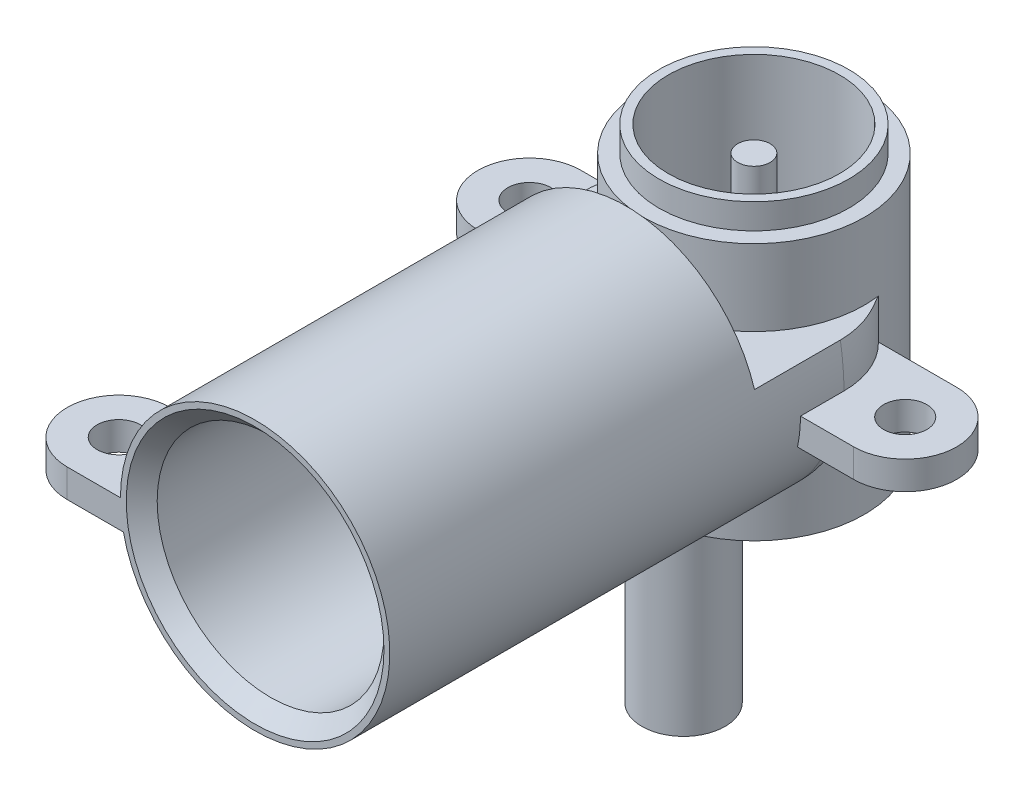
ISO-10303-21;
HEADER;
FILE_DESCRIPTION(('STEP AP214'),'2;1');
FILE_NAME('part.step','',(''),(''),'','','');
FILE_SCHEMA(('AUTOMOTIVE_DESIGN { 1 0 10303 214 1 1 1 1 }'));
ENDSEC;
DATA;
#1=APPLICATION_CONTEXT('core data for automotive mechanical design processes');
#2=APPLICATION_PROTOCOL_DEFINITION('international standard','automotive_design',2000,#1);
#3=PRODUCT_CONTEXT('',#1,'mechanical');
#4=PRODUCT('Part','Part','',(#3));
#5=PRODUCT_RELATED_PRODUCT_CATEGORY('part','',(#4));
#6=PRODUCT_DEFINITION_FORMATION('','',#4);
#7=PRODUCT_DEFINITION_CONTEXT('part definition',#1,'design');
#8=PRODUCT_DEFINITION('design','',#6,#7);
#9=PRODUCT_DEFINITION_SHAPE('','',#8);
#10=(LENGTH_UNIT() NAMED_UNIT(*) SI_UNIT(.MILLI.,.METRE.));
#11=(NAMED_UNIT(*) PLANE_ANGLE_UNIT() SI_UNIT($,.RADIAN.));
#12=(NAMED_UNIT(*) SI_UNIT($,.STERADIAN.) SOLID_ANGLE_UNIT());
#13=UNCERTAINTY_MEASURE_WITH_UNIT(LENGTH_MEASURE(1.E-05),#10,'distance_accuracy_value','');
#14=(GEOMETRIC_REPRESENTATION_CONTEXT(3) GLOBAL_UNCERTAINTY_ASSIGNED_CONTEXT((#13)) GLOBAL_UNIT_ASSIGNED_CONTEXT((#10,
#11,#12)) REPRESENTATION_CONTEXT('',''));
#15=CARTESIAN_POINT('',(0.,0.,0.));
#16=DIRECTION('',(0.,0.,1.));
#17=DIRECTION('',(1.,0.,0.));
#18=AXIS2_PLACEMENT_3D('',#15,#16,#17);
#19=CARTESIAN_POINT('',(-2.,-21.5,-6.96393202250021));
#20=DIRECTION('',(0.,1.,0.));
#21=DIRECTION('',(0.,0.,1.));
#22=AXIS2_PLACEMENT_3D('',#19,#20,#21);
#23=CYLINDRICAL_SURFACE('',#22,1.6);
#24=CARTESIAN_POINT('',(-2.,-21.5,-6.96393202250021));
#25=DIRECTION('',(0.,-1.,0.));
#26=DIRECTION('',(0.,0.,-1.));
#27=AXIS2_PLACEMENT_3D('',#24,#25,#26);
#28=CIRCLE('',#27,1.6);
#29=CARTESIAN_POINT('',(-2.,-21.5,-8.56393202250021));
#30=VERTEX_POINT('',#29);
#31=EDGE_CURVE('E541',#30,#30,#28,.T.);
#32=ORIENTED_EDGE('',*,*,#31,.T.);
#33=EDGE_LOOP('',(#32));
#34=FACE_BOUND('',#33,.T.);
#35=CARTESIAN_POINT('',(-2.,-16.5,-6.96393202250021));
#36=DIRECTION('',(0.,-1.,0.));
#37=DIRECTION('',(0.,0.,-1.));
#38=AXIS2_PLACEMENT_3D('',#35,#36,#37);
#39=CIRCLE('',#38,1.6);
#40=CARTESIAN_POINT('',(-1.31460865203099,-16.5,-5.51816623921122));
#41=VERTEX_POINT('',#40);
#42=CARTESIAN_POINT('',(-2.42392411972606,-16.5,-5.42111371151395));
#43=VERTEX_POINT('',#42);
#44=EDGE_CURVE('E509',#41,#43,#39,.T.);
#45=ORIENTED_EDGE('',*,*,#44,.F.);
#46=CARTESIAN_POINT('',(-2.,-15.,-6.96393202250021));
#47=DIRECTION('',(-0.0616284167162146,-0.707106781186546,-0.704416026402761));
#48=DIRECTION('',(-0.0616284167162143,0.707106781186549,-0.704416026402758));
#49=AXIS2_PLACEMENT_3D('',#46,#47,#48);
#50=ELLIPSE('',#49,2.26274169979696,1.6);
#51=CARTESIAN_POINT('',(-0.442337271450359,-15.5,-6.59829993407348));
#52=VERTEX_POINT('',#51);
#53=EDGE_CURVE('E43',#41,#52,#50,.F.);
#54=ORIENTED_EDGE('',*,*,#53,.T.);
#55=DIRECTION('',(0.,-1.,0.));
#56=VECTOR('',#55,1.);
#57=CARTESIAN_POINT('',(-0.442337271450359,8.5,-6.59829993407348));
#58=LINE('',#57,#56);
#59=CARTESIAN_POINT('',(-0.442337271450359,-7.5,-6.59829993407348));
#60=VERTEX_POINT('',#59);
#61=EDGE_CURVE('E506',#60,#52,#58,.T.);
#62=ORIENTED_EDGE('',*,*,#61,.F.);
#63=CARTESIAN_POINT('',(-2.,-7.5,-6.96393202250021));
#64=DIRECTION('',(0.,-1.,0.));
#65=DIRECTION('',(0.,0.,-1.));
#66=AXIS2_PLACEMENT_3D('',#63,#64,#65);
#67=CIRCLE('',#66,1.6);
#68=CARTESIAN_POINT('',(-3.47050698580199,-7.5,-6.3333694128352));
#69=VERTEX_POINT('',#68);
#70=EDGE_CURVE('E502',#69,#60,#67,.T.);
#71=ORIENTED_EDGE('',*,*,#70,.F.);
#72=DIRECTION('',(0.,-1.,0.));
#73=VECTOR('',#72,1.);
#74=CARTESIAN_POINT('',(-3.47050698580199,8.5,-6.33336941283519));
#75=LINE('',#74,#73);
#76=CARTESIAN_POINT('',(-3.47050698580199,-15.5,-6.33336941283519));
#77=VERTEX_POINT('',#76);
#78=EDGE_CURVE('E508',#69,#77,#75,.T.);
#79=ORIENTED_EDGE('',*,*,#78,.T.);
#80=CARTESIAN_POINT('',(-2.,-15.,-6.96393202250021));
#81=DIRECTION('',(-0.0616284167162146,-0.707106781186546,-0.704416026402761));
#82=DIRECTION('',(-0.0616284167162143,0.707106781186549,-0.704416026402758));
#83=AXIS2_PLACEMENT_3D('',#80,#81,#82);
#84=ELLIPSE('',#83,2.26274169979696,1.6);
#85=EDGE_CURVE('E11',#77,#43,#84,.F.);
#86=ORIENTED_EDGE('',*,*,#85,.T.);
#87=EDGE_LOOP('',(#45,#54,#62,#71,#79,#86));
#88=FACE_BOUND('',#87,.T.);
#89=ADVANCED_FACE('F35',(#34,#88),#23,.F.);
#90=CARTESIAN_POINT('',(0.,-7.5,-9.2));
#91=DIRECTION('',(0.,-1.,0.));
#92=DIRECTION('',(0.,0.,-1.));
#93=AXIS2_PLACEMENT_3D('',#90,#91,#92);
#94=PLANE('',#93);
#95=DIRECTION('',(-0.996194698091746,0.,0.0871557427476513));
#96=VECTOR('',#95,1.);
#97=CARTESIAN_POINT('',(0.222530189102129,-7.5,-6.65646829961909));
#98=LINE('',#97,#96);
#99=EDGE_CURVE('E496',#60,#69,#98,.T.);
#100=ORIENTED_EDGE('',*,*,#99,.T.);
#101=ORIENTED_EDGE('',*,*,#70,.T.);
#102=EDGE_LOOP('',(#100,#101));
#103=FACE_BOUND('',#102,.T.);
#104=CARTESIAN_POINT('',(0.,-7.5,-9.2));
#105=DIRECTION('',(0.,-1.,0.));
#106=DIRECTION('',(0.,0.,-1.));
#107=AXIS2_PLACEMENT_3D('',#104,#105,#106);
#108=CIRCLE('',#107,5.15);
#109=CARTESIAN_POINT('',(0.,-7.5,-14.35));
#110=VERTEX_POINT('',#109);
#111=EDGE_CURVE('E628',#110,#110,#108,.F.);
#112=ORIENTED_EDGE('',*,*,#111,.T.);
#113=EDGE_LOOP('',(#112));
#114=FACE_BOUND('',#113,.T.);
#115=CARTESIAN_POINT('',(0.,-7.5,-9.2));
#116=DIRECTION('',(0.,-1.,0.));
#117=DIRECTION('',(0.,0.,-1.));
#118=AXIS2_PLACEMENT_3D('',#115,#116,#117);
#119=CIRCLE('',#118,1.25);
#120=CARTESIAN_POINT('',(0.,-7.5,-10.45));
#121=VERTEX_POINT('',#120);
#122=EDGE_CURVE('E493',#121,#121,#119,.F.);
#123=ORIENTED_EDGE('',*,*,#122,.F.);
#124=EDGE_LOOP('',(#123));
#125=FACE_BOUND('',#124,.T.);
#126=ADVANCED_FACE('F301',(#103,#114,#125),#94,.F.);
#127=CARTESIAN_POINT('',(0.,-8.5,-9.2));
#128=DIRECTION('',(0.,1.,0.));
#129=DIRECTION('',(0.,0.,1.));
#130=AXIS2_PLACEMENT_3D('',#127,#128,#129);
#131=CYLINDRICAL_SURFACE('',#130,6.65);
#132=CARTESIAN_POINT('',(0.,-8.1,-2.55));
#133=CARTESIAN_POINT('',(0.158555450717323,-8.09999984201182,-2.55000016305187));
#134=CARTESIAN_POINT('',(0.317112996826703,-8.09533499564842,-2.55567980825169));
#135=CARTESIAN_POINT('',(0.63294121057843,-8.07678289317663,-2.57829603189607));
#136=CARTESIAN_POINT('',(0.790211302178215,-8.06289171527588,-2.59523739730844));
#137=CARTESIAN_POINT('',(1.10232063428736,-8.02618292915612,-2.64010070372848));
#138=CARTESIAN_POINT('',(1.25715649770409,-8.00335389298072,-2.66803670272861));
#139=CARTESIAN_POINT('',(1.56311539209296,-7.9492655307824,-2.7344225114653));
#140=CARTESIAN_POINT('',(1.71423669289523,-7.91800235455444,-2.77287712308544));
#141=CARTESIAN_POINT('',(2.01071468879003,-7.84793365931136,-2.85940035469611));
#142=CARTESIAN_POINT('',(2.15610388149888,-7.80918149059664,-2.90740103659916));
#143=CARTESIAN_POINT('',(2.44148481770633,-7.72472266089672,-3.0125277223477));
#144=CARTESIAN_POINT('',(2.58147417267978,-7.67901296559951,-3.06965770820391));
#145=CARTESIAN_POINT('',(2.9923243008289,-7.53261688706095,-3.25370711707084));
#146=CARTESIAN_POINT('',(3.25433890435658,-7.42259712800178,-3.39336699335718));
#147=CARTESIAN_POINT('',(3.67190581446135,-7.22235811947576,-3.6520873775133));
#148=CARTESIAN_POINT('',(3.83475384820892,-7.1370206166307,-3.76350390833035));
#149=CARTESIAN_POINT('',(4.14773903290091,-6.95978070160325,-3.99836620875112));
#150=CARTESIAN_POINT('',(4.29787647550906,-6.86787844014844,-4.12181170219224));
#151=CARTESIAN_POINT('',(4.58561902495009,-6.67920641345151,-4.38003149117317));
#152=CARTESIAN_POINT('',(4.72318820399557,-6.58242385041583,-4.51483626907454));
#153=CARTESIAN_POINT('',(4.98528014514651,-6.38621687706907,-4.7947488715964));
#154=CARTESIAN_POINT('',(5.10980449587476,-6.28679279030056,-4.93985543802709));
#155=CARTESIAN_POINT('',(5.34782474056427,-6.08567655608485,-5.24260222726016));
#156=CARTESIAN_POINT('',(5.46109136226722,-5.98397502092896,-5.40041644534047));
#157=CARTESIAN_POINT('',(5.67395706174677,-5.78253238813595,-5.72629704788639));
#158=CARTESIAN_POINT('',(5.77355161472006,-5.68279194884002,-5.89436679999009));
#159=CARTESIAN_POINT('',(5.95839457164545,-5.48866448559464,-6.24053631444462));
#160=CARTESIAN_POINT('',(6.04367882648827,-5.39426448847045,-6.41860947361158));
#161=CARTESIAN_POINT('',(6.19934328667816,-5.21461903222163,-6.78539115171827));
#162=CARTESIAN_POINT('',(6.26973631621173,-5.12936572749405,-6.97409034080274));
#163=CARTESIAN_POINT('',(6.40152729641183,-4.96415744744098,-7.38492043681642));
#164=CARTESIAN_POINT('',(6.46098513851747,-4.88591427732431,-7.60841028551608));
#165=CARTESIAN_POINT('',(6.53301599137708,-4.78866789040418,-7.95262927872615));
#166=CARTESIAN_POINT('',(6.5541583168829,-4.75961854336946,-8.06878350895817));
#167=CARTESIAN_POINT('',(6.59038703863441,-4.70932687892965,-8.30367428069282));
#168=CARTESIAN_POINT('',(6.60547657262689,-4.68808051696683,-8.42240945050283));
#169=CARTESIAN_POINT('',(6.62940900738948,-4.65417851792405,-8.66313039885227));
#170=CARTESIAN_POINT('',(6.63817897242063,-4.64162325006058,-8.78513778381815));
#171=CARTESIAN_POINT('',(6.64895800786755,-4.62616995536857,-9.03006236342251));
#172=CARTESIAN_POINT('',(6.65096757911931,-4.62327121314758,-9.15297948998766));
#173=CARTESIAN_POINT('',(6.64816845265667,-4.62729529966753,-9.39861473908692));
#174=CARTESIAN_POINT('',(6.64335742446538,-4.63422148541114,-9.52133277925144));
#175=CARTESIAN_POINT('',(6.62704850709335,-4.65751282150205,-9.76541770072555));
#176=CARTESIAN_POINT('',(6.61554973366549,-4.67387922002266,-9.88678440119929));
#177=CARTESIAN_POINT('',(6.58448411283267,-4.71755912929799,-10.1408811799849));
#178=CARTESIAN_POINT('',(6.56415007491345,-4.7459037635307,-10.2733387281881));
#179=CARTESIAN_POINT('',(6.51605035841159,-4.81172965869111,-10.5346389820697));
#180=CARTESIAN_POINT('',(6.48827928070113,-4.84921755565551,-10.6634789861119));
#181=CARTESIAN_POINT('',(6.42576254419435,-4.93176009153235,-10.9173265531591));
#182=CARTESIAN_POINT('',(6.39099916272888,-4.97683390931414,-11.0423234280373));
#183=CARTESIAN_POINT('',(6.31502490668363,-5.07289008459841,-11.2879376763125));
#184=CARTESIAN_POINT('',(6.27381545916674,-5.12387113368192,-11.4085560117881));
#185=CARTESIAN_POINT('',(6.16076915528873,-5.25989287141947,-11.7111938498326));
#186=CARTESIAN_POINT('',(6.08462103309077,-5.34814305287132,-11.8901691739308));
#187=CARTESIAN_POINT('',(5.9185966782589,-5.53132222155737,-12.2380735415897));
#188=CARTESIAN_POINT('',(5.8287130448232,-5.62625479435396,-12.4069971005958));
#189=CARTESIAN_POINT('',(5.63564706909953,-5.81963736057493,-12.7352908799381));
#190=CARTESIAN_POINT('',(5.53244764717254,-5.91809175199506,-12.8946484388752));
#191=CARTESIAN_POINT('',(5.31312428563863,-6.11575922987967,-13.2036351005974));
#192=CARTESIAN_POINT('',(5.19700276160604,-6.2149721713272,-13.3532660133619));
#193=CARTESIAN_POINT('',(4.94684402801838,-6.41603787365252,-13.6486194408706));
#194=CARTESIAN_POINT('',(4.81226482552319,-6.51783033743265,-13.7939250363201));
#195=CARTESIAN_POINT('',(4.52919112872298,-6.71762207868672,-14.073239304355));
#196=CARTESIAN_POINT('',(4.38069453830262,-6.81562078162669,-14.2072462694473));
#197=CARTESIAN_POINT('',(4.07022157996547,-7.0054506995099,-14.4627107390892));
#198=CARTESIAN_POINT('',(3.90827377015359,-7.09729426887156,-14.5841936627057));
#199=CARTESIAN_POINT('',(3.57094318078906,-7.27285930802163,-14.8135931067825));
#200=CARTESIAN_POINT('',(3.39556570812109,-7.35658395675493,-14.9215149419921));
#201=CARTESIAN_POINT('',(3.08052749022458,-7.49275940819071,-15.0954244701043));
#202=CARTESIAN_POINT('',(2.94382107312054,-7.54759441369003,-15.1649181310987));
#203=CARTESIAN_POINT('',(2.66394337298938,-7.65085872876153,-15.2950560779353));
#204=CARTESIAN_POINT('',(2.52077367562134,-7.69928959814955,-15.3557025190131));
#205=CARTESIAN_POINT('',(2.22859639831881,-7.78888278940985,-15.4674003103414));
#206=CARTESIAN_POINT('',(2.0795913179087,-7.83004818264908,-15.5184557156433));
#207=CARTESIAN_POINT('',(1.77647099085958,-7.9043340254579,-15.6102827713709));
#208=CARTESIAN_POINT('',(1.62235564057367,-7.93745431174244,-15.6510542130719));
#209=CARTESIAN_POINT('',(1.30897006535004,-7.99513275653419,-15.7218918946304));
#210=CARTESIAN_POINT('',(1.14967210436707,-8.01963172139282,-15.7518841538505));
#211=CARTESIAN_POINT('',(0.828151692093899,-8.0591808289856,-15.8002340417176));
#212=CARTESIAN_POINT('',(0.665929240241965,-8.07423096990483,-15.8185916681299));
#213=CARTESIAN_POINT('',(0.34001472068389,-8.09450666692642,-15.8433115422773));
#214=CARTESIAN_POINT('',(0.176323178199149,-8.09973560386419,-15.8496779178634));
#215=CARTESIAN_POINT('',(-0.151090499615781,-8.10024474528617,-15.8502981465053));
#216=CARTESIAN_POINT('',(-0.314812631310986,-8.09552576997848,-15.8445529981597));
#217=CARTESIAN_POINT('',(-0.623759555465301,-8.07727146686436,-15.8222993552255));
#218=CARTESIAN_POINT('',(-0.769130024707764,-8.06470861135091,-15.8069779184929));
#219=CARTESIAN_POINT('',(-1.05774994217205,-8.03195283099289,-15.766955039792));
#220=CARTESIAN_POINT('',(-1.20099866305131,-8.01175734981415,-15.7422504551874));
#221=CARTESIAN_POINT('',(-1.48437406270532,-7.96412363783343,-15.6838300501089));
#222=CARTESIAN_POINT('',(-1.62450159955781,-7.9366874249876,-15.6501167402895));
#223=CARTESIAN_POINT('',(-1.90091902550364,-7.87506166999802,-15.574134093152));
#224=CARTESIAN_POINT('',(-2.0372074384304,-7.84086956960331,-15.5318615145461));
#225=CARTESIAN_POINT('',(-2.44821315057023,-7.72649425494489,-15.3898680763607));
#226=CARTESIAN_POINT('',(-2.71568461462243,-7.63612810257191,-15.2769309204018));
#227=CARTESIAN_POINT('',(-3.22728024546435,-7.43441166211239,-15.0214374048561));
#228=CARTESIAN_POINT('',(-3.47139742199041,-7.32305512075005,-14.8788722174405));
#229=CARTESIAN_POINT('',(-3.87114214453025,-7.11758763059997,-14.6108942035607));
#230=CARTESIAN_POINT('',(-4.03271488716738,-7.02708605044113,-14.4914492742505));
#231=CARTESIAN_POINT('',(-4.34244117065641,-6.84002471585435,-14.2403831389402));
#232=CARTESIAN_POINT('',(-4.49058948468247,-6.7434626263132,-14.1087572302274));
#233=CARTESIAN_POINT('',(-4.77377623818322,-6.54606438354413,-13.8338591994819));
#234=CARTESIAN_POINT('',(-4.90876605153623,-6.44521421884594,-13.6905472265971));
#235=CARTESIAN_POINT('',(-5.16498382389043,-6.24176979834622,-13.3933207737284));
#236=CARTESIAN_POINT('',(-5.2862138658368,-6.13917580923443,-13.2394079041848));
#237=CARTESIAN_POINT('',(-5.51679076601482,-5.93290343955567,-12.9184978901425));
#238=CARTESIAN_POINT('',(-5.62589989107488,-5.829236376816,-12.7513224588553));
#239=CARTESIAN_POINT('',(-5.8295687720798,-5.62555466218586,-12.4060614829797));
#240=CARTESIAN_POINT('',(-5.92412178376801,-5.52554171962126,-12.2279709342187));
#241=CARTESIAN_POINT('',(-6.09760890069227,-5.33346337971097,-11.8613165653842));
#242=CARTESIAN_POINT('',(-6.17660850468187,-5.24136561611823,-11.6728011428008));
#243=CARTESIAN_POINT('',(-6.31824522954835,-5.06972696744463,-11.2844601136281));
#244=CARTESIAN_POINT('',(-6.38090292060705,-4.9901703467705,-11.0846491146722));
#245=CARTESIAN_POINT('',(-6.49046882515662,-4.84689273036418,-10.6646578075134));
#246=CARTESIAN_POINT('',(-6.53658873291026,-4.78399464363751,-10.4439717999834));
#247=CARTESIAN_POINT('',(-6.58898218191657,-4.71128354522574,-10.1059944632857));
#248=CARTESIAN_POINT('',(-6.6036444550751,-4.69065951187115,-9.99226062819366));
#249=CARTESIAN_POINT('',(-6.62712019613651,-4.65743477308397,-9.76304995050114));
#250=CARTESIAN_POINT('',(-6.63593635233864,-4.64483037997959,-9.64757393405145));
#251=CARTESIAN_POINT('',(-6.64755556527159,-4.62818652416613,-9.41487845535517));
#252=CARTESIAN_POINT('',(-6.65031580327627,-4.62420805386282,-9.2976524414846));
#253=CARTESIAN_POINT('',(-6.64962675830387,-4.62519883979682,-9.06325972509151));
#254=CARTESIAN_POINT('',(-6.64617763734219,-4.63016786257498,-8.94609302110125));
#255=CARTESIAN_POINT('',(-6.63315148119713,-4.64880935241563,-8.71267949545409));
#256=CARTESIAN_POINT('',(-6.62356780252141,-4.66249125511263,-8.59643380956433));
#257=CARTESIAN_POINT('',(-6.59848876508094,-4.69791579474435,-8.36578312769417));
#258=CARTESIAN_POINT('',(-6.58299017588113,-4.71966283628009,-8.25137917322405));
#259=CARTESIAN_POINT('',(-6.54171494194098,-4.77676695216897,-7.99618720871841));
#260=CARTESIAN_POINT('',(-6.51432440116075,-4.81418131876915,-7.85612102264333));
#261=CARTESIAN_POINT('',(-6.45137193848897,-4.89821892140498,-7.58065126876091));
#262=CARTESIAN_POINT('',(-6.41580569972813,-4.94484702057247,-7.44525020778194));
#263=CARTESIAN_POINT('',(-6.33701548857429,-5.04542583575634,-7.17909728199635));
#264=CARTESIAN_POINT('',(-6.29377202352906,-5.09939510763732,-7.04835829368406));
#265=CARTESIAN_POINT('',(-6.20019227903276,-5.21277517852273,-6.7919425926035));
#266=CARTESIAN_POINT('',(-6.14985701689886,-5.27218519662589,-6.66626515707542));
#267=CARTESIAN_POINT('',(-6.01402635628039,-5.42743051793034,-6.35460693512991));
#268=CARTESIAN_POINT('',(-5.92401780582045,-5.52590843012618,-6.17189814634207));
#269=CARTESIAN_POINT('',(-5.72904907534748,-5.72780350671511,-5.81748314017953));
#270=CARTESIAN_POINT('',(-5.6240817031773,-5.83122303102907,-5.645782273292));
#271=CARTESIAN_POINT('',(-5.39947355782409,-6.03980175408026,-5.31303304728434));
#272=CARTESIAN_POINT('',(-5.27981638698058,-6.14496278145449,-5.15199690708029));
#273=CARTESIAN_POINT('',(-5.02609747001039,-6.35416277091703,-4.84097391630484));
#274=CARTESIAN_POINT('',(-4.89203833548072,-6.45820193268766,-4.69098507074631));
#275=CARTESIAN_POINT('',(-4.60643980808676,-6.66501900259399,-4.39939988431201));
#276=CARTESIAN_POINT('',(-4.4545815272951,-6.76771920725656,-4.25805974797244));
#277=CARTESIAN_POINT('',(-4.13589679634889,-6.96704260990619,-3.98843434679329));
#278=CARTESIAN_POINT('',(-3.96906766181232,-7.06366471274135,-3.860151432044));
#279=CARTESIAN_POINT('',(-3.62117978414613,-7.24815361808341,-3.61839518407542));
#280=CARTESIAN_POINT('',(-3.44015740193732,-7.33604156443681,-3.50488586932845));
#281=CARTESIAN_POINT('',(-3.06422599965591,-7.50083804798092,-3.2941229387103));
#282=CARTESIAN_POINT('',(-2.86932543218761,-7.57775318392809,-3.19685954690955));
#283=CARTESIAN_POINT('',(-2.53247598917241,-7.69527327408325,-3.04930787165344));
#284=CARTESIAN_POINT('',(-2.39396273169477,-7.73954398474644,-2.99403905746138));
#285=CARTESIAN_POINT('',(-2.11175814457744,-7.82125546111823,-2.89242909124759));
#286=CARTESIAN_POINT('',(-1.96806821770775,-7.85869806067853,-2.84608554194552));
#287=CARTESIAN_POINT('',(-1.67650876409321,-7.92601158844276,-2.76301696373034));
#288=CARTESIAN_POINT('',(-1.52864786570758,-7.95589703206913,-2.72627349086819));
#289=CARTESIAN_POINT('',(-1.22944311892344,-8.00759049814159,-2.66284897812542));
#290=CARTESIAN_POINT('',(-1.07810057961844,-8.02940150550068,-2.6361642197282));
#291=CARTESIAN_POINT('',(-0.77295143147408,-8.06449816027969,-2.59327746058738));
#292=CARTESIAN_POINT('',(-0.619144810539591,-8.07778376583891,-2.57707551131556));
#293=CARTESIAN_POINT('',(-0.310226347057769,-8.09553590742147,-2.55543530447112));
#294=CARTESIAN_POINT('',(-0.155114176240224,-8.10000015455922,-2.54999984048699));
#295=CARTESIAN_POINT('',(0.,-8.1,-2.55));
#296=B_SPLINE_CURVE_WITH_KNOTS('',3,(#132,#133,#134,#135,#136,#137,#138,#139,#140,#141,#142,
#143,#144,#145,#146,#147,#148,#149,#150,#151,#152,#153,#154,#155,#156,#157,#158,#159,#160,#161,
#162,#163,#164,#165,#166,#167,#168,#169,#170,#171,#172,#173,#174,#175,#176,#177,#178,#179,#180,
#181,#182,#183,#184,#185,#186,#187,#188,#189,#190,#191,#192,#193,#194,#195,#196,#197,#198,#199,
#200,#201,#202,#203,#204,#205,#206,#207,#208,#209,#210,#211,#212,#213,#214,#215,#216,#217,#218,
#219,#220,#221,#222,#223,#224,#225,#226,#227,#228,#229,#230,#231,#232,#233,#234,#235,#236,#237,
#238,#239,#240,#241,#242,#243,#244,#245,#246,#247,#248,#249,#250,#251,#252,#253,#254,#255,#256,
#257,#258,#259,#260,#261,#262,#263,#264,#265,#266,#267,#268,#269,#270,#271,#272,#273,#274,#275,
#276,#277,#278,#279,#280,#281,#282,#283,#284,#285,#286,#287,#288,#289,#290,#291,#292,#293,#294,
#295),.UNSPECIFIED.,.T.,.F.,(4,2,2,2,2,2,2,2,2,2,2,2,2,2,2,2,2,2,2,2,2,2,2,2,2,2,2,2,2,2,2,2,2,
2,2,2,2,2,2,2,2,2,2,2,2,2,2,2,2,2,2,2,2,2,2,2,2,2,2,2,2,2,2,2,2,2,2,2,2,2,2,2,2,2,2,2,2,2,2,2,2,
4),(0.,0.475501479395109,0.951205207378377,1.4275191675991,1.90405093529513,2.37730541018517,
2.85076687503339,3.79682537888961,4.44104638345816,5.08525260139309,5.73124622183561,
6.37716108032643,7.03430123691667,7.69165835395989,8.34734320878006,9.00246107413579,
9.73225823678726,10.096656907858,10.4608664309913,10.829214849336,11.1975359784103,
11.5659829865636,11.9344787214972,12.3447713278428,12.7553626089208,13.1670079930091,
13.5785623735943,14.2183496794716,14.8584829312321,15.499445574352,16.1402886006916,
16.8076094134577,17.4750308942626,18.1410699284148,18.806847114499,19.2949973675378,
19.783028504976,20.2708528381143,20.7586870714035,21.2498082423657,21.7409295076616,
22.231881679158,22.7227933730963,23.1624232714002,23.602200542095,24.0418553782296,
24.4816770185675,25.390171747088,26.29893755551,26.9592325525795,27.61978354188,
28.2826897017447,28.9454953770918,29.6195970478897,30.2940101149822,30.965519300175,
31.63617910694,32.3355256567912,32.6847027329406,33.0337191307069,33.3851954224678,
33.7366625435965,34.0885109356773,34.4405517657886,34.8824800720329,35.3246422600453,
35.7679435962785,36.2111814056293,36.8889089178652,37.5669633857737,38.2457817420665,
38.9244772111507,39.618057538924,40.3117624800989,41.0037449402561,41.69530949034,
42.1615675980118,42.6277002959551,43.0929307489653,43.5579890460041,44.0230496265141,
44.4882308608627),.UNSPECIFIED.);
#297=CARTESIAN_POINT('',(-5.8832389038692,-5.56753985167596,-6.1));
#298=VERTEX_POINT('',#297);
#299=CARTESIAN_POINT('',(5.8832389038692,-5.56753985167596,-6.1));
#300=VERTEX_POINT('',#299);
#301=EDGE_CURVE('E348',#298,#300,#296,.T.);
#302=ORIENTED_EDGE('',*,*,#301,.F.);
#303=CARTESIAN_POINT('',(-5.8832389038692,-5.56753985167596,-6.1));
#304=CARTESIAN_POINT('',(-5.94190313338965,-5.50559919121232,-6.2112751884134));
#305=CARTESIAN_POINT('',(-5.99635599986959,-5.43929457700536,-6.32232992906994));
#306=CARTESIAN_POINT('',(-6.09716681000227,-5.29804829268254,-6.54262661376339));
#307=CARTESIAN_POINT('',(-6.14352388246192,-5.22310569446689,-6.65186836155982));
#308=CARTESIAN_POINT('',(-6.22829498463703,-5.06499251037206,-6.86672836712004));
#309=CARTESIAN_POINT('',(-6.26673889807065,-4.98185470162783,-6.97235895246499));
#310=CARTESIAN_POINT('',(-6.33641832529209,-4.80738875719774,-7.17906151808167));
#311=CARTESIAN_POINT('',(-6.36765619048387,-4.71606330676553,-7.28013497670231));
#312=CARTESIAN_POINT('',(-6.43000630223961,-4.50368981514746,-7.49903893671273));
#313=CARTESIAN_POINT('',(-6.45944883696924,-4.38062684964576,-7.61540067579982));
#314=CARTESIAN_POINT('',(-6.50988017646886,-4.12361634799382,-7.83731159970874));
#315=CARTESIAN_POINT('',(-6.5308718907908,-3.98967257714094,-7.9428644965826));
#316=CARTESIAN_POINT('',(-6.56586921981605,-3.71326813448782,-8.14080805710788));
#317=CARTESIAN_POINT('',(-6.57993182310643,-3.57088810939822,-8.23330146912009));
#318=CARTESIAN_POINT('',(-6.60290626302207,-3.277987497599,-8.40522755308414));
#319=CARTESIAN_POINT('',(-6.61181557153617,-3.12746295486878,-8.48465380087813));
#320=CARTESIAN_POINT('',(-6.62595519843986,-2.81935297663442,-8.63026832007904));
#321=CARTESIAN_POINT('',(-6.63117245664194,-2.66174455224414,-8.69640901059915));
#322=CARTESIAN_POINT('',(-6.63912770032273,-2.34152090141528,-8.81525898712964));
#323=CARTESIAN_POINT('',(-6.64186568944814,-2.17890568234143,-8.86796829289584));
#324=CARTESIAN_POINT('',(-6.64627639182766,-1.81474732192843,-8.97043809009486));
#325=CARTESIAN_POINT('',(-6.64759438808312,-1.61233941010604,-9.01713815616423));
#326=CARTESIAN_POINT('',(-6.64924291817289,-1.20422609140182,-9.09283143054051));
#327=CARTESIAN_POINT('',(-6.64957311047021,-0.998519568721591,-9.12181851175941));
#328=CARTESIAN_POINT('',(-6.64992991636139,-0.585504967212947,-9.16320652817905));
#329=CARTESIAN_POINT('',(-6.64995657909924,-0.378197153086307,-9.17561014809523));
#330=CARTESIAN_POINT('',(-6.6499833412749,0.0367317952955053,-9.1844134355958));
#331=CARTESIAN_POINT('',(-6.64998344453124,0.244352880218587,-9.18081540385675));
#332=CARTESIAN_POINT('',(-6.64988419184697,0.617490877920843,-9.15976462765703));
#333=CARTESIAN_POINT('',(-6.64980459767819,0.78317531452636,-9.14520737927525));
#334=CARTESIAN_POINT('',(-6.64935515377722,1.11318567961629,-9.10529373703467));
#335=CARTESIAN_POINT('',(-6.64898542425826,1.27751214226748,-9.07994181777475));
#336=CARTESIAN_POINT('',(-6.64758273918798,1.60340754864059,-9.01794105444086));
#337=CARTESIAN_POINT('',(-6.64655227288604,1.76498451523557,-8.98133487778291));
#338=CARTESIAN_POINT('',(-6.64317828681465,2.08509384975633,-8.89611241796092));
#339=CARTESIAN_POINT('',(-6.64083339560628,2.24362285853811,-8.8474836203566));
#340=CARTESIAN_POINT('',(-6.63750526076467,2.4,-8.79253967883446));
#341=B_SPLINE_CURVE_WITH_KNOTS('',3,(#303,#304,#305,#306,#307,#308,#309,#310,#311,#312,#313,
#314,#315,#316,#317,#318,#319,#320,#321,#322,#323,#324,#325,#326,#327,#328,#329,#330,#331,#332,
#333,#334,#335,#336,#337,#338,#339,#340),.UNSPECIFIED.,.F.,.F.,(4,2,2,2,2,2,2,2,2,2,2,2,2,2,2,2,
2,2,4),(0.,0.420504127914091,0.841053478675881,1.25998426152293,1.67877814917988,
2.19355705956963,2.7081585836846,3.21845401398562,3.72899957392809,4.24134222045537,
4.75368411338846,5.37597817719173,5.99848737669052,6.62089578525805,7.2432147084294,
7.74185816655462,8.24029512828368,8.73686523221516,9.23395441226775),.UNSPECIFIED.);
#342=CARTESIAN_POINT('',(-6.64682391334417,-1.69999999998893,-8.99449607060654));
#343=VERTEX_POINT('',#342);
#344=EDGE_CURVE('E376',#298,#343,#341,.T.);
#345=ORIENTED_EDGE('',*,*,#344,.T.);
#346=CARTESIAN_POINT('',(0.,-1.7,-9.2));
#347=DIRECTION('',(0.,1.,0.));
#348=DIRECTION('',(0.,0.,1.));
#349=AXIS2_PLACEMENT_3D('',#346,#347,#348);
#350=CIRCLE('',#349,6.65);
#351=CARTESIAN_POINT('',(-6.58881628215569,-1.7,-10.1));
#352=VERTEX_POINT('',#351);
#353=EDGE_CURVE('E480',#352,#343,#350,.T.);
#354=ORIENTED_EDGE('',*,*,#353,.F.);
#355=DIRECTION('',(0.,1.,0.));
#356=VECTOR('',#355,1.);
#357=CARTESIAN_POINT('',(-6.58881628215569,-8.5,-10.1));
#358=LINE('',#357,#356);
#359=CARTESIAN_POINT('',(-6.58881628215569,0.,-10.1));
#360=VERTEX_POINT('',#359);
#361=EDGE_CURVE('E557',#352,#360,#358,.T.);
#362=ORIENTED_EDGE('',*,*,#361,.T.);
#363=CARTESIAN_POINT('',(-6.58881628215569,2.4,-10.1));
#364=VERTEX_POINT('',#363);
#365=EDGE_CURVE('E553',#360,#364,#358,.T.);
#366=ORIENTED_EDGE('',*,*,#365,.T.);
#367=CARTESIAN_POINT('',(0.,2.4,-9.2));
#368=DIRECTION('',(0.,-1.,0.));
#369=DIRECTION('',(1.,0.,0.));
#370=AXIS2_PLACEMENT_3D('',#367,#368,#369);
#371=CIRCLE('',#370,6.65);
#372=CARTESIAN_POINT('',(6.58881628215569,2.4,-10.1));
#373=VERTEX_POINT('',#372);
#374=EDGE_CURVE('E563',#373,#364,#371,.T.);
#375=ORIENTED_EDGE('',*,*,#374,.F.);
#376=DIRECTION('',(0.,1.,0.));
#377=VECTOR('',#376,1.);
#378=CARTESIAN_POINT('',(6.58881628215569,-8.5,-10.1));
#379=LINE('',#378,#377);
#380=CARTESIAN_POINT('',(6.58881628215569,0.,-10.1));
#381=VERTEX_POINT('',#380);
#382=EDGE_CURVE('E556',#381,#373,#379,.T.);
#383=ORIENTED_EDGE('',*,*,#382,.F.);
#384=CARTESIAN_POINT('',(6.58881628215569,-1.7,-10.1));
#385=VERTEX_POINT('',#384);
#386=EDGE_CURVE('E479',#385,#381,#379,.T.);
#387=ORIENTED_EDGE('',*,*,#386,.F.);
#388=CARTESIAN_POINT('',(0.,-1.7,-9.2));
#389=DIRECTION('',(0.,1.,0.));
#390=DIRECTION('',(0.,0.,1.));
#391=AXIS2_PLACEMENT_3D('',#388,#389,#390);
#392=CIRCLE('',#391,6.65);
#393=CARTESIAN_POINT('',(6.64682391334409,-1.7,-8.99449607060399));
#394=VERTEX_POINT('',#393);
#395=EDGE_CURVE('E406',#385,#394,#392,.F.);
#396=ORIENTED_EDGE('',*,*,#395,.T.);
#397=CARTESIAN_POINT('',(6.63750526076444,2.4,-8.79253967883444));
#398=CARTESIAN_POINT('',(6.639222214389,2.32027166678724,-8.82054869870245));
#399=CARTESIAN_POINT('',(6.64066601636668,2.23997647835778,-8.84692213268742));
#400=CARTESIAN_POINT('',(6.64311614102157,2.07841222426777,-8.89647175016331));
#401=CARTESIAN_POINT('',(6.64412253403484,1.99714331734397,-8.91964844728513));
#402=CARTESIAN_POINT('',(6.64664749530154,1.7522668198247,-8.98445672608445));
#403=CARTESIAN_POINT('',(6.64767532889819,1.58740344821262,-9.02143122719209));
#404=CARTESIAN_POINT('',(6.64905596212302,1.25502239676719,-9.08371805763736));
#405=CARTESIAN_POINT('',(6.64940676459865,1.08749832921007,-9.10899571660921));
#406=CARTESIAN_POINT('',(6.64982849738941,0.751088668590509,-9.14838080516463));
#407=CARTESIAN_POINT('',(6.64989931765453,0.582202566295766,-9.16248384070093));
#408=CARTESIAN_POINT('',(6.64998243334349,0.215471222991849,-9.18139018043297));
#409=CARTESIAN_POINT('',(6.64998290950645,0.0175235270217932,-9.18423508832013));
#410=CARTESIAN_POINT('',(6.64995575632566,-0.378055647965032,-9.17537269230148));
#411=CARTESIAN_POINT('',(6.64992812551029,-0.575687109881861,-9.16366462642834));
#412=CARTESIAN_POINT('',(6.64960750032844,-0.969577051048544,-9.12519518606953));
#413=CARTESIAN_POINT('',(6.64931440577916,-1.16583498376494,-9.09842812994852));
#414=CARTESIAN_POINT('',(6.64788958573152,-1.55549667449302,-9.02887055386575));
#415=CARTESIAN_POINT('',(6.64675801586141,-1.74890095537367,-8.98608300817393));
#416=CARTESIAN_POINT('',(6.64286867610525,-2.11123149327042,-8.88869979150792));
#417=CARTESIAN_POINT('',(6.64029223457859,-2.28061190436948,-8.83579456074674));
#418=CARTESIAN_POINT('',(6.63260515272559,-2.6141497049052,-8.71556243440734));
#419=CARTESIAN_POINT('',(6.62749462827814,-2.77830733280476,-8.64823619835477));
#420=CARTESIAN_POINT('',(6.61338573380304,-3.09925712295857,-8.4991316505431));
#421=CARTESIAN_POINT('',(6.60439754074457,-3.25606738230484,-8.41739149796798));
#422=CARTESIAN_POINT('',(6.58091238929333,-3.56100219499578,-8.23973671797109));
#423=CARTESIAN_POINT('',(6.56641679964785,-3.709128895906,-8.14382561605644));
#424=CARTESIAN_POINT('',(6.53377315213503,-3.96660885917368,-7.9593381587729));
#425=CARTESIAN_POINT('',(6.51692623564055,-4.07781151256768,-7.87310121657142));
#426=CARTESIAN_POINT('',(6.4776746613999,-4.29290578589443,-7.69311199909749));
#427=CARTESIAN_POINT('',(6.45527073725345,-4.39679836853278,-7.59936071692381));
#428=CARTESIAN_POINT('',(6.40405894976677,-4.59671602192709,-7.40540144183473));
#429=CARTESIAN_POINT('',(6.37525013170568,-4.69273991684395,-7.30519248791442));
#430=CARTESIAN_POINT('',(6.31050959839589,-4.87643750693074,-7.09962290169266));
#431=CARTESIAN_POINT('',(6.27457975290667,-4.96411338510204,-6.99426362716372));
#432=CARTESIAN_POINT('',(6.1874928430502,-5.14653236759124,-6.75953385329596));
#433=CARTESIAN_POINT('',(6.13474343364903,-5.23951229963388,-6.62936884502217));
#434=CARTESIAN_POINT('',(6.04697230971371,-5.36957160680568,-6.43200113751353));
#435=CARTESIAN_POINT('',(6.01629159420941,-5.41133774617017,-6.36589211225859));
#436=CARTESIAN_POINT('',(5.95198698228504,-5.49176474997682,-6.23321934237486));
#437=CARTESIAN_POINT('',(5.91836311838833,-5.53042564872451,-6.16665560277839));
#438=CARTESIAN_POINT('',(5.88323890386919,-5.56753985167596,-6.1));
#439=B_SPLINE_CURVE_WITH_KNOTS('',3,(#397,#398,#399,#400,#401,#402,#403,#404,#405,#406,#407,
#408,#409,#410,#411,#412,#413,#414,#415,#416,#417,#418,#419,#420,#421,#422,#423,#424,#425,#426,
#427,#428,#429,#430,#431,#432,#433,#434,#435,#436,#437,#438),.UNSPECIFIED.,.F.,.F.,(4,2,2,2,2,2,
2,2,2,2,2,2,2,2,2,2,2,2,2,2,4),(0.,0.253526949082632,0.507013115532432,1.01339615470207,
1.52127068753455,2.02934482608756,2.62270293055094,3.21609210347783,3.80970530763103,
4.40320835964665,4.93499841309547,5.46676415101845,5.99714267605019,6.52738947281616,
6.95210250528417,7.37675949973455,7.80147983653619,8.22608880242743,8.73040929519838,
8.98231781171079,9.2342235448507),.UNSPECIFIED.);
#440=EDGE_CURVE('E370',#394,#300,#439,.T.);
#441=ORIENTED_EDGE('',*,*,#440,.T.);
#442=EDGE_LOOP('',(#302,#345,#354,#362,#366,#375,#383,#387,#396,#441));
#443=FACE_BOUND('',#442,.T.);
#444=CARTESIAN_POINT('',(0.,-8.5,-9.2));
#445=DIRECTION('',(0.,1.,0.));
#446=DIRECTION('',(0.,0.,1.));
#447=AXIS2_PLACEMENT_3D('',#444,#445,#446);
#448=CIRCLE('',#447,6.65);
#449=CARTESIAN_POINT('',(0.,-8.5,-2.55));
#450=VERTEX_POINT('',#449);
#451=EDGE_CURVE('E561',#450,#450,#448,.T.);
#452=ORIENTED_EDGE('',*,*,#451,.T.);
#453=EDGE_LOOP('',(#452));
#454=FACE_BOUND('',#453,.T.);
#455=CARTESIAN_POINT('',(0.,6.98,-9.2));
#456=DIRECTION('',(0.,1.,0.));
#457=DIRECTION('',(0.,0.,1.));
#458=AXIS2_PLACEMENT_3D('',#455,#456,#457);
#459=CIRCLE('',#458,6.65);
#460=CARTESIAN_POINT('',(0.,6.98,-2.55));
#461=VERTEX_POINT('',#460);
#462=EDGE_CURVE('E542',#461,#461,#459,.T.);
#463=ORIENTED_EDGE('',*,*,#462,.F.);
#464=EDGE_LOOP('',(#463));
#465=FACE_BOUND('',#464,.T.);
#466=ADVANCED_FACE('F307',(#443,#454,#465),#131,.T.);
#467=CARTESIAN_POINT('',(0.,-8.5,-9.2));
#468=DIRECTION('',(0.,1.,0.));
#469=DIRECTION('',(0.,0.,1.));
#470=AXIS2_PLACEMENT_3D('',#467,#468,#469);
#471=PLANE('',#470);
#472=ORIENTED_EDGE('',*,*,#451,.F.);
#473=EDGE_LOOP('',(#472));
#474=FACE_BOUND('',#473,.T.);
#475=CARTESIAN_POINT('',(-2.,-8.5,-6.96393202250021));
#476=DIRECTION('',(0.,1.,0.));
#477=DIRECTION('',(0.,0.,1.));
#478=AXIS2_PLACEMENT_3D('',#475,#476,#477);
#479=CIRCLE('',#478,2.5);
#480=CARTESIAN_POINT('',(-2.,-8.5,-4.46393202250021));
#481=VERTEX_POINT('',#480);
#482=EDGE_CURVE('E482',#481,#481,#479,.F.);
#483=ORIENTED_EDGE('',*,*,#482,.F.);
#484=EDGE_LOOP('',(#483));
#485=FACE_BOUND('',#484,.T.);
#486=ADVANCED_FACE('F334',(#474,#485),#471,.F.);
#487=CARTESIAN_POINT('',(0.,0.,-15.851));
#488=DIRECTION('',(0.,0.,1.));
#489=DIRECTION('',(1.,0.,0.));
#490=AXIS2_PLACEMENT_3D('',#487,#488,#489);
#491=CYLINDRICAL_SURFACE('',#490,8.1);
#492=ORIENTED_EDGE('',*,*,#301,.T.);
#493=CARTESIAN_POINT('',(0.,0.,-6.1));
#494=DIRECTION('',(0.,0.,-1.));
#495=DIRECTION('',(-1.,0.,0.));
#496=AXIS2_PLACEMENT_3D('',#493,#494,#495);
#497=CIRCLE('',#496,8.1);
#498=CARTESIAN_POINT('',(7.91959594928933,-1.7,-6.10000000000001));
#499=VERTEX_POINT('',#498);
#500=EDGE_CURVE('E459',#300,#499,#497,.F.);
#501=ORIENTED_EDGE('',*,*,#500,.T.);
#502=DIRECTION('',(0.,0.,1.));
#503=VECTOR('',#502,1.);
#504=CARTESIAN_POINT('',(7.91959594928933,-1.7,-15.851));
#505=LINE('',#504,#503);
#506=CARTESIAN_POINT('',(7.91959594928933,-1.7,-3.9));
#507=VERTEX_POINT('',#506);
#508=EDGE_CURVE('E474',#507,#499,#505,.F.);
#509=ORIENTED_EDGE('',*,*,#508,.F.);
#510=CARTESIAN_POINT('',(0.,0.,-3.9));
#511=DIRECTION('',(0.,0.,-1.));
#512=DIRECTION('',(-1.,0.,0.));
#513=AXIS2_PLACEMENT_3D('',#510,#511,#512);
#514=CIRCLE('',#513,8.1);
#515=CARTESIAN_POINT('',(8.1,0.,-3.9));
#516=VERTEX_POINT('',#515);
#517=EDGE_CURVE('E1081',#516,#507,#514,.T.);
#518=ORIENTED_EDGE('',*,*,#517,.F.);
#519=DIRECTION('',(0.,0.,1.));
#520=VECTOR('',#519,1.);
#521=CARTESIAN_POINT('',(8.1,0.,-15.851));
#522=LINE('',#521,#520);
#523=CARTESIAN_POINT('',(8.1,0.,-6.51835778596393));
#524=VERTEX_POINT('',#523);
#525=EDGE_CURVE('E1082',#516,#524,#522,.F.);
#526=ORIENTED_EDGE('',*,*,#525,.T.);
#527=CARTESIAN_POINT('',(6.58881628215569,-2.66189083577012,-10.1));
#528=CARTESIAN_POINT('',(6.58881628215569,-5.50044397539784,-10.1));
#529=CARTESIAN_POINT('',(4.15142318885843,-6.95526315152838,-10.1));
#530=CARTESIAN_POINT('',(6.58881628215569,-2.66188700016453,-10.1));
#531=CARTESIAN_POINT('',(6.58882110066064,-5.50043874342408,-10.077675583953));
#532=CARTESIAN_POINT('',(4.15142215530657,-6.95525312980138,-10.0341169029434));
#533=CARTESIAN_POINT('',(6.58881628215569,-2.66111393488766,-10.1));
#534=CARTESIAN_POINT('',(6.58969836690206,-5.49830055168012,-10.0553579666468));
#535=CARTESIAN_POINT('',(4.15482662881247,-6.95323318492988,-9.96824349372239));
#536=CARTESIAN_POINT('',(6.58881628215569,-2.6579988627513,-10.1));
#537=CARTESIAN_POINT('',(6.59323376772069,-5.48972442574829,-10.0106138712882));
#538=CARTESIAN_POINT('',(4.16842435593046,-6.94509380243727,-9.83663319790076));
#539=CARTESIAN_POINT('',(6.58881628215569,-2.65565677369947,-10.1));
#540=CARTESIAN_POINT('',(6.59589066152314,-5.48328949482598,-9.98819580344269));
#541=CARTESIAN_POINT('',(4.17861796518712,-6.93897415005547,-9.77089631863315));
#542=CARTESIAN_POINT('',(6.58881628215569,-2.64622485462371,-10.1));
#543=CARTESIAN_POINT('',(6.60658100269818,-5.45749780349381,-9.92060148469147));
#544=CARTESIAN_POINT('',(4.21937672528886,-6.91432945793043,-9.57394069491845));
#545=CARTESIAN_POINT('',(6.58881628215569,-2.63672925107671,-10.1));
#546=CARTESIAN_POINT('',(6.61732528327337,-5.43167539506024,-9.87513085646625));
#547=CARTESIAN_POINT('',(4.26011973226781,-6.88951836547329,-9.44311392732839));
#548=CARTESIAN_POINT('',(6.58881628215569,-2.61064841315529,-10.1));
#549=CARTESIAN_POINT('',(6.64673303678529,-5.36205941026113,-9.78248184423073));
#550=CARTESIAN_POINT('',(4.36840822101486,-6.82137166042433,-9.18293049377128));
#551=CARTESIAN_POINT('',(6.58881628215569,-2.59401674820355,-10.1));
#552=CARTESIAN_POINT('',(6.66540668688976,-5.31824462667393,-9.73535783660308));
#553=CARTESIAN_POINT('',(4.43612902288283,-6.77791472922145,-9.05358925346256));
#554=CARTESIAN_POINT('',(6.58881628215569,-2.55264900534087,-10.1));
#555=CARTESIAN_POINT('',(6.71145279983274,-5.21188911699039,-9.63959308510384));
#556=CARTESIAN_POINT('',(4.59704876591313,-6.66982482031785,-8.79863190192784));
#557=CARTESIAN_POINT('',(6.58881628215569,-2.52791897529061,-10.1));
#558=CARTESIAN_POINT('',(6.73876035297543,-5.14949181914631,-9.59100851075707));
#559=CARTESIAN_POINT('',(4.69022868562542,-6.60520764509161,-8.6730130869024));
#560=CARTESIAN_POINT('',(6.58881628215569,-2.47805076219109,-10.1));
#561=CARTESIAN_POINT('',(6.7929419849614,-5.02697588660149,-9.50785659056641));
#562=CARTESIAN_POINT('',(4.86760931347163,-6.47490683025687,-8.4648007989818));
#563=CARTESIAN_POINT('',(6.58881628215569,-2.45537486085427,-10.1));
#564=CARTESIAN_POINT('',(6.81731468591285,-4.97217307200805,-9.47362871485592));
#565=CARTESIAN_POINT('',(4.94576534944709,-6.41565689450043,-8.38085156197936));
#566=CARTESIAN_POINT('',(6.58881628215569,-2.40493978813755,-10.1));
#567=CARTESIAN_POINT('',(6.87065219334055,-4.8525341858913,-9.405031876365));
#568=CARTESIAN_POINT('',(5.11216144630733,-6.28387493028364,-8.2159871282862));
#569=CARTESIAN_POINT('',(6.58881628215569,-2.37718102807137,-10.1));
#570=CARTESIAN_POINT('',(6.89959595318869,-4.78774435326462,-9.37066904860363));
#571=CARTESIAN_POINT('',(5.20040069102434,-6.21134397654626,-8.13507168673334));
#572=CARTESIAN_POINT('',(6.58881628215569,-2.31612680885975,-10.1));
#573=CARTESIAN_POINT('',(6.96190069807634,-4.64780609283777,-9.30239902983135));
#574=CARTESIAN_POINT('',(5.38519929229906,-6.05181521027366,-7.97718189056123));
#575=CARTESIAN_POINT('',(6.58881628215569,-2.28285161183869,-10.1));
#576=CARTESIAN_POINT('',(6.99522834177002,-4.57273568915,-9.26849037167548));
#577=CARTESIAN_POINT('',(5.48172759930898,-5.96487034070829,-7.90019441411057));
#578=CARTESIAN_POINT('',(6.58881628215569,-2.21014329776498,-10.1));
#579=CARTESIAN_POINT('',(7.06607348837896,-4.41145156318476,-9.20158914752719));
#580=CARTESIAN_POINT('',(5.68151629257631,-5.77489055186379,-7.75052116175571));
#581=CARTESIAN_POINT('',(6.58881628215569,-2.17071134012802,-10.1));
#582=CARTESIAN_POINT('',(7.10358005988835,-4.32526868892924,-9.16858880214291));
#583=CARTESIAN_POINT('',(5.78477540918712,-5.67185866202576,-7.67783457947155));
#584=CARTESIAN_POINT('',(6.58881628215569,-2.09329187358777,-10.1));
#585=CARTESIAN_POINT('',(7.17474527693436,-4.15854365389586,-9.11023110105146));
#586=CARTESIAN_POINT('',(5.97572777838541,-5.46956908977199,-7.55073487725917));
#587=CARTESIAN_POINT('',(6.58881628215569,-2.05643974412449,-10.1));
#588=CARTESIAN_POINT('',(7.20777264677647,-4.08006454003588,-9.08461456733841));
#589=CARTESIAN_POINT('',(6.06267475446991,-5.37327804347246,-7.49546439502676));
#590=CARTESIAN_POINT('',(6.58881628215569,-1.97817652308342,-10.1));
#591=CARTESIAN_POINT('',(7.27565031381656,-3.91516700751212,-9.03477152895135));
#592=CARTESIAN_POINT('',(6.23793221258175,-5.16878381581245,-7.3885953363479));
#593=CARTESIAN_POINT('',(6.58881628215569,-1.93676636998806,-10.1));
#594=CARTESIAN_POINT('',(7.31050370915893,-3.82875045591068,-9.01053544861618));
#595=CARTESIAN_POINT('',(6.32624241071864,-5.06058308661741,-7.33699600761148));
#596=CARTESIAN_POINT('',(6.58881628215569,-1.84924765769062,-10.1));
#597=CARTESIAN_POINT('',(7.38137902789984,-3.64777330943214,-8.96377862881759));
#598=CARTESIAN_POINT('',(6.50257968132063,-4.83190516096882,-7.23780349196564));
#599=CARTESIAN_POINT('',(6.58881628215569,-1.80313680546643,-10.1));
#600=CARTESIAN_POINT('',(7.41740905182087,-3.55320088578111,-8.94124827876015));
#601=CARTESIAN_POINT('',(6.59060659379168,-4.71142197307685,-7.19021228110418));
#602=CARTESIAN_POINT('',(6.58881628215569,-1.70625215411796,-10.1));
#603=CARTESIAN_POINT('',(7.489762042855,-3.35598796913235,-8.8982283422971));
#604=CARTESIAN_POINT('',(6.76441930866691,-4.45827175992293,-7.09942500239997));
#605=CARTESIAN_POINT('',(6.58881628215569,-1.65548067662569,-10.1));
#606=CARTESIAN_POINT('',(7.52609551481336,-3.25333624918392,-8.87772720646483));
#607=CARTESIAN_POINT('',(6.85020619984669,-4.32561080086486,-7.05622676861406));
#608=CARTESIAN_POINT('',(6.58881628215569,-1.54900282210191,-10.1));
#609=CARTESIAN_POINT('',(7.59834687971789,-3.03934654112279,-8.83885844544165));
#610=CARTESIAN_POINT('',(7.01820336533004,-4.04739446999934,-6.97420453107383));
#611=CARTESIAN_POINT('',(6.58881628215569,-1.49326437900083,-10.1));
#612=CARTESIAN_POINT('',(7.63427331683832,-2.92792950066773,-8.82049657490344));
#613=CARTESIAN_POINT('',(7.10038438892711,-3.90175531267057,-6.93541327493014));
#614=CARTESIAN_POINT('',(6.58881628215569,-1.37744817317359,-10.1));
#615=CARTESIAN_POINT('',(7.70433695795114,-2.69748611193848,-8.78625140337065));
#616=CARTESIAN_POINT('',(7.25846611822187,-3.59913877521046,-6.86281140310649));
#617=CARTESIAN_POINT('',(6.58881628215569,-1.31737242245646,-10.1));
#618=CARTESIAN_POINT('',(7.73848821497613,-2.57843685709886,-8.77035846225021));
#619=CARTESIAN_POINT('',(7.3343697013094,-3.44216665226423,-6.82899849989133));
#620=CARTESIAN_POINT('',(6.58881628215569,-1.19324094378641,-10.1));
#621=CARTESIAN_POINT('',(7.8038880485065,-2.33327219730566,-8.74112873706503));
#622=CARTESIAN_POINT('',(7.47800803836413,-3.11782311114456,-6.76649877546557));
#623=CARTESIAN_POINT('',(6.58881628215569,-1.12918514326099,-10.1));
#624=CARTESIAN_POINT('',(7.83514871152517,-2.20712850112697,-8.72778535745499));
#625=CARTESIAN_POINT('',(7.54574264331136,-2.95045150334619,-6.73781204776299));
#626=CARTESIAN_POINT('',(6.58881628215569,-0.997639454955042,-10.1));
#627=CARTESIAN_POINT('',(7.89366306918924,-1.94867202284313,-8.70367444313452));
#628=CARTESIAN_POINT('',(7.67127658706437,-2.60673535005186,-6.68567634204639));
#629=CARTESIAN_POINT('',(6.58881628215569,-0.93014996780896,-10.1));
#630=CARTESIAN_POINT('',(7.92092717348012,-1.81633276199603,-8.69290186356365));
#631=CARTESIAN_POINT('',(7.72907708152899,-2.43039185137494,-6.66222675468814));
#632=CARTESIAN_POINT('',(6.58881628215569,-0.739346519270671,-10.1));
#633=CARTESIAN_POINT('',(7.9894251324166,-1.44281024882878,-8.66660013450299));
#634=CARTESIAN_POINT('',(7.8732054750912,-1.93184090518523,-6.60462917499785));
#635=CARTESIAN_POINT('',(6.58881628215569,-0.612907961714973,-10.1));
#636=CARTESIAN_POINT('',(8.02539353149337,-1.1957513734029,-8.65373606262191));
#637=CARTESIAN_POINT('',(7.94742379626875,-1.601469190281,-6.57606505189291));
#638=CARTESIAN_POINT('',(6.58881628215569,-0.354978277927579,-10.1));
#639=CARTESIAN_POINT('',(8.07729215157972,-0.692300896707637,-8.63556433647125));
#640=CARTESIAN_POINT('',(8.0539572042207,-0.927523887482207,-6.53548937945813));
#641=CARTESIAN_POINT('',(6.58881628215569,-0.223488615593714,-10.1));
#642=CARTESIAN_POINT('',(8.09324485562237,-0.435823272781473,-8.63024845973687));
#643=CARTESIAN_POINT('',(8.08628433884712,-0.583954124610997,-6.52347307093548));
#644=CARTESIAN_POINT('',(6.58881628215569,0.0340339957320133,-10.1));
#645=CARTESIAN_POINT('',(8.10303326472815,0.0663655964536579,-8.62696395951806));
#646=CARTESIAN_POINT('',(8.10615923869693,0.0889275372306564,-6.51606058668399));
#647=CARTESIAN_POINT('',(6.58881628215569,0.160021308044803,-10.1));
#648=CARTESIAN_POINT('',(8.09790912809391,0.312047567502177,-8.62864983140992));
#649=CARTESIAN_POINT('',(8.09580840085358,0.418120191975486,-6.51988450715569));
#650=CARTESIAN_POINT('',(6.58881628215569,0.40923365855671,-10.1));
#651=CARTESIAN_POINT('',(8.06844389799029,0.798161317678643,-8.63867843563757));
#652=CARTESIAN_POINT('',(8.03576365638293,1.06928794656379,-6.54243443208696));
#653=CARTESIAN_POINT('',(6.58881628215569,0.532459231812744,-10.1));
#654=CARTESIAN_POINT('',(8.04409930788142,1.03865531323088,-8.64702235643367));
#655=CARTESIAN_POINT('',(7.98607743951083,1.3912644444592,-6.56115752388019));
#656=CARTESIAN_POINT('',(6.58881628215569,0.77214718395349,-10.1));
#657=CARTESIAN_POINT('',(7.97899952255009,1.50696995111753,-8.67062433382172));
#658=CARTESIAN_POINT('',(7.85122075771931,2.01754586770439,-6.61344428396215));
#659=CARTESIAN_POINT('',(6.58881628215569,0.888637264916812,-10.1));
#660=CARTESIAN_POINT('',(7.93829579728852,1.73493464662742,-8.68585993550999));
#661=CARTESIAN_POINT('',(7.76620947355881,2.32192317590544,-6.64694141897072));
#662=CARTESIAN_POINT('',(6.58881628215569,1.11238892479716,-10.1));
#663=CARTESIAN_POINT('',(7.84475950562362,2.17400091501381,-8.72350996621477));
#664=CARTESIAN_POINT('',(7.56685660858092,2.90656460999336,-6.72866492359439));
#665=CARTESIAN_POINT('',(6.58881628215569,1.2196498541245,-10.1));
#666=CARTESIAN_POINT('',(7.79188321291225,2.38522504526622,-8.74594456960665));
#667=CARTESIAN_POINT('',(7.45251296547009,3.18682703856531,-6.77689232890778));
#668=CARTESIAN_POINT('',(6.58881628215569,1.42504542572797,-10.1));
#669=CARTESIAN_POINT('',(7.67783825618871,2.79186502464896,-8.79853569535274));
#670=CARTESIAN_POINT('',(7.19970032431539,3.72350578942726,-6.88895340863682));
#671=CARTESIAN_POINT('',(6.58881628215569,1.52289210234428,-10.1));
#672=CARTESIAN_POINT('',(7.61643705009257,2.98689781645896,-8.82890358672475));
#673=CARTESIAN_POINT('',(7.06070890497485,3.97916968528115,-6.95314047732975));
#674=CARTESIAN_POINT('',(6.58881628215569,1.70485302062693,-10.1));
#675=CARTESIAN_POINT('',(7.49204753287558,3.35289034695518,-8.89629715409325));
#676=CARTESIAN_POINT('',(6.77082245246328,4.45461595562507,-7.09533718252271));
#677=CARTESIAN_POINT('',(6.58881628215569,1.78897103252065,-10.1));
#678=CARTESIAN_POINT('',(7.42899486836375,3.52396750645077,-8.93337220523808));
#679=CARTESIAN_POINT('',(6.61993070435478,4.67440818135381,-7.17334301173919));
#680=CARTESIAN_POINT('',(6.58881628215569,1.9496446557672,-10.1));
#681=CARTESIAN_POINT('',(7.30085032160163,3.85513103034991,-9.01612633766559));
#682=CARTESIAN_POINT('',(6.30346334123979,5.09423281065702,-7.3486172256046));
#683=CARTESIAN_POINT('',(6.58881628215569,2.02498112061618,-10.1));
#684=CARTESIAN_POINT('',(7.23599782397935,4.01310889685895,-9.06231849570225));
#685=CARTESIAN_POINT('',(6.1377142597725,5.29107970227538,-7.44695050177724));
#686=CARTESIAN_POINT('',(6.58881628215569,2.16025945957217,-10.1));
#687=CARTESIAN_POINT('',(7.11393002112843,4.30217113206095,-9.15875000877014));
#688=CARTESIAN_POINT('',(5.8143578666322,5.64454891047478,-7.65581440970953));
#689=CARTESIAN_POINT('',(6.58881628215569,2.22015962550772,-10.1));
#690=CARTESIAN_POINT('',(7.05673208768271,4.43314699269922,-9.20905274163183));
#691=CARTESIAN_POINT('',(5.65677351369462,5.80106224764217,-7.76637695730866));
#692=CARTESIAN_POINT('',(6.58881628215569,2.31148949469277,-10.1));
#693=CARTESIAN_POINT('',(6.96666864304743,4.63719691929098,-9.29722646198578));
#694=CARTESIAN_POINT('',(5.39942506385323,6.03969835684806,-7.96530506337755));
#695=CARTESIAN_POINT('',(6.58881628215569,2.34622164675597,-10.1));
#696=CARTESIAN_POINT('',(6.93140308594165,4.71635824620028,-9.33477929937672));
#697=CARTESIAN_POINT('',(5.29565812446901,6.13045010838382,-8.05143976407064));
#698=CARTESIAN_POINT('',(6.58881628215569,2.40914391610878,-10.1));
#699=CARTESIAN_POINT('',(6.86631254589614,4.8623081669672,-9.41010532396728));
#700=CARTESIAN_POINT('',(5.09913244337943,6.29485990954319,-8.22792011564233));
#701=CARTESIAN_POINT('',(6.58881628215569,2.43732928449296,-10.1));
#702=CARTESIAN_POINT('',(6.83651611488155,4.92903191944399,-9.44787627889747));
#703=CARTESIAN_POINT('',(5.00638171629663,6.36850555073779,-8.31826876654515));
#704=CARTESIAN_POINT('',(6.58881628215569,2.48774302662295,-10.1));
#705=CARTESIAN_POINT('',(6.78251461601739,5.05048545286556,-9.52286761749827));
#706=CARTESIAN_POINT('',(4.8341263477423,6.50023177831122,-8.50187346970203));
#707=CARTESIAN_POINT('',(6.58881628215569,2.50999900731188,-10.1));
#708=CARTESIAN_POINT('',(6.7583114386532,5.10521044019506,-9.56007865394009));
#709=CARTESIAN_POINT('',(4.75456099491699,6.55838449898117,-8.5951137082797));
#710=CARTESIAN_POINT('',(6.58881628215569,2.54934197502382,-10.1));
#711=CARTESIAN_POINT('',(6.71510369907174,5.20356488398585,-9.63379810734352));
#712=CARTESIAN_POINT('',(4.60935983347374,6.66118386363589,-8.78408940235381));
#713=CARTESIAN_POINT('',(6.58881628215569,2.5664363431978,-10.1));
#714=CARTESIAN_POINT('',(6.69611922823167,5.2471501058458,-9.67028883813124));
#715=CARTESIAN_POINT('',(4.54370417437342,6.70584979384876,-8.87982108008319));
#716=CARTESIAN_POINT('',(6.58881628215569,2.58128700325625,-10.1));
#717=CARTESIAN_POINT('',(6.67961349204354,5.28546610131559,-9.70624183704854));
#718=CARTESIAN_POINT('',(4.48549373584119,6.74465313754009,-8.97652551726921));
#719=(BOUNDED_SURFACE() B_SPLINE_SURFACE(3,2,((#527,#528,#529),(#530,#531,#532),(#533,#534,
#535),(#536,#537,#538),(#539,#540,#541),(#542,#543,#544),(#545,#546,#547),(#548,#549,#550),
(#551,#552,#553),(#554,#555,#556),(#557,#558,#559),(#560,#561,#562),(#563,#564,#565),(#566,#567,
#568),(#569,#570,#571),(#572,#573,#574),(#575,#576,#577),(#578,#579,#580),(#581,#582,#583),
(#584,#585,#586),(#587,#588,#589),(#590,#591,#592),(#593,#594,#595),(#596,#597,#598),(#599,#600,
#601),(#602,#603,#604),(#605,#606,#607),(#608,#609,#610),(#611,#612,#613),(#614,#615,#616),
(#617,#618,#619),(#620,#621,#622),(#623,#624,#625),(#626,#627,#628),(#629,#630,#631),(#632,#633,
#634),(#635,#636,#637),(#638,#639,#640),(#641,#642,#643),(#644,#645,#646),(#647,#648,#649),
(#650,#651,#652),(#653,#654,#655),(#656,#657,#658),(#659,#660,#661),(#662,#663,#664),(#665,#666,
#667),(#668,#669,#670),(#671,#672,#673),(#674,#675,#676),(#677,#678,#679),(#680,#681,#682),
(#683,#684,#685),(#686,#687,#688),(#689,#690,#691),(#692,#693,#694),(#695,#696,#697),(#698,#699,
#700),(#701,#702,#703),(#704,#705,#706),(#707,#708,#709),(#710,#711,#712),(#713,#714,#715),
(#716,#717,#718)),.UNSPECIFIED.,.F.,.F.,.F.) B_SPLINE_SURFACE_WITH_KNOTS((4,2,2,2,2,2,2,2,2,2,2,
2,2,2,2,2,2,2,2,2,2,2,2,2,2,2,2,2,2,2,2,4),(3,3),(0.,0.197612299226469,0.39523495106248,
0.790889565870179,1.18915849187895,1.58713066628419,1.86276728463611,2.13838160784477,
2.41300514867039,2.6875770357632,2.91025827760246,3.13289375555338,3.35563836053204,
3.57827260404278,3.80246579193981,4.02655564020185,4.25064957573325,4.47471742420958,
4.87059575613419,5.26636020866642,5.64287648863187,6.01931918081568,6.39408364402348,
6.76887446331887,7.15284735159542,7.53671461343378,7.9526560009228,8.36970973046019,
8.67235790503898,8.97522493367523,9.27665615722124,9.57765426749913),(0.,1.),
.UNSPECIFIED.) GEOMETRIC_REPRESENTATION_ITEM() RATIONAL_B_SPLINE_SURFACE(((1.,0.869632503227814,
1.),(1.,0.869632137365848,1.),(1.,0.869714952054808,1.),(1.,0.870043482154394,1.),(1.,
0.870289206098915,1.),(1.,0.871266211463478,1.),(1.,0.872237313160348,1.),(1.,0.874752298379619,
1.),(1.,0.876299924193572,1.),(1.,0.879842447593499,1.),(1.,0.881837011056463,1.),(1.,
0.885451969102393,1.),(1.,0.88699890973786,1.),(1.,0.89016551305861,1.),(1.,0.891785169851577,
1.),(1.,0.895024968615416,1.),(1.,0.896645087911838,1.),(1.,0.899825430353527,1.),(1.,
0.901385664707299,1.),(1.,0.904101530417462,1.),(1.,0.905277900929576,1.),(1.,0.907523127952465,
1.),(1.,0.908592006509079,1.),(1.,0.910601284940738,1.),(1.,0.911541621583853,1.),(1.,
0.913279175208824,1.),(1.,0.914076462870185,1.),(1.,0.915529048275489,1.),(1.,0.916183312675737,
1.),(1.,0.917347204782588,1.),(1.,0.917856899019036,1.),(1.,0.918745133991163,1.),(1.,
0.919123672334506,1.),(1.,0.9197684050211,1.),(1.,0.920034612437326,1.),(1.,0.920646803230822,
1.),(1.,0.920897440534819,1.),(1.,0.921229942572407,1.),(1.,0.921311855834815,1.),(1.,
0.921363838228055,1.),(1.,0.921339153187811,1.),(1.,0.921172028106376,1.),(1.,0.921029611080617,
1.),(1.,0.920552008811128,1.),(1.,0.920217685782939,1.),(1.,0.919253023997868,1.),(1.,
0.918622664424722,1.),(1.,0.916955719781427,1.),(1.,0.915909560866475,1.),(1.,0.91337535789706,
1.),(1.,0.911887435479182,1.),(1.,0.908371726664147,1.),(1.,0.90630921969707,1.),(1.,
0.901862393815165,1.),(1.,0.899477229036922,1.),(1.,0.895275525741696,1.),(1.,0.893482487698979,
1.),(1.,0.889930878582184,1.),(1.,0.888172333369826,1.),(1.,0.884786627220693,1.),(1.,
0.883158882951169,1.),(1.,0.880103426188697,1.),(1.,0.878675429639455,1.),(1.,0.877383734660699,1.))) REPRESENTATION_ITEM('') SURFACE());
#720=CARTESIAN_POINT('',(4.15142318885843,-6.95526315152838,-10.1));
#721=CARTESIAN_POINT('',(4.15142215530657,-6.95525312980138,-10.0341169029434));
#722=CARTESIAN_POINT('',(4.15482662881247,-6.95323318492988,-9.96824349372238));
#723=CARTESIAN_POINT('',(4.16842435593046,-6.94509380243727,-9.83663319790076));
#724=CARTESIAN_POINT('',(4.17861796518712,-6.93897415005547,-9.77089631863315));
#725=CARTESIAN_POINT('',(4.21937672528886,-6.91432945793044,-9.57394069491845));
#726=CARTESIAN_POINT('',(4.26011973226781,-6.88951836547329,-9.44311392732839));
#727=CARTESIAN_POINT('',(4.36840822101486,-6.82137166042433,-9.18293049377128));
#728=CARTESIAN_POINT('',(4.43612902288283,-6.77791472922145,-9.05358925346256));
#729=CARTESIAN_POINT('',(4.59704876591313,-6.66982482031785,-8.79863190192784));
#730=CARTESIAN_POINT('',(4.69022868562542,-6.60520764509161,-8.6730130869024));
#731=CARTESIAN_POINT('',(4.86760931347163,-6.47490683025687,-8.4648007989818));
#732=CARTESIAN_POINT('',(4.94576534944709,-6.41565689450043,-8.38085156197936));
#733=CARTESIAN_POINT('',(5.11216144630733,-6.28387493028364,-8.2159871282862));
#734=CARTESIAN_POINT('',(5.20040069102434,-6.21134397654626,-8.13507168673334));
#735=CARTESIAN_POINT('',(5.38519929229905,-6.05181521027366,-7.97718189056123));
#736=CARTESIAN_POINT('',(5.48172759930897,-5.96487034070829,-7.90019441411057));
#737=CARTESIAN_POINT('',(5.68151629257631,-5.77489055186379,-7.75052116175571));
#738=CARTESIAN_POINT('',(5.78477540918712,-5.67185866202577,-7.67783457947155));
#739=CARTESIAN_POINT('',(5.97572777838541,-5.46956908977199,-7.55073487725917));
#740=CARTESIAN_POINT('',(6.06267475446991,-5.37327804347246,-7.49546439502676));
#741=CARTESIAN_POINT('',(6.23793221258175,-5.16878381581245,-7.3885953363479));
#742=CARTESIAN_POINT('',(6.32624241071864,-5.06058308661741,-7.33699600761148));
#743=CARTESIAN_POINT('',(6.50257968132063,-4.83190516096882,-7.23780349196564));
#744=CARTESIAN_POINT('',(6.59060659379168,-4.71142197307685,-7.19021228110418));
#745=CARTESIAN_POINT('',(6.76441930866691,-4.45827175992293,-7.09942500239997));
#746=CARTESIAN_POINT('',(6.85020619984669,-4.32561080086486,-7.05622676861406));
#747=CARTESIAN_POINT('',(7.01820336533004,-4.04739446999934,-6.97420453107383));
#748=CARTESIAN_POINT('',(7.10038438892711,-3.90175531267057,-6.93541327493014));
#749=CARTESIAN_POINT('',(7.25846611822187,-3.59913877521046,-6.86281140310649));
#750=CARTESIAN_POINT('',(7.3343697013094,-3.44216665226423,-6.82899849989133));
#751=CARTESIAN_POINT('',(7.47800803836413,-3.11782311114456,-6.76649877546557));
#752=CARTESIAN_POINT('',(7.54574264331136,-2.95045150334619,-6.73781204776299));
#753=CARTESIAN_POINT('',(7.67127658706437,-2.60673535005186,-6.68567634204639));
#754=CARTESIAN_POINT('',(7.72907708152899,-2.43039185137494,-6.66222675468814));
#755=CARTESIAN_POINT('',(7.8732054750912,-1.93184090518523,-6.60462917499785));
#756=CARTESIAN_POINT('',(7.94742379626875,-1.60146919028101,-6.57606505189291));
#757=CARTESIAN_POINT('',(8.0539572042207,-0.927523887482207,-6.53548937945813));
#758=CARTESIAN_POINT('',(8.08628433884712,-0.583954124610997,-6.52347307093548));
#759=CARTESIAN_POINT('',(8.10615923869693,0.0889275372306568,-6.51606058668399));
#760=CARTESIAN_POINT('',(8.09580840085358,0.418120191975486,-6.51988450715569));
#761=CARTESIAN_POINT('',(8.03576365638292,1.06928794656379,-6.54243443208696));
#762=CARTESIAN_POINT('',(7.98607743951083,1.3912644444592,-6.56115752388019));
#763=CARTESIAN_POINT('',(7.85122075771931,2.01754586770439,-6.61344428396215));
#764=CARTESIAN_POINT('',(7.76620947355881,2.32192317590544,-6.64694141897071));
#765=CARTESIAN_POINT('',(7.56685660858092,2.90656460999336,-6.72866492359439));
#766=CARTESIAN_POINT('',(7.45251296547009,3.18682703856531,-6.77689232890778));
#767=CARTESIAN_POINT('',(7.19970032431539,3.72350578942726,-6.88895340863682));
#768=CARTESIAN_POINT('',(7.06070890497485,3.97916968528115,-6.95314047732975));
#769=CARTESIAN_POINT('',(6.77082245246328,4.45461595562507,-7.09533718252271));
#770=CARTESIAN_POINT('',(6.61993070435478,4.67440818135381,-7.17334301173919));
#771=CARTESIAN_POINT('',(6.30346334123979,5.09423281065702,-7.3486172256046));
#772=CARTESIAN_POINT('',(6.1377142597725,5.29107970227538,-7.44695050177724));
#773=CARTESIAN_POINT('',(5.8143578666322,5.64454891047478,-7.65581440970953));
#774=CARTESIAN_POINT('',(5.65677351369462,5.80106224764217,-7.76637695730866));
#775=CARTESIAN_POINT('',(5.39942506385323,6.03969835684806,-7.96530506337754));
#776=CARTESIAN_POINT('',(5.29565812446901,6.13045010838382,-8.05143976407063));
#777=CARTESIAN_POINT('',(5.09913244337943,6.29485990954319,-8.22792011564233));
#778=CARTESIAN_POINT('',(5.00638171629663,6.36850555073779,-8.31826876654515));
#779=CARTESIAN_POINT('',(4.8341263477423,6.50023177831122,-8.50187346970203));
#780=CARTESIAN_POINT('',(4.75456099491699,6.55838449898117,-8.5951137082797));
#781=CARTESIAN_POINT('',(4.60935983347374,6.66118386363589,-8.78408940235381));
#782=CARTESIAN_POINT('',(4.54370417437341,6.70584979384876,-8.87982108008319));
#783=CARTESIAN_POINT('',(4.48549373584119,6.74465313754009,-8.97652551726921));
#784=B_SPLINE_CURVE_WITH_KNOTS('',3,(#720,#721,#722,#723,#724,#725,#726,#727,#728,#729,#730,
#731,#732,#733,#734,#735,#736,#737,#738,#739,#740,#741,#742,#743,#744,#745,#746,#747,#748,#749,
#750,#751,#752,#753,#754,#755,#756,#757,#758,#759,#760,#761,#762,#763,#764,#765,#766,#767,#768,
#769,#770,#771,#772,#773,#774,#775,#776,#777,#778,#779,#780,#781,#782,#783),.UNSPECIFIED.,.F.,
.F.,(4,2,2,2,2,2,2,2,2,2,2,2,2,2,2,2,2,2,2,2,2,2,2,2,2,2,2,2,2,2,2,4),(0.,0.197612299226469,
0.39523495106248,0.790889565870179,1.18915849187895,1.58713066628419,1.86276728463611,
2.13838160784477,2.41300514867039,2.6875770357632,2.91025827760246,3.13289375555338,
3.35563836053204,3.57827260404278,3.80246579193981,4.02655564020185,4.25064957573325,
4.47471742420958,4.87059575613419,5.26636020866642,5.64287648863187,6.01931918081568,
6.39408364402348,6.76887446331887,7.15284735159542,7.53671461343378,7.9526560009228,
8.36970973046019,8.67235790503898,8.97522493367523,9.27665615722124,9.57765426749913),.UNSPECIFIED.);
#785=CARTESIAN_POINT('',(7.73627817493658,2.4,-6.65943579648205));
#786=VERTEX_POINT('',#785);
#787=EDGE_CURVE('E635',#524,#786,#784,.T.);
#788=ORIENTED_EDGE('',*,*,#787,.T.);
#789=DIRECTION('',(0.,0.,1.));
#790=VECTOR('',#789,1.);
#791=CARTESIAN_POINT('',(7.73627817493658,2.4,-15.851));
#792=LINE('',#791,#790);
#793=CARTESIAN_POINT('',(7.73627817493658,2.4,-1.5));
#794=VERTEX_POINT('',#793);
#795=EDGE_CURVE('E619',#786,#794,#792,.T.);
#796=ORIENTED_EDGE('',*,*,#795,.T.);
#797=CARTESIAN_POINT('',(0.,0.,-1.5));
#798=DIRECTION('',(0.,0.,-1.));
#799=DIRECTION('',(-1.,0.,0.));
#800=AXIS2_PLACEMENT_3D('',#797,#798,#799);
#801=CIRCLE('',#800,8.1);
#802=CARTESIAN_POINT('',(-7.73627817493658,2.4,-1.5));
#803=VERTEX_POINT('',#802);
#804=EDGE_CURVE('E568',#803,#794,#801,.T.);
#805=ORIENTED_EDGE('',*,*,#804,.F.);
#806=DIRECTION('',(0.,0.,1.));
#807=VECTOR('',#806,1.);
#808=CARTESIAN_POINT('',(-7.73627817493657,2.4,-15.851));
#809=LINE('',#808,#807);
#810=CARTESIAN_POINT('',(-7.73627817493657,2.4,-6.65943579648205));
#811=VERTEX_POINT('',#810);
#812=EDGE_CURVE('E627',#811,#803,#809,.T.);
#813=ORIENTED_EDGE('',*,*,#812,.F.);
#814=CARTESIAN_POINT('',(-6.58666753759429,2.51532061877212,-10.1));
#815=CARTESIAN_POINT('',(-6.6727421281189,5.45035073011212,-10.1));
#816=CARTESIAN_POINT('',(-4.15142318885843,6.95526315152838,-10.1));
#817=CARTESIAN_POINT('',(-6.58666716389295,2.51531702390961,-10.1011244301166));
#818=CARTESIAN_POINT('',(-6.6727469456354,5.45034562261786,-10.0791754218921));
#819=CARTESIAN_POINT('',(-4.15142215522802,6.95525312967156,-10.0341169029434));
#820=CARTESIAN_POINT('',(-6.58662256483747,2.51455728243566,-10.1022487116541));
#821=CARTESIAN_POINT('',(-6.67355387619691,5.44819358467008,-10.0583572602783));
#822=CARTESIAN_POINT('',(-4.15482662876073,6.95323318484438,-9.96824349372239));
#823=CARTESIAN_POINT('',(-6.58644186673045,2.51149711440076,-10.1045106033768));
#824=CARTESIAN_POINT('',(-6.67680827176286,5.43956314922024,-10.0166094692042));
#825=CARTESIAN_POINT('',(-4.16842435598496,6.9450938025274,-9.83663319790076));
#826=CARTESIAN_POINT('',(-6.58630576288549,2.50919660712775,-10.1056482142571));
#827=CARTESIAN_POINT('',(-6.67925455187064,5.43308788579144,-9.99568796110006));
#828=CARTESIAN_POINT('',(-4.17861796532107,6.93897415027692,-9.77089631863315));
#829=CARTESIAN_POINT('',(-6.5857552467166,2.49993507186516,-10.1091036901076));
#830=CARTESIAN_POINT('',(-6.68910307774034,5.4071384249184,-9.93257785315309));
#831=CARTESIAN_POINT('',(-4.219376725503,6.91432945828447,-9.57394069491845));
#832=CARTESIAN_POINT('',(-6.58519861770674,2.49061391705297,-10.1114619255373));
#833=CARTESIAN_POINT('',(-6.69900658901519,5.38116267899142,-9.89008640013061));
#834=CARTESIAN_POINT('',(-4.26011973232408,6.8895183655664,-9.44311392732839));
#835=CARTESIAN_POINT('',(-6.58364211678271,2.46505086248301,-10.1163962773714));
#836=CARTESIAN_POINT('',(-6.72617927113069,5.31117665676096,-9.80337325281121));
#837=CARTESIAN_POINT('',(-4.36840822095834,6.8213716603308,-9.18293049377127));
#838=CARTESIAN_POINT('',(-6.58263934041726,2.44876364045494,-10.1189737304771));
#839=CARTESIAN_POINT('',(-6.74345666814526,5.26714858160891,-9.75920409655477));
#840=CARTESIAN_POINT('',(-4.43612902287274,6.77791472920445,-9.05358925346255));
#841=CARTESIAN_POINT('',(-6.58009457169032,2.40834043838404,-10.1244065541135));
#842=CARTESIAN_POINT('',(-6.78618108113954,5.16037113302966,-9.66929042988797));
#843=CARTESIAN_POINT('',(-4.59704876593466,6.66982482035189,-8.79863190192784));
#844=CARTESIAN_POINT('',(-6.57855298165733,2.38421031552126,-10.127261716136));
#845=CARTESIAN_POINT('',(-6.8115654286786,5.09777007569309,-9.62360133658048));
#846=CARTESIAN_POINT('',(-4.69022868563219,6.60520764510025,-8.6730130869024));
#847=CARTESIAN_POINT('',(-6.57539253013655,2.33568999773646,-10.1323561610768));
#848=CARTESIAN_POINT('',(-6.86207330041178,4.97499365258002,-9.54529189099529));
#849=CARTESIAN_POINT('',(-4.86760931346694,6.47490683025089,-8.4648007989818));
#850=CARTESIAN_POINT('',(-6.57394309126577,2.31365987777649,-10.1345149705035));
#851=CARTESIAN_POINT('',(-6.88482564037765,4.92011255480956,-9.51302790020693));
#852=CARTESIAN_POINT('',(-4.94576534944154,6.41565689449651,-8.38085156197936));
#853=CARTESIAN_POINT('',(-6.57069628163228,2.26476741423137,-10.1389748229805));
#854=CARTESIAN_POINT('',(-6.93470249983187,4.80040942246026,-9.44832013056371));
#855=CARTESIAN_POINT('',(-5.11216144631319,6.28387493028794,-8.2159871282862));
#856=CARTESIAN_POINT('',(-6.56889893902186,2.23790546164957,-10.141275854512));
#857=CARTESIAN_POINT('',(-6.96180628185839,4.73563508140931,-9.41588260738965));
#858=CARTESIAN_POINT('',(-5.20040069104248,6.21134397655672,-8.13507168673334));
#859=CARTESIAN_POINT('',(-6.56493888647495,2.17896635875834,-10.145987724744));
#860=CARTESIAN_POINT('',(-7.02024126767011,4.59586713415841,-9.35140898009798));
#861=CARTESIAN_POINT('',(-5.38519929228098,6.05181521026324,-7.97718189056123));
#862=CARTESIAN_POINT('',(-6.56277751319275,2.14690830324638,-10.1483981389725));
#863=CARTESIAN_POINT('',(-7.0515399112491,4.52095219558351,-9.31937178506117));
#864=CARTESIAN_POINT('',(-5.48172759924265,5.96487034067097,-7.90019441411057));
#865=CARTESIAN_POINT('',(-6.55808075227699,2.07704082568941,-10.1532917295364));
#866=CARTESIAN_POINT('',(-7.11816458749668,4.36016850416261,-9.25615252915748));
#867=CARTESIAN_POINT('',(-5.68151629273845,5.77489055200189,-7.75052116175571));
#868=CARTESIAN_POINT('',(-6.55554543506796,2.03923248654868,-10.1557748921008));
#869=CARTESIAN_POINT('',(-7.15347955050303,4.27433121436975,-9.22496298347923));
#870=CARTESIAN_POINT('',(-5.78477540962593,5.67185866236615,-7.67783457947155));
#871=CARTESIAN_POINT('',(-6.55064145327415,1.96519859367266,-10.1602777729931));
#872=CARTESIAN_POINT('',(-7.2205707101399,4.10844705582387,-9.16981092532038));
#873=CARTESIAN_POINT('',(-5.97572777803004,5.46956908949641,-7.55073487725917));
#874=CARTESIAN_POINT('',(-6.5483318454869,1.93002428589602,-10.1622963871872));
#875=CARTESIAN_POINT('',(-7.25173564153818,4.03042404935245,-9.14560308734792));
#876=CARTESIAN_POINT('',(-6.06267475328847,5.37327804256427,-7.49546439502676));
#877=CARTESIAN_POINT('',(-6.54352097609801,1.85548131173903,-10.1662940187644));
#878=CARTESIAN_POINT('',(-7.31584516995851,3.86661942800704,-9.09850937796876));
#879=CARTESIAN_POINT('',(-6.23793221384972,5.16878381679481,-7.3885953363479));
#880=CARTESIAN_POINT('',(-6.54101975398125,1.81611350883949,-10.1682730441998));
#881=CARTESIAN_POINT('',(-7.34879260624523,3.78083945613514,-9.07561413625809));
#882=CARTESIAN_POINT('',(-6.32624241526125,5.06058309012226,-7.33699600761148));
#883=CARTESIAN_POINT('',(-6.53587866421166,1.73307728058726,-10.172144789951));
#884=CARTESIAN_POINT('',(-7.41585107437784,3.60133396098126,-9.03145538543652));
#885=CARTESIAN_POINT('',(-6.50257968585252,4.8319051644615,-7.23780349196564));
#886=CARTESIAN_POINT('',(-6.53323872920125,1.68940675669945,-10.1740374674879));
#887=CARTESIAN_POINT('',(-7.44996989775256,3.50759628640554,-9.01018242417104));
#888=CARTESIAN_POINT('',(-6.590606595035,4.71142197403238,-7.19021228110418));
#889=CARTESIAN_POINT('',(-6.52789652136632,1.59781574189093,-10.1776866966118));
#890=CARTESIAN_POINT('',(-7.51854295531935,3.31225957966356,-8.96957514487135));
#891=CARTESIAN_POINT('',(-6.76441930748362,4.45827175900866,-7.09942500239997));
#892=CARTESIAN_POINT('',(-6.52519428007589,1.54989736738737,-10.1794433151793));
#893=CARTESIAN_POINT('',(-7.55300736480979,3.21064861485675,-8.9502295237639));
#894=CARTESIAN_POINT('',(-6.85020619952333,4.32561080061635,-7.05622676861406));
#895=CARTESIAN_POINT('',(-6.51979600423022,1.44955971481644,-10.1827910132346));
#896=CARTESIAN_POINT('',(-7.62159810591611,2.99895396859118,-8.91356200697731));
#897=CARTESIAN_POINT('',(-7.01820336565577,4.04739447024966,-6.97420453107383));
#898=CARTESIAN_POINT('',(-6.5171001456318,1.39711126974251,-10.1843808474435));
#899=CARTESIAN_POINT('',(-7.65573332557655,2.88879189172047,-8.89624523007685));
#900=CARTESIAN_POINT('',(-7.10038438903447,3.9017553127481,-6.93541327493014));
#901=CARTESIAN_POINT('',(-6.51183367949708,1.28826996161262,-10.1873479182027));
#902=CARTESIAN_POINT('',(-7.7223564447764,2.66105373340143,-8.86395736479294));
#903=CARTESIAN_POINT('',(-7.2584661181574,3.59913877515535,-6.86281140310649));
#904=CARTESIAN_POINT('',(-6.50926301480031,1.23187892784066,-10.1887252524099));
#905=CARTESIAN_POINT('',(-7.75485810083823,2.54345383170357,-8.84897685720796));
#906=CARTESIAN_POINT('',(-7.33436970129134,3.44216665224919,-6.82899849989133));
#907=CARTESIAN_POINT('',(-6.50434346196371,1.11547356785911,-10.1912500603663));
#908=CARTESIAN_POINT('',(-7.81714502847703,2.30136202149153,-8.82143087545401));
#909=CARTESIAN_POINT('',(-7.47800803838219,3.11782311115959,-6.76649877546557));
#910=CARTESIAN_POINT('',(-6.50199457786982,1.05545917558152,-10.1923975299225));
#911=CARTESIAN_POINT('',(-7.84694222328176,2.17684100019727,-8.80885892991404));
#912=CARTESIAN_POINT('',(-7.54574264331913,2.95045150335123,-6.73781204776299));
#913=CARTESIAN_POINT('',(-6.49760779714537,0.932297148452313,-10.1944581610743));
#914=CARTESIAN_POINT('',(-7.90275421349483,1.92177478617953,-8.78614543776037));
#915=CARTESIAN_POINT('',(-7.67127658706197,2.60673535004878,-6.68567634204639));
#916=CARTESIAN_POINT('',(-6.49556986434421,0.869149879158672,-10.1953713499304));
#917=CARTESIAN_POINT('',(-7.92877928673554,1.79120233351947,-8.77599895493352));
#918=CARTESIAN_POINT('',(-7.72907708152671,2.43039185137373,-6.66222675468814));
#919=CARTESIAN_POINT('',(-6.49046476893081,0.690701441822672,-10.197584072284));
#920=CARTESIAN_POINT('',(-7.99420003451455,1.42273092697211,-8.75122860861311));
#921=CARTESIAN_POINT('',(-7.87320547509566,1.93184090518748,-6.60462917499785));
#922=CARTESIAN_POINT('',(-6.48780661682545,0.572537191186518,-10.1986429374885));
#923=CARTESIAN_POINT('',(-8.02859895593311,1.17907503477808,-8.73911620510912));
#924=CARTESIAN_POINT('',(-7.94742379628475,1.60146919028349,-6.57606505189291));
#925=CARTESIAN_POINT('',(-6.48398376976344,0.331555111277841,-10.2001260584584));
#926=CARTESIAN_POINT('',(-8.07825363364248,0.68261514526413,-8.72200739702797));
#927=CARTESIAN_POINT('',(-8.05395720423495,0.927523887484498,-6.53548937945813));
#928=CARTESIAN_POINT('',(-6.48281864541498,0.208738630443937,-10.2005504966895));
#929=CARTESIAN_POINT('',(-8.09353153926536,0.429722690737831,-8.71700301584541));
#930=CARTESIAN_POINT('',(-8.08628433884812,0.583954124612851,-6.52347307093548));
#931=CARTESIAN_POINT('',(-6.48210265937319,-0.0317882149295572,-10.2008136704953));
#932=CARTESIAN_POINT('',(-8.102904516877,-0.0654366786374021,-8.71391095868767));
#933=CARTESIAN_POINT('',(-8.10615923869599,-0.088927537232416,-6.51606058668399));
#934=CARTESIAN_POINT('',(-6.48247604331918,-0.149456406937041,-10.2006798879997));
#935=CARTESIAN_POINT('',(-8.09799590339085,-0.30767738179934,-8.71549799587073));
#936=CARTESIAN_POINT('',(-8.0958084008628,-0.418120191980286,-6.51988450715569));
#937=CARTESIAN_POINT('',(-6.48463659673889,-0.382242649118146,-10.1998710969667));
#938=CARTESIAN_POINT('',(-8.06978908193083,-0.787002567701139,-8.72493931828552));
#939=CARTESIAN_POINT('',(-8.03576365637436,-1.06928794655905,-6.54243443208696));
#940=CARTESIAN_POINT('',(-6.48642348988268,-0.497361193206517,-10.1991961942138));
#941=CARTESIAN_POINT('',(-8.04648724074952,-1.02415088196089,-8.73279481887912));
#942=CARTESIAN_POINT('',(-7.98607743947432,-1.39126444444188,-6.56115752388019));
#943=CARTESIAN_POINT('',(-6.49124209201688,-0.721374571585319,-10.1972452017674));
#944=CARTESIAN_POINT('',(-7.98424373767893,-1.48601909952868,-8.7550185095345));
#945=CARTESIAN_POINT('',(-7.85122075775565,-2.01754586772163,-6.61344428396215));
#946=CARTESIAN_POINT('',(-6.49426821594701,-0.830294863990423,-10.1959718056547));
#947=CARTESIAN_POINT('',(-7.94535021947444,-1.71088452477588,-8.76936587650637));
#948=CARTESIAN_POINT('',(-7.76620947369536,-2.32192317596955,-6.64694141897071));
#949=CARTESIAN_POINT('',(-6.50126882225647,-1.03970423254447,-10.1927684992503));
#950=CARTESIAN_POINT('',(-7.85609486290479,-2.14412836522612,-8.80483032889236));
#951=CARTESIAN_POINT('',(-7.56685660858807,-2.90656460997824,-6.72866492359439));
#952=CARTESIAN_POINT('',(-6.50524337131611,-1.14019271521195,-10.1908385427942));
#953=CARTESIAN_POINT('',(-7.80568976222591,-2.35263281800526,-8.82596717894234));
#954=CARTESIAN_POINT('',(-7.45251296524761,-3.18682703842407,-6.77689232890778));
#955=CARTESIAN_POINT('',(-6.51382404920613,-1.33294026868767,-10.1862865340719));
#956=CARTESIAN_POINT('',(-7.6971337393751,-2.75428214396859,-8.87553688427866));
#957=CARTESIAN_POINT('',(-7.19970032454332,-3.72350578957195,-6.88895340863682));
#958=CARTESIAN_POINT('',(-6.51844326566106,-1.4249374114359,-10.1836486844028));
#959=CARTESIAN_POINT('',(-7.63876311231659,-2.94706053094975,-8.90417077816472));
#960=CARTESIAN_POINT('',(-7.06070890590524,-3.97916968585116,-6.95314047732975));
#961=CARTESIAN_POINT('',(-6.52773034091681,-1.59644219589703,-10.1778492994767));
#962=CARTESIAN_POINT('',(-7.52068959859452,-3.30915742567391,-8.96775046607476));
#963=CARTESIAN_POINT('',(-6.77082245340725,-4.45461595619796,-7.09533718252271));
#964=CARTESIAN_POINT('',(-6.53239818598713,-1.67595326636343,-10.1746879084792));
#965=CARTESIAN_POINT('',(-7.46092375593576,-3.47859700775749,-9.00274478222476));
#966=CARTESIAN_POINT('',(-6.61993070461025,-4.67440818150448,-7.17334301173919));
#967=CARTESIAN_POINT('',(-6.54172928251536,-1.82828163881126,-10.1677988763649));
#968=CARTESIAN_POINT('',(-7.33963705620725,-3.80697279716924,-9.08089315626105));
#969=CARTESIAN_POINT('',(-6.30346334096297,-5.09423281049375,-7.3486172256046));
#970=CARTESIAN_POINT('',(-6.54635956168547,-1.89998453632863,-10.1640459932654));
#971=CARTESIAN_POINT('',(-7.27835799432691,-3.96385391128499,-9.12453669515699));
#972=CARTESIAN_POINT('',(-6.13771425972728,-5.29107970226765,-7.44695050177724));
#973=CARTESIAN_POINT('',(-6.55485654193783,-2.0291734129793,-10.1565027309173));
#974=CARTESIAN_POINT('',(-7.16320697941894,-4.25130131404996,-9.21566526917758));
#975=CARTESIAN_POINT('',(-5.81435786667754,-5.64454891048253,-7.65581440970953));
#976=CARTESIAN_POINT('',(-6.55872116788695,-2.08662085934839,-10.1527122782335));
#977=CARTESIAN_POINT('',(-7.109353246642,-4.38176077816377,-9.26321195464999));
#978=CARTESIAN_POINT('',(-5.65677351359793,-5.80106224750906,-7.76637695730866));
#979=CARTESIAN_POINT('',(-6.56463577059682,-2.17448576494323,-10.1463480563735));
#980=CARTESIAN_POINT('',(-7.02471213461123,-4.58526973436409,-9.34652211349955));
#981=CARTESIAN_POINT('',(-5.3994250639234,-6.03969835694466,-7.96530506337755));
#982=CARTESIAN_POINT('',(-6.56689272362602,-2.20799509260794,-10.1437257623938));
#983=CARTESIAN_POINT('',(-6.99162176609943,-4.66431298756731,-9.38199555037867));
#984=CARTESIAN_POINT('',(-5.29565812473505,-6.13045010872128,-8.05143976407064));
#985=CARTESIAN_POINT('',(-6.57096764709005,-2.26883006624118,-10.1386344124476));
#986=CARTESIAN_POINT('',(-6.9306356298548,-4.8101776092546,-9.45310860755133));
#987=CARTESIAN_POINT('',(-5.0991324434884,-6.29485990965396,-8.22792011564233));
#988=CARTESIAN_POINT('',(-6.57278529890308,-2.29615122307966,-10.1361654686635));
#989=CARTESIAN_POINT('',(-6.90276803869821,-4.87693257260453,-9.48874571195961));
#990=CARTESIAN_POINT('',(-5.00638171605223,-6.36850555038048,-8.31826876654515));
#991=CARTESIAN_POINT('',(-6.57601058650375,-2.34510648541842,-10.1314178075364));
#992=CARTESIAN_POINT('',(-6.8523407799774,-4.99853938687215,-9.55943649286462));
#993=CARTESIAN_POINT('',(-4.83412634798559,-6.50023177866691,-8.50187346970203));
#994=CARTESIAN_POINT('',(-6.57742012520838,-2.36676693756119,-10.1291382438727));
#995=CARTESIAN_POINT('',(-6.82978381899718,-5.0533839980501,-9.5944809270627));
#996=CARTESIAN_POINT('',(-4.75456099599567,-6.55838450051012,-8.5951137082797));
#997=CARTESIAN_POINT('',(-6.57988781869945,-2.40511557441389,-10.1247535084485));
#998=CARTESIAN_POINT('',(-6.78957732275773,-5.15202073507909,-9.66383256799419));
#999=CARTESIAN_POINT('',(-4.60935983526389,-6.66118386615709,-8.78408940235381));
#1000=CARTESIAN_POINT('',(-6.58094647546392,-2.42181085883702,-10.1226480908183));
#1001=CARTESIAN_POINT('',(-6.77194759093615,-5.19576640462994,-9.69812227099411));
#1002=CARTESIAN_POINT('',(-4.54370417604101,-6.70584979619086,-8.87982108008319));
#1003=CARTESIAN_POINT('',(-6.58185519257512,-2.43632633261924,-10.1206250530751));
#1004=CARTESIAN_POINT('',(-6.7566426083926,-5.23423831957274,-9.73186003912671));
#1005=CARTESIAN_POINT('',(-4.4854937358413,-6.74465313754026,-8.97652551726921));
#1006=(BOUNDED_SURFACE() B_SPLINE_SURFACE(3,2,((#814,#815,#816),(#817,#818,#819),(#820,#821,
#822),(#823,#824,#825),(#826,#827,#828),(#829,#830,#831),(#832,#833,#834),(#835,#836,#837),
(#838,#839,#840),(#841,#842,#843),(#844,#845,#846),(#847,#848,#849),(#850,#851,#852),(#853,#854,
#855),(#856,#857,#858),(#859,#860,#861),(#862,#863,#864),(#865,#866,#867),(#868,#869,#870),
(#871,#872,#873),(#874,#875,#876),(#877,#878,#879),(#880,#881,#882),(#883,#884,#885),(#886,#887,
#888),(#889,#890,#891),(#892,#893,#894),(#895,#896,#897),(#898,#899,#900),(#901,#902,#903),
(#904,#905,#906),(#907,#908,#909),(#910,#911,#912),(#913,#914,#915),(#916,#917,#918),(#919,#920,
#921),(#922,#923,#924),(#925,#926,#927),(#928,#929,#930),(#931,#932,#933),(#934,#935,#936),
(#937,#938,#939),(#940,#941,#942),(#943,#944,#945),(#946,#947,#948),(#949,#950,#951),(#952,#953,
#954),(#955,#956,#957),(#958,#959,#960),(#961,#962,#963),(#964,#965,#966),(#967,#968,#969),
(#970,#971,#972),(#973,#974,#975),(#976,#977,#978),(#979,#980,#981),(#982,#983,#984),(#985,#986,
#987),(#988,#989,#990),(#991,#992,#993),(#994,#995,#996),(#997,#998,#999),(#1000,#1001,#1002),
(#1003,#1004,#1005)),.UNSPECIFIED.,.F.,.F.,.F.) B_SPLINE_SURFACE_WITH_KNOTS((4,2,2,2,2,2,2,2,2,
2,2,2,2,2,2,2,2,2,2,2,2,2,2,2,2,2,2,2,2,2,2,4),(3,3),(0.,0.197612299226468,0.395234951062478,
0.790889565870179,1.18915849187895,1.58713066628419,1.86276728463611,2.13838160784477,
2.41300514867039,2.6875770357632,2.91025827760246,3.13289375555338,3.35563836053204,
3.57827260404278,3.80246579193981,4.02655564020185,4.25064957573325,4.47471742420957,
4.87059575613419,5.26636020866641,5.64287648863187,6.01931918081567,6.39408364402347,
6.76887446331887,7.15284735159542,7.53671461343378,7.9526560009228,8.36970973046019,
8.67235790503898,8.97522493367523,9.27665615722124,9.57765426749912),(0.,1.),
.UNSPECIFIED.) GEOMETRIC_REPRESENTATION_ITEM() RATIONAL_B_SPLINE_SURFACE(((1.,0.862302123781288,
1.),(1.,0.862301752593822,1.),(1.,0.862386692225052,1.),(1.,0.862723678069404,1.),(1.,
0.862975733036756,1.),(1.,0.863977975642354,1.),(1.,0.864974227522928,1.),(1.,0.867555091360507,
1.),(1.,0.869143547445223,1.),(1.,0.872780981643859,1.),(1.,0.874829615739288,1.),(1.,
0.878544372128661,1.),(1.,0.880134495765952,1.),(1.,0.883390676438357,1.),(1.,0.885056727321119,
1.),(1.,0.888390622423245,1.),(1.,0.890058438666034,1.),(1.,0.893333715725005,1.),(1.,
0.89494118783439,1.),(1.,0.897740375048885,1.),(1.,0.898953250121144,1.),(1.,0.901268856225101,
1.),(1.,0.902371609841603,1.),(1.,0.904445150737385,1.),(1.,0.905415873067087,1.),(1.,
0.907210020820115,1.),(1.,0.908033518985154,1.),(1.,0.909534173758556,1.),(1.,0.910210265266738,
1.),(1.,0.911413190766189,1.),(1.,0.91194009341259,1.),(1.,0.912858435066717,1.),(1.,
0.913249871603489,1.),(1.,0.91391663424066,1.),(1.,0.914191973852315,1.),(1.,0.914825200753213,
1.),(1.,0.915084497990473,1.),(1.,0.915428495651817,1.),(1.,0.915513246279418,1.),(1.,
0.915567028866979,1.),(1.,0.915541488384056,1.),(1.,0.915368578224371,1.),(1.,0.915221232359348,
1.),(1.,0.914727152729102,1.),(1.,0.914381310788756,1.),(1.,0.913383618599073,1.),(1.,
0.912731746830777,1.),(1.,0.911008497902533,1.),(1.,0.909927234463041,1.),(1.,0.907309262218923,
1.),(1.,0.905772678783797,1.),(1.,0.902144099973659,1.),(1.,0.90001642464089,1.),(1.,
0.895432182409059,1.),(1.,0.892974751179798,1.),(1.,0.888648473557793,1.),(1.,0.886803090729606,
1.),(1.,0.883149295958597,1.),(1.,0.881340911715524,1.),(1.,0.877860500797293,1.),(1.,
0.876187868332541,1.),(1.,0.873049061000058,1.),(1.,0.871582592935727,1.),(1.,0.87025642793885,1.))) REPRESENTATION_ITEM('') SURFACE());
#1007=CARTESIAN_POINT('',(-4.15142318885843,6.95526315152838,-10.1));
#1008=CARTESIAN_POINT('',(-4.15142215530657,6.95525312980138,-10.0341169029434));
#1009=CARTESIAN_POINT('',(-4.15482662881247,6.95323318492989,-9.96824349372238));
#1010=CARTESIAN_POINT('',(-4.16842435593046,6.94509380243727,-9.83663319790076));
#1011=CARTESIAN_POINT('',(-4.17861796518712,6.93897415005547,-9.77089631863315));
#1012=CARTESIAN_POINT('',(-4.21937672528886,6.91432945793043,-9.57394069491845));
#1013=CARTESIAN_POINT('',(-4.26011973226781,6.88951836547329,-9.44311392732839));
#1014=CARTESIAN_POINT('',(-4.36840822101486,6.82137166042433,-9.18293049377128));
#1015=CARTESIAN_POINT('',(-4.43612902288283,6.77791472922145,-9.05358925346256));
#1016=CARTESIAN_POINT('',(-4.59704876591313,6.66982482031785,-8.79863190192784));
#1017=CARTESIAN_POINT('',(-4.69022868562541,6.60520764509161,-8.6730130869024));
#1018=CARTESIAN_POINT('',(-4.86760931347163,6.47490683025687,-8.4648007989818));
#1019=CARTESIAN_POINT('',(-4.94576534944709,6.41565689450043,-8.38085156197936));
#1020=CARTESIAN_POINT('',(-5.11216144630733,6.28387493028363,-8.2159871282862));
#1021=CARTESIAN_POINT('',(-5.20040069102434,6.21134397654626,-8.13507168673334));
#1022=CARTESIAN_POINT('',(-5.38519929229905,6.05181521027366,-7.97718189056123));
#1023=CARTESIAN_POINT('',(-5.48172759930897,5.96487034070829,-7.90019441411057));
#1024=CARTESIAN_POINT('',(-5.68151629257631,5.77489055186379,-7.75052116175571));
#1025=CARTESIAN_POINT('',(-5.78477540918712,5.67185866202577,-7.67783457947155));
#1026=CARTESIAN_POINT('',(-5.97572777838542,5.46956908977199,-7.55073487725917));
#1027=CARTESIAN_POINT('',(-6.06267475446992,5.37327804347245,-7.49546439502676));
#1028=CARTESIAN_POINT('',(-6.23793221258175,5.16878381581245,-7.38859533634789));
#1029=CARTESIAN_POINT('',(-6.32624241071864,5.06058308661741,-7.33699600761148));
#1030=CARTESIAN_POINT('',(-6.50257968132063,4.83190516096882,-7.23780349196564));
#1031=CARTESIAN_POINT('',(-6.59060659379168,4.71142197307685,-7.19021228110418));
#1032=CARTESIAN_POINT('',(-6.76441930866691,4.45827175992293,-7.09942500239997));
#1033=CARTESIAN_POINT('',(-6.85020619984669,4.32561080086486,-7.05622676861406));
#1034=CARTESIAN_POINT('',(-7.01820336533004,4.04739446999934,-6.97420453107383));
#1035=CARTESIAN_POINT('',(-7.10038438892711,3.90175531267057,-6.93541327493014));
#1036=CARTESIAN_POINT('',(-7.25846611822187,3.59913877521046,-6.86281140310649));
#1037=CARTESIAN_POINT('',(-7.3343697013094,3.44216665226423,-6.82899849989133));
#1038=CARTESIAN_POINT('',(-7.47800803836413,3.11782311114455,-6.76649877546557));
#1039=CARTESIAN_POINT('',(-7.54574264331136,2.95045150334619,-6.73781204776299));
#1040=CARTESIAN_POINT('',(-7.67127658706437,2.60673535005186,-6.68567634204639));
#1041=CARTESIAN_POINT('',(-7.72907708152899,2.43039185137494,-6.66222675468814));
#1042=CARTESIAN_POINT('',(-7.8732054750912,1.93184090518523,-6.60462917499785));
#1043=CARTESIAN_POINT('',(-7.94742379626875,1.60146919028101,-6.57606505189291));
#1044=CARTESIAN_POINT('',(-8.0539572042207,0.927523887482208,-6.53548937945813));
#1045=CARTESIAN_POINT('',(-8.08628433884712,0.583954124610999,-6.52347307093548));
#1046=CARTESIAN_POINT('',(-8.10615923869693,-0.0889275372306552,-6.51606058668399));
#1047=CARTESIAN_POINT('',(-8.09580840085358,-0.418120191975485,-6.51988450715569));
#1048=CARTESIAN_POINT('',(-8.03576365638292,-1.06928794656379,-6.54243443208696));
#1049=CARTESIAN_POINT('',(-7.98607743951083,-1.3912644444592,-6.56115752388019));
#1050=CARTESIAN_POINT('',(-7.85122075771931,-2.01754586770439,-6.61344428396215));
#1051=CARTESIAN_POINT('',(-7.76620947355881,-2.32192317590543,-6.64694141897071));
#1052=CARTESIAN_POINT('',(-7.56685660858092,-2.90656460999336,-6.72866492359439));
#1053=CARTESIAN_POINT('',(-7.45251296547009,-3.18682703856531,-6.77689232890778));
#1054=CARTESIAN_POINT('',(-7.19970032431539,-3.72350578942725,-6.88895340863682));
#1055=CARTESIAN_POINT('',(-7.06070890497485,-3.97916968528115,-6.95314047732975));
#1056=CARTESIAN_POINT('',(-6.77082245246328,-4.45461595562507,-7.09533718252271));
#1057=CARTESIAN_POINT('',(-6.61993070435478,-4.6744081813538,-7.17334301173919));
#1058=CARTESIAN_POINT('',(-6.30346334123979,-5.09423281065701,-7.3486172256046));
#1059=CARTESIAN_POINT('',(-6.1377142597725,-5.29107970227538,-7.44695050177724));
#1060=CARTESIAN_POINT('',(-5.81435786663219,-5.64454891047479,-7.65581440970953));
#1061=CARTESIAN_POINT('',(-5.65677351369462,-5.80106224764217,-7.76637695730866));
#1062=CARTESIAN_POINT('',(-5.39942506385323,-6.03969835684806,-7.96530506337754));
#1063=CARTESIAN_POINT('',(-5.29565812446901,-6.13045010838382,-8.05143976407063));
#1064=CARTESIAN_POINT('',(-5.09913244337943,-6.29485990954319,-8.22792011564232));
#1065=CARTESIAN_POINT('',(-5.00638171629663,-6.36850555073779,-8.31826876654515));
#1066=CARTESIAN_POINT('',(-4.8341263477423,-6.50023177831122,-8.50187346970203));
#1067=CARTESIAN_POINT('',(-4.75456099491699,-6.55838449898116,-8.5951137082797));
#1068=CARTESIAN_POINT('',(-4.60935983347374,-6.66118386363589,-8.78408940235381));
#1069=CARTESIAN_POINT('',(-4.54370417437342,-6.70584979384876,-8.87982108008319));
#1070=CARTESIAN_POINT('',(-4.48549373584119,-6.74465313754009,-8.97652551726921));
#1071=B_SPLINE_CURVE_WITH_KNOTS('',3,(#1007,#1008,#1009,#1010,#1011,#1012,#1013,#1014,#1015,
#1016,#1017,#1018,#1019,#1020,#1021,#1022,#1023,#1024,#1025,#1026,#1027,#1028,#1029,#1030,#1031,
#1032,#1033,#1034,#1035,#1036,#1037,#1038,#1039,#1040,#1041,#1042,#1043,#1044,#1045,#1046,#1047,
#1048,#1049,#1050,#1051,#1052,#1053,#1054,#1055,#1056,#1057,#1058,#1059,#1060,#1061,#1062,#1063,
#1064,#1065,#1066,#1067,#1068,#1069,#1070),.UNSPECIFIED.,.F.,.F.,(4,2,2,2,2,2,2,2,2,2,2,2,2,2,2,
2,2,2,2,2,2,2,2,2,2,2,2,2,2,2,2,4),(0.,0.197612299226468,0.395234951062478,0.790889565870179,
1.18915849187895,1.58713066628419,1.86276728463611,2.13838160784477,2.41300514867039,
2.6875770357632,2.91025827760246,3.13289375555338,3.35563836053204,3.57827260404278,
3.80246579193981,4.02655564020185,4.25064957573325,4.47471742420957,4.87059575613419,
5.26636020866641,5.64287648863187,6.01931918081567,6.39408364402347,6.76887446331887,
7.15284735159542,7.53671461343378,7.9526560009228,8.36970973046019,8.67235790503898,
8.97522493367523,9.27665615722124,9.57765426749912),.UNSPECIFIED.);
#1072=CARTESIAN_POINT('',(-8.1,0.,-6.51835778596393));
#1073=VERTEX_POINT('',#1072);
#1074=EDGE_CURVE('E629',#811,#1073,#1071,.T.);
#1075=ORIENTED_EDGE('',*,*,#1074,.T.);
#1076=DIRECTION('',(0.,0.,1.));
#1077=VECTOR('',#1076,1.);
#1078=CARTESIAN_POINT('',(-8.1,0.,-15.851));
#1079=LINE('',#1078,#1077);
#1080=CARTESIAN_POINT('',(-8.1,0.,-3.9));
#1081=VERTEX_POINT('',#1080);
#1082=EDGE_CURVE('E1086',#1081,#1073,#1079,.F.);
#1083=ORIENTED_EDGE('',*,*,#1082,.F.);
#1084=CARTESIAN_POINT('',(0.,0.,-3.9));
#1085=DIRECTION('',(0.,0.,1.));
#1086=DIRECTION('',(1.,0.,0.));
#1087=AXIS2_PLACEMENT_3D('',#1084,#1085,#1086);
#1088=CIRCLE('',#1087,8.1);
#1089=CARTESIAN_POINT('',(-7.91959594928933,-1.7,-3.9));
#1090=VERTEX_POINT('',#1089);
#1091=EDGE_CURVE('E614',#1090,#1081,#1088,.F.);
#1092=ORIENTED_EDGE('',*,*,#1091,.F.);
#1093=DIRECTION('',(0.,0.,1.));
#1094=VECTOR('',#1093,1.);
#1095=CARTESIAN_POINT('',(-7.91959594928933,-1.7,-15.851));
#1096=LINE('',#1095,#1094);
#1097=CARTESIAN_POINT('',(-7.91959594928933,-1.7,-6.10000000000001));
#1098=VERTEX_POINT('',#1097);
#1099=EDGE_CURVE('E1109',#1090,#1098,#1096,.F.);
#1100=ORIENTED_EDGE('',*,*,#1099,.T.);
#1101=CARTESIAN_POINT('',(0.,0.,-6.1));
#1102=DIRECTION('',(0.,0.,1.));
#1103=DIRECTION('',(1.,0.,0.));
#1104=AXIS2_PLACEMENT_3D('',#1101,#1102,#1103);
#1105=CIRCLE('',#1104,8.1);
#1106=EDGE_CURVE('E456',#1098,#298,#1105,.T.);
#1107=ORIENTED_EDGE('',*,*,#1106,.T.);
#1108=EDGE_LOOP('',(#492,#501,#509,#518,#526,#788,#796,#805,#813,#1075,#1083,#1092,#1100,#1107));
#1109=FACE_BOUND('',#1108,.T.);
#1110=DIRECTION('',(0.,0.,-1.));
#1111=VECTOR('',#1110,1.);
#1112=CARTESIAN_POINT('',(-7.91959594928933,-1.7,20.8));
#1113=LINE('',#1112,#1111);
#1114=CARTESIAN_POINT('',(-7.91959594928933,-1.7,14.6));
#1115=VERTEX_POINT('',#1114);
#1116=CARTESIAN_POINT('',(-7.91959594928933,-1.7,20.8));
#1117=VERTEX_POINT('',#1116);
#1118=EDGE_CURVE('E581',#1115,#1117,#1113,.F.);
#1119=ORIENTED_EDGE('',*,*,#1118,.F.);
#1120=CARTESIAN_POINT('',(0.,0.,14.6));
#1121=DIRECTION('',(0.,0.,1.));
#1122=DIRECTION('',(1.,0.,0.));
#1123=AXIS2_PLACEMENT_3D('',#1120,#1121,#1122);
#1124=CIRCLE('',#1123,8.1);
#1125=CARTESIAN_POINT('',(-8.1,0.,14.6));
#1126=VERTEX_POINT('',#1125);
#1127=EDGE_CURVE('E1136',#1126,#1115,#1124,.T.);
#1128=ORIENTED_EDGE('',*,*,#1127,.F.);
#1129=DIRECTION('',(0.,0.,-1.));
#1130=VECTOR('',#1129,1.);
#1131=CARTESIAN_POINT('',(-8.1,0.,20.8));
#1132=LINE('',#1131,#1130);
#1133=CARTESIAN_POINT('',(-8.1,0.,20.8));
#1134=VERTEX_POINT('',#1133);
#1135=EDGE_CURVE('E1143',#1126,#1134,#1132,.F.);
#1136=ORIENTED_EDGE('',*,*,#1135,.T.);
#1137=CARTESIAN_POINT('',(0.,0.,20.8));
#1138=DIRECTION('',(0.,0.,1.));
#1139=DIRECTION('',(1.,0.,0.));
#1140=AXIS2_PLACEMENT_3D('',#1137,#1138,#1139);
#1141=CIRCLE('',#1140,8.1);
#1142=EDGE_CURVE('E1138',#1117,#1134,#1141,.T.);
#1143=ORIENTED_EDGE('',*,*,#1142,.F.);
#1144=EDGE_LOOP('',(#1119,#1128,#1136,#1143));
#1145=FACE_BOUND('',#1144,.T.);
#1146=ADVANCED_FACE('F337',(#1109,#1145),#491,.T.);
#1147=CARTESIAN_POINT('',(7.73627817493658,2.4,-15.851));
#1148=DIRECTION('',(0.,-1.,0.));
#1149=DIRECTION('',(1.,0.,0.));
#1150=AXIS2_PLACEMENT_3D('',#1147,#1148,#1149);
#1151=PLANE('',#1150);
#1152=ORIENTED_EDGE('',*,*,#795,.F.);
#1153=CARTESIAN_POINT('',(7.73627817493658,2.4,-6.65943579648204));
#1154=CARTESIAN_POINT('',(7.73631928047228,2.4,-6.8162017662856));
#1155=CARTESIAN_POINT('',(7.72884016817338,2.4,-6.97293020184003));
#1156=CARTESIAN_POINT('',(7.69938398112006,2.4,-7.28506528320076));
#1157=CARTESIAN_POINT('',(7.67740324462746,2.4,-7.44047158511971));
#1158=CARTESIAN_POINT('',(7.62006324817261,2.4,-7.74556806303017));
#1159=CARTESIAN_POINT('',(7.58497900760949,2.4,-7.89531044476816));
#1160=CARTESIAN_POINT('',(7.5022555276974,2.4,-8.19117366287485));
#1161=CARTESIAN_POINT('',(7.45462496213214,2.4,-8.33729692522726));
#1162=CARTESIAN_POINT('',(7.37532311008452,2.4,-8.55134496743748));
#1163=CARTESIAN_POINT('',(7.3480046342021,2.4,-8.62091948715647));
#1164=CARTESIAN_POINT('',(7.29083283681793,2.4,-8.75902645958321));
#1165=CARTESIAN_POINT('',(7.26097940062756,2.4,-8.82755886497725));
#1166=CARTESIAN_POINT('',(7.19890542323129,2.4,-8.96363899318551));
#1167=CARTESIAN_POINT('',(7.16668206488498,2.4,-9.03118542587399));
#1168=CARTESIAN_POINT('',(7.10016806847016,2.4,-9.16524084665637));
#1169=CARTESIAN_POINT('',(7.06587764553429,2.4,-9.23174994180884));
#1170=CARTESIAN_POINT('',(6.99482152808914,2.4,-9.36525559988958));
#1171=CARTESIAN_POINT('',(6.95801862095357,2.4,-9.43223226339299));
#1172=CARTESIAN_POINT('',(6.90188509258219,2.4,-9.53217413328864));
#1173=CARTESIAN_POINT('',(6.88301828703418,2.4,-9.56540221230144));
#1174=CARTESIAN_POINT('',(6.84507819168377,2.4,-9.63174296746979));
#1175=CARTESIAN_POINT('',(6.82600488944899,2.4,-9.66485563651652));
#1176=CARTESIAN_POINT('',(6.7878466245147,2.4,-9.73096884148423));
#1177=CARTESIAN_POINT('',(6.76876179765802,2.4,-9.7639694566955));
#1178=CARTESIAN_POINT('',(6.73075179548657,2.4,-9.83005424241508));
#1179=CARTESIAN_POINT('',(6.71182658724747,2.4,-9.86313839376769));
#1180=CARTESIAN_POINT('',(6.68383469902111,2.4,-9.91299900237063));
#1181=CARTESIAN_POINT('',(6.67456778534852,2.4,-9.92966247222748));
#1182=CARTESIAN_POINT('',(6.65627092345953,2.4,-9.96311518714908));
#1183=CARTESIAN_POINT('',(6.64724093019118,2.4,-9.97990440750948));
#1184=CARTESIAN_POINT('',(6.62952748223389,2.4,-10.0136871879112));
#1185=CARTESIAN_POINT('',(6.6208443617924,2.4,-10.030680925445));
#1186=CARTESIAN_POINT('',(6.60831177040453,2.4,-10.0564208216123));
#1187=CARTESIAN_POINT('',(6.60421497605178,2.4,-10.0650452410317));
#1188=CARTESIAN_POINT('',(6.59628870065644,2.4,-10.0824192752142));
#1189=CARTESIAN_POINT('',(6.59245931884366,2.4,-10.0911689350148));
#1190=CARTESIAN_POINT('',(6.58881628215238,2.4,-10.0999999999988));
#1191=B_SPLINE_CURVE_WITH_KNOTS('',3,(#1153,#1154,#1155,#1156,#1157,#1158,#1159,#1160,#1161,
#1162,#1163,#1164,#1165,#1166,#1167,#1168,#1169,#1170,#1171,#1172,#1173,#1174,#1175,#1176,#1177,
#1178,#1179,#1180,#1181,#1182,#1183,#1184,#1185,#1186,#1187,#1188,#1189,#1190),.UNSPECIFIED.,
.F.,.F.,(4,2,2,2,2,2,2,2,2,2,2,2,2,2,2,2,2,2,4),(0.,0.470065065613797,0.940248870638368,
1.4010733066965,1.861579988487,2.08577633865,2.30998283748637,2.53446029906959,2.75891443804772,
2.9881597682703,3.10279154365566,3.2174302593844,3.33179607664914,3.44613769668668,
3.50333716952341,3.56052568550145,3.61776804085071,3.64640824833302,3.67505902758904),.UNSPECIFIED.);
#1192=EDGE_CURVE('E646',#786,#373,#1191,.T.);
#1193=ORIENTED_EDGE('',*,*,#1192,.T.);
#1194=ORIENTED_EDGE('',*,*,#374,.T.);
#1195=CARTESIAN_POINT('',(-6.58881628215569,2.4,-10.1));
#1196=CARTESIAN_POINT('',(-6.59248814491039,2.4,-10.0911016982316));
#1197=CARTESIAN_POINT('',(-6.59634842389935,2.4,-10.0822857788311));
#1198=CARTESIAN_POINT('',(-6.60433894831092,2.4,-10.0647803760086));
#1199=CARTESIAN_POINT('',(-6.60846909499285,2.4,-10.0560908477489));
#1200=CARTESIAN_POINT('',(-6.6211027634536,2.4,-10.0301564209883));
#1201=CARTESIAN_POINT('',(-6.62985472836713,2.4,-10.0130338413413));
#1202=CARTESIAN_POINT('',(-6.647716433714,2.4,-9.97899940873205));
#1203=CARTESIAN_POINT('',(-6.65682582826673,2.4,-9.96208737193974));
#1204=CARTESIAN_POINT('',(-6.67527452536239,2.4,-9.92838527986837));
#1205=CARTESIAN_POINT('',(-6.68461387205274,2.4,-9.91159524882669));
#1206=CARTESIAN_POINT('',(-6.7128280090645,2.4,-9.86135712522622));
#1207=CARTESIAN_POINT('',(-6.73190772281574,2.4,-9.82802466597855));
#1208=CARTESIAN_POINT('',(-6.77022088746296,2.4,-9.76143995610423));
#1209=CARTESIAN_POINT('',(-6.78945436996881,2.4,-9.72818772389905));
#1210=CARTESIAN_POINT('',(-6.82790247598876,2.4,-9.66156327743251));
#1211=CARTESIAN_POINT('',(-6.84711693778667,2.4,-9.62819096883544));
#1212=CARTESIAN_POINT('',(-6.88533381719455,2.4,-9.56132783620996));
#1213=CARTESIAN_POINT('',(-6.90433624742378,2.4,-9.52783701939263));
#1214=CARTESIAN_POINT('',(-6.96086252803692,2.4,-9.42709991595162));
#1215=CARTESIAN_POINT('',(-6.99790877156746,2.4,-9.35958317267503));
#1216=CARTESIAN_POINT('',(-7.06939758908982,2.4,-9.22500178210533));
#1217=CARTESIAN_POINT('',(-7.10387860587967,2.4,-9.15795765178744));
#1218=CARTESIAN_POINT('',(-7.17072991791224,2.4,-9.02281310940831));
#1219=CARTESIAN_POINT('',(-7.20309998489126,2.4,-8.95471258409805));
#1220=CARTESIAN_POINT('',(-7.26542154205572,2.4,-8.81751123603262));
#1221=CARTESIAN_POINT('',(-7.29537597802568,2.4,-8.74841175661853));
#1222=CARTESIAN_POINT('',(-7.35270003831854,2.4,-8.60915630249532));
#1223=CARTESIAN_POINT('',(-7.38006978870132,2.4,-8.53900037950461));
#1224=CARTESIAN_POINT('',(-7.45866737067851,2.4,-8.32529866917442));
#1225=CARTESIAN_POINT('',(-7.50563371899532,2.4,-8.18014996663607));
#1226=CARTESIAN_POINT('',(-7.58718694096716,2.4,-7.88630656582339));
#1227=CARTESIAN_POINT('',(-7.62176524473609,2.4,-7.73760948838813));
#1228=CARTESIAN_POINT('',(-7.67827257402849,2.4,-7.43469300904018));
#1229=CARTESIAN_POINT('',(-7.6999316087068,2.4,-7.28042274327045));
#1230=CARTESIAN_POINT('',(-7.72895393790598,2.4,-6.97059225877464));
#1231=CARTESIAN_POINT('',(-7.73632113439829,2.4,-6.81503240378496));
#1232=CARTESIAN_POINT('',(-7.73627817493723,2.4,-6.65943579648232));
#1233=B_SPLINE_CURVE_WITH_KNOTS('',3,(#1195,#1196,#1197,#1198,#1199,#1200,#1201,#1202,#1203,
#1204,#1205,#1206,#1207,#1208,#1209,#1210,#1211,#1212,#1213,#1214,#1215,#1216,#1217,#1218,#1219,
#1220,#1221,#1222,#1223,#1224,#1225,#1226,#1227,#1228,#1229,#1230,#1231,#1232),.UNSPECIFIED.,
.F.,.F.,(4,2,2,2,2,2,2,2,2,2,2,2,2,2,2,2,2,2,4),(0.,0.0288700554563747,0.0577296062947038,
0.115409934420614,0.173035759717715,0.230672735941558,0.345890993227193,0.46113357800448,
0.576658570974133,0.692176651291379,0.923192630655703,1.1493344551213,1.37550069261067,
1.60138682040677,1.82726192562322,2.28438328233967,2.74182026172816,3.20850938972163,
3.67507108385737),.UNSPECIFIED.);
#1234=EDGE_CURVE('E641',#364,#811,#1233,.T.);
#1235=ORIENTED_EDGE('',*,*,#1234,.T.);
#1236=ORIENTED_EDGE('',*,*,#812,.T.);
#1237=DIRECTION('',(1.,0.,0.));
#1238=VECTOR('',#1237,1.);
#1239=CARTESIAN_POINT('',(7.73627817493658,2.4,-1.5));
#1240=LINE('',#1239,#1238);
#1241=EDGE_CURVE('E610',#803,#794,#1240,.T.);
#1242=ORIENTED_EDGE('',*,*,#1241,.T.);
#1243=EDGE_LOOP('',(#1152,#1193,#1194,#1235,#1236,#1242));
#1244=FACE_BOUND('',#1243,.T.);
#1245=ADVANCED_FACE('F435',(#1244),#1151,.F.);
#1246=CARTESIAN_POINT('',(0.,-1.7,-10.1));
#1247=DIRECTION('',(0.,0.,1.));
#1248=DIRECTION('',(1.,0.,0.));
#1249=AXIS2_PLACEMENT_3D('',#1246,#1247,#1248);
#1250=PLANE('',#1249);
#1251=ORIENTED_EDGE('',*,*,#361,.F.);
#1252=DIRECTION('',(1.,0.,0.));
#1253=VECTOR('',#1252,1.);
#1254=CARTESIAN_POINT('',(0.,-1.7,-10.1));
#1255=LINE('',#1254,#1253);
#1256=CARTESIAN_POINT('',(-11.3,-1.7,-10.1));
#1257=VERTEX_POINT('',#1256);
#1258=EDGE_CURVE('E1100',#1257,#352,#1255,.T.);
#1259=ORIENTED_EDGE('',*,*,#1258,.F.);
#1260=DIRECTION('',(0.,1.,0.));
#1261=VECTOR('',#1260,1.);
#1262=CARTESIAN_POINT('',(-11.3,-1.7,-10.1));
#1263=LINE('',#1262,#1261);
#1264=CARTESIAN_POINT('',(-11.3,0.,-10.1));
#1265=VERTEX_POINT('',#1264);
#1266=EDGE_CURVE('E1092',#1257,#1265,#1263,.T.);
#1267=ORIENTED_EDGE('',*,*,#1266,.T.);
#1268=DIRECTION('',(1.,0.,0.));
#1269=VECTOR('',#1268,1.);
#1270=CARTESIAN_POINT('',(0.,0.,-10.1));
#1271=LINE('',#1270,#1269);
#1272=EDGE_CURVE('E1106',#1265,#360,#1271,.T.);
#1273=ORIENTED_EDGE('',*,*,#1272,.T.);
#1274=EDGE_LOOP('',(#1251,#1259,#1267,#1273));
#1275=FACE_BOUND('',#1274,.T.);
#1276=ADVANCED_FACE('F428',(#1275),#1250,.F.);
#1277=CARTESIAN_POINT('',(0.,-1.7,-3.9));
#1278=DIRECTION('',(0.,0.,1.));
#1279=DIRECTION('',(1.,0.,0.));
#1280=AXIS2_PLACEMENT_3D('',#1277,#1278,#1279);
#1281=PLANE('',#1280);
#1282=DIRECTION('',(1.,0.,0.));
#1283=VECTOR('',#1282,1.);
#1284=CARTESIAN_POINT('',(0.,-1.7,-3.9));
#1285=LINE('',#1284,#1283);
#1286=CARTESIAN_POINT('',(-11.3,-1.7,-3.9));
#1287=VERTEX_POINT('',#1286);
#1288=EDGE_CURVE('E1112',#1287,#1090,#1285,.T.);
#1289=ORIENTED_EDGE('',*,*,#1288,.T.);
#1290=ORIENTED_EDGE('',*,*,#1091,.T.);
#1291=DIRECTION('',(1.,0.,0.));
#1292=VECTOR('',#1291,1.);
#1293=CARTESIAN_POINT('',(0.,0.,-3.9));
#1294=LINE('',#1293,#1292);
#1295=CARTESIAN_POINT('',(-11.3,0.,-3.9));
#1296=VERTEX_POINT('',#1295);
#1297=EDGE_CURVE('E1101',#1296,#1081,#1294,.T.);
#1298=ORIENTED_EDGE('',*,*,#1297,.F.);
#1299=DIRECTION('',(0.,1.,0.));
#1300=VECTOR('',#1299,1.);
#1301=CARTESIAN_POINT('',(-11.3,-1.7,-3.9));
#1302=LINE('',#1301,#1300);
#1303=EDGE_CURVE('E1091',#1287,#1296,#1302,.T.);
#1304=ORIENTED_EDGE('',*,*,#1303,.F.);
#1305=EDGE_LOOP('',(#1289,#1290,#1298,#1304));
#1306=FACE_BOUND('',#1305,.T.);
#1307=ADVANCED_FACE('F413',(#1306),#1281,.T.);
#1308=CARTESIAN_POINT('',(0.,-1.7,0.));
#1309=DIRECTION('',(0.,1.,0.));
#1310=DIRECTION('',(0.,0.,1.));
#1311=AXIS2_PLACEMENT_3D('',#1308,#1309,#1310);
#1312=PLANE('',#1311);
#1313=CARTESIAN_POINT('',(-11.3,-1.7,-7.00000000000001));
#1314=DIRECTION('',(0.,1.,0.));
#1315=DIRECTION('',(0.,0.,1.));
#1316=AXIS2_PLACEMENT_3D('',#1313,#1314,#1315);
#1317=CIRCLE('',#1316,1.3);
#1318=CARTESIAN_POINT('',(-11.3,-1.7,-5.70000000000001));
#1319=VERTEX_POINT('',#1318);
#1320=EDGE_CURVE('E1095',#1319,#1319,#1317,.F.);
#1321=ORIENTED_EDGE('',*,*,#1320,.F.);
#1322=EDGE_LOOP('',(#1321));
#1323=FACE_BOUND('',#1322,.T.);
#1324=ORIENTED_EDGE('',*,*,#1099,.F.);
#1325=ORIENTED_EDGE('',*,*,#1288,.F.);
#1326=CARTESIAN_POINT('',(-11.3,-1.7,-7.00000000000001));
#1327=DIRECTION('',(0.,1.,0.));
#1328=DIRECTION('',(0.,0.,1.));
#1329=AXIS2_PLACEMENT_3D('',#1326,#1327,#1328);
#1330=CIRCLE('',#1329,3.1);
#1331=EDGE_CURVE('E1115',#1287,#1257,#1330,.F.);
#1332=ORIENTED_EDGE('',*,*,#1331,.T.);
#1333=ORIENTED_EDGE('',*,*,#1258,.T.);
#1334=ORIENTED_EDGE('',*,*,#353,.T.);
#1335=CARTESIAN_POINT('',(-3.73095162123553,-1.7,-10.1));
#1336=CARTESIAN_POINT('',(-3.85912883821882,-1.7,-10.1000328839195));
#1337=CARTESIAN_POINT('',(-3.98734187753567,-1.7,-10.094897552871));
#1338=CARTESIAN_POINT('',(-4.24296378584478,-1.7,-10.0739832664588));
#1339=CARTESIAN_POINT('',(-4.37037216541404,-1.7,-10.0581983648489));
#1340=CARTESIAN_POINT('',(-4.62361882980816,-1.7,-10.0156341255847));
#1341=CARTESIAN_POINT('',(-4.74945342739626,-1.7,-9.98883266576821));
#1342=CARTESIAN_POINT('',(-4.9982231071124,-1.7,-9.9241579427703));
#1343=CARTESIAN_POINT('',(-5.12115880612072,-1.7,-9.88628705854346));
#1344=CARTESIAN_POINT('',(-5.36109666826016,-1.7,-9.80025421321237));
#1345=CARTESIAN_POINT('',(-5.47816320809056,-1.7,-9.75227201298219));
#1346=CARTESIAN_POINT('',(-5.70745654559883,-1.7,-9.64587598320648));
#1347=CARTESIAN_POINT('',(-5.81968354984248,-1.7,-9.58746259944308));
#1348=CARTESIAN_POINT('',(-6.03812759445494,-1.7,-9.46064605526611));
#1349=CARTESIAN_POINT('',(-6.14435319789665,-1.7,-9.39225765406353));
#1350=CARTESIAN_POINT('',(-6.34998515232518,-1.7,-9.24590771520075));
#1351=CARTESIAN_POINT('',(-6.44939215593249,-1.7,-9.16794709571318));
#1352=CARTESIAN_POINT('',(-6.63274716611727,-1.7,-9.00970576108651));
#1353=CARTESIAN_POINT('',(-6.71729535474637,-1.7,-8.93011927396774));
#1354=CARTESIAN_POINT('',(-6.87919200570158,-1.7,-8.76387875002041));
#1355=CARTESIAN_POINT('',(-6.95653826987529,-1.7,-8.6772225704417));
#1356=CARTESIAN_POINT('',(-7.10338564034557,-1.7,-8.49746410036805));
#1357=CARTESIAN_POINT('',(-7.17288482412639,-1.7,-8.4043602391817));
#1358=CARTESIAN_POINT('',(-7.30344313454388,-1.7,-8.21241271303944));
#1359=CARTESIAN_POINT('',(-7.36450250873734,-1.7,-8.11356921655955));
#1360=CARTESIAN_POINT('',(-7.47577655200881,-1.7,-7.91428932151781));
#1361=CARTESIAN_POINT('',(-7.52628626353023,-1.7,-7.81401753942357));
#1362=CARTESIAN_POINT('',(-7.61854028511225,-1.7,-7.60956471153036));
#1363=CARTESIAN_POINT('',(-7.66028800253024,-1.7,-7.50538520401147));
#1364=CARTESIAN_POINT('',(-7.73468325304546,-1.7,-7.2939261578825));
#1365=CARTESIAN_POINT('',(-7.76733852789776,-1.7,-7.18664934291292));
#1366=CARTESIAN_POINT('',(-7.82333123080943,-1.7,-6.96973181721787));
#1367=CARTESIAN_POINT('',(-7.8466720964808,-1.7,-6.86009199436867));
#1368=CARTESIAN_POINT('',(-7.88334752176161,-1.7,-6.64229486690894));
#1369=CARTESIAN_POINT('',(-7.89694277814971,-1.7,-6.5341813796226));
#1370=CARTESIAN_POINT('',(-7.91506535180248,-1.7,-6.31737887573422));
#1371=CARTESIAN_POINT('',(-7.91960774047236,-1.7,-6.20869111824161));
#1372=CARTESIAN_POINT('',(-7.91959594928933,-1.7,-6.1));
#1373=B_SPLINE_CURVE_WITH_KNOTS('',3,(#1335,#1336,#1337,#1338,#1339,#1340,#1341,#1342,#1343,
#1344,#1345,#1346,#1347,#1348,#1349,#1350,#1351,#1352,#1353,#1354,#1355,#1356,#1357,#1358,#1359,
#1360,#1361,#1362,#1363,#1364,#1365,#1366,#1367,#1368,#1369,#1370,#1371,#1372),.UNSPECIFIED.,
.F.,.F.,(4,2,2,2,2,2,2,2,2,2,2,2,2,2,2,2,2,2,4),(0.,0.38448036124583,0.769175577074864,
1.15464709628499,1.54003583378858,1.91907742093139,2.29810281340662,2.67657297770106,
3.0550068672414,3.40291946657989,3.75093790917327,4.09904143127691,4.44713474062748,
4.78355306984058,5.11984032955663,5.45584037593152,5.79171630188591,6.11823326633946,
6.44420618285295),.UNSPECIFIED.);
#1374=EDGE_CURVE('E400',#343,#1098,#1373,.T.);
#1375=ORIENTED_EDGE('',*,*,#1374,.T.);
#1376=EDGE_LOOP('',(#1324,#1325,#1332,#1333,#1334,#1375));
#1377=FACE_BOUND('',#1376,.T.);
#1378=ADVANCED_FACE('F408',(#1323,#1377),#1312,.F.);
#1379=CARTESIAN_POINT('',(0.,0.,0.));
#1380=DIRECTION('',(0.,1.,0.));
#1381=DIRECTION('',(0.,0.,1.));
#1382=AXIS2_PLACEMENT_3D('',#1379,#1380,#1381);
#1383=PLANE('',#1382);
#1384=CARTESIAN_POINT('',(-11.3,0.,-7.00000000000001));
#1385=DIRECTION('',(0.,1.,0.));
#1386=DIRECTION('',(0.,0.,1.));
#1387=AXIS2_PLACEMENT_3D('',#1384,#1385,#1386);
#1388=CIRCLE('',#1387,1.3);
#1389=CARTESIAN_POINT('',(-11.3,0.,-5.70000000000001));
#1390=VERTEX_POINT('',#1389);
#1391=EDGE_CURVE('E1097',#1390,#1390,#1388,.F.);
#1392=ORIENTED_EDGE('',*,*,#1391,.T.);
#1393=EDGE_LOOP('',(#1392));
#1394=FACE_BOUND('',#1393,.T.);
#1395=ORIENTED_EDGE('',*,*,#1297,.T.);
#1396=ORIENTED_EDGE('',*,*,#1082,.T.);
#1397=CARTESIAN_POINT('',(-3.10000000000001,0.,-6.51835778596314));
#1398=DIRECTION('',(0.,1.,0.));
#1399=DIRECTION('',(0.,0.,1.));
#1400=AXIS2_PLACEMENT_3D('',#1397,#1398,#1399);
#1401=CIRCLE('',#1400,5.);
#1402=EDGE_CURVE('E460',#1073,#360,#1401,.F.);
#1403=ORIENTED_EDGE('',*,*,#1402,.T.);
#1404=ORIENTED_EDGE('',*,*,#1272,.F.);
#1405=CARTESIAN_POINT('',(-11.3,0.,-7.00000000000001));
#1406=DIRECTION('',(0.,1.,0.));
#1407=DIRECTION('',(0.,0.,1.));
#1408=AXIS2_PLACEMENT_3D('',#1405,#1406,#1407);
#1409=CIRCLE('',#1408,3.1);
#1410=EDGE_CURVE('E1104',#1296,#1265,#1409,.F.);
#1411=ORIENTED_EDGE('',*,*,#1410,.F.);
#1412=EDGE_LOOP('',(#1395,#1396,#1403,#1404,#1411));
#1413=FACE_BOUND('',#1412,.T.);
#1414=ADVANCED_FACE('F412',(#1394,#1413),#1383,.T.);
#1415=CARTESIAN_POINT('',(-11.3,-1.7,-7.00000000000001));
#1416=DIRECTION('',(0.,1.,0.));
#1417=DIRECTION('',(0.,0.,1.));
#1418=AXIS2_PLACEMENT_3D('',#1415,#1416,#1417);
#1419=CYLINDRICAL_SURFACE('',#1418,3.1);
#1420=ORIENTED_EDGE('',*,*,#1410,.T.);
#1421=ORIENTED_EDGE('',*,*,#1266,.F.);
#1422=ORIENTED_EDGE('',*,*,#1331,.F.);
#1423=ORIENTED_EDGE('',*,*,#1303,.T.);
#1424=EDGE_LOOP('',(#1420,#1421,#1422,#1423));
#1425=FACE_BOUND('',#1424,.T.);
#1426=ADVANCED_FACE('F419',(#1425),#1419,.T.);
#1427=CARTESIAN_POINT('',(-11.3,-1.7,-7.00000000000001));
#1428=DIRECTION('',(0.,1.,0.));
#1429=DIRECTION('',(0.,0.,1.));
#1430=AXIS2_PLACEMENT_3D('',#1427,#1428,#1429);
#1431=CYLINDRICAL_SURFACE('',#1430,1.3);
#1432=ORIENTED_EDGE('',*,*,#1320,.T.);
#1433=EDGE_LOOP('',(#1432));
#1434=FACE_BOUND('',#1433,.T.);
#1435=ORIENTED_EDGE('',*,*,#1391,.F.);
#1436=EDGE_LOOP('',(#1435));
#1437=FACE_BOUND('',#1436,.T.);
#1438=ADVANCED_FACE('F421',(#1434,#1437),#1431,.F.);
#1439=CARTESIAN_POINT('',(0.,-1.7,-3.9));
#1440=DIRECTION('',(0.,0.,-1.));
#1441=DIRECTION('',(-1.,0.,0.));
#1442=AXIS2_PLACEMENT_3D('',#1439,#1440,#1441);
#1443=PLANE('',#1442);
#1444=DIRECTION('',(-1.,0.,0.));
#1445=VECTOR('',#1444,1.);
#1446=CARTESIAN_POINT('',(0.,0.,-3.9));
#1447=LINE('',#1446,#1445);
#1448=CARTESIAN_POINT('',(11.3,0.,-3.9));
#1449=VERTEX_POINT('',#1448);
#1450=EDGE_CURVE('E589',#1449,#516,#1447,.T.);
#1451=ORIENTED_EDGE('',*,*,#1450,.T.);
#1452=ORIENTED_EDGE('',*,*,#517,.T.);
#1453=DIRECTION('',(-1.,0.,0.));
#1454=VECTOR('',#1453,1.);
#1455=CARTESIAN_POINT('',(0.,-1.7,-3.9));
#1456=LINE('',#1455,#1454);
#1457=CARTESIAN_POINT('',(11.3,-1.7,-3.9));
#1458=VERTEX_POINT('',#1457);
#1459=EDGE_CURVE('E594',#1458,#507,#1456,.T.);
#1460=ORIENTED_EDGE('',*,*,#1459,.F.);
#1461=DIRECTION('',(0.,1.,0.));
#1462=VECTOR('',#1461,1.);
#1463=CARTESIAN_POINT('',(11.3,-1.7,-3.9));
#1464=LINE('',#1463,#1462);
#1465=EDGE_CURVE('E608',#1458,#1449,#1464,.T.);
#1466=ORIENTED_EDGE('',*,*,#1465,.T.);
#1467=EDGE_LOOP('',(#1451,#1452,#1460,#1466));
#1468=FACE_BOUND('',#1467,.T.);
#1469=ADVANCED_FACE('F424',(#1468),#1443,.F.);
#1470=CARTESIAN_POINT('',(0.,-1.7,-10.1));
#1471=DIRECTION('',(0.,0.,-1.));
#1472=DIRECTION('',(-1.,0.,0.));
#1473=AXIS2_PLACEMENT_3D('',#1470,#1471,#1472);
#1474=PLANE('',#1473);
#1475=DIRECTION('',(-1.,0.,0.));
#1476=VECTOR('',#1475,1.);
#1477=CARTESIAN_POINT('',(0.,-1.7,-10.1));
#1478=LINE('',#1477,#1476);
#1479=CARTESIAN_POINT('',(11.3,-1.7,-10.1));
#1480=VERTEX_POINT('',#1479);
#1481=EDGE_CURVE('E592',#1480,#385,#1478,.T.);
#1482=ORIENTED_EDGE('',*,*,#1481,.T.);
#1483=ORIENTED_EDGE('',*,*,#386,.T.);
#1484=DIRECTION('',(-1.,0.,0.));
#1485=VECTOR('',#1484,1.);
#1486=CARTESIAN_POINT('',(0.,0.,-10.1));
#1487=LINE('',#1486,#1485);
#1488=CARTESIAN_POINT('',(11.3,0.,-10.1));
#1489=VERTEX_POINT('',#1488);
#1490=EDGE_CURVE('E603',#1489,#381,#1487,.T.);
#1491=ORIENTED_EDGE('',*,*,#1490,.F.);
#1492=DIRECTION('',(0.,1.,0.));
#1493=VECTOR('',#1492,1.);
#1494=CARTESIAN_POINT('',(11.3,-1.7,-10.1));
#1495=LINE('',#1494,#1493);
#1496=EDGE_CURVE('E596',#1480,#1489,#1495,.T.);
#1497=ORIENTED_EDGE('',*,*,#1496,.F.);
#1498=EDGE_LOOP('',(#1482,#1483,#1491,#1497));
#1499=FACE_BOUND('',#1498,.T.);
#1500=ADVANCED_FACE('F663',(#1499),#1474,.T.);
#1501=CARTESIAN_POINT('',(0.,-1.7,0.));
#1502=DIRECTION('',(0.,1.,0.));
#1503=DIRECTION('',(0.,0.,1.));
#1504=AXIS2_PLACEMENT_3D('',#1501,#1502,#1503);
#1505=PLANE('',#1504);
#1506=CARTESIAN_POINT('',(11.3,-1.7,-7.00000000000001));
#1507=DIRECTION('',(0.,1.,0.));
#1508=DIRECTION('',(0.,0.,1.));
#1509=AXIS2_PLACEMENT_3D('',#1506,#1507,#1508);
#1510=CIRCLE('',#1509,1.3);
#1511=CARTESIAN_POINT('',(11.3,-1.7,-5.70000000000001));
#1512=VERTEX_POINT('',#1511);
#1513=EDGE_CURVE('E585',#1512,#1512,#1510,.T.);
#1514=ORIENTED_EDGE('',*,*,#1513,.T.);
#1515=EDGE_LOOP('',(#1514));
#1516=FACE_BOUND('',#1515,.T.);
#1517=ORIENTED_EDGE('',*,*,#1459,.T.);
#1518=ORIENTED_EDGE('',*,*,#508,.T.);
#1519=CARTESIAN_POINT('',(7.91959594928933,-1.7,-6.1));
#1520=CARTESIAN_POINT('',(7.91960862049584,-1.7,-6.21039045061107));
#1521=CARTESIAN_POINT('',(7.91492258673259,-1.7,-6.32077851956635));
#1522=CARTESIAN_POINT('',(7.89624534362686,-1.7,-6.54075700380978));
#1523=CARTESIAN_POINT('',(7.88225480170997,-1.7,-6.65034747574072));
#1524=CARTESIAN_POINT('',(7.84508312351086,-1.7,-6.86782305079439));
#1525=CARTESIAN_POINT('',(7.82191306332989,-1.7,-6.97571004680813));
#1526=CARTESIAN_POINT('',(7.76656438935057,-1.7,-7.18914449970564));
#1527=CARTESIAN_POINT('',(7.73438584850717,-1.7,-7.2946919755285));
#1528=CARTESIAN_POINT('',(7.66125037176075,-1.7,-7.502728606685));
#1529=CARTESIAN_POINT('',(7.62029191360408,-1.7,-7.60521722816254));
#1530=CARTESIAN_POINT('',(7.52991806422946,-1.7,-7.80640793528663));
#1531=CARTESIAN_POINT('',(7.48049955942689,-1.7,-7.90510861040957));
#1532=CARTESIAN_POINT('',(7.32011069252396,-1.7,-8.19439810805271));
#1533=CARTESIAN_POINT('',(7.1969267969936,-1.7,-8.37840149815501));
#1534=CARTESIAN_POINT('',(6.92103600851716,-1.7,-8.72439085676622));
#1535=CARTESIAN_POINT('',(6.76815653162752,-1.7,-8.88623819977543));
#1536=CARTESIAN_POINT('',(6.43785239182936,-1.7,-9.18254855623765));
#1537=CARTESIAN_POINT('',(6.26042919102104,-1.7,-9.3170131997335));
#1538=CARTESIAN_POINT('',(5.88256403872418,-1.7,-9.55770428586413));
#1539=CARTESIAN_POINT('',(5.68174417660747,-1.7,-9.66333618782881));
#1540=CARTESIAN_POINT('',(5.26563008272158,-1.7,-9.84087573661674));
#1541=CARTESIAN_POINT('',(5.05032818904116,-1.7,-9.91276536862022));
#1542=CARTESIAN_POINT('',(4.65093844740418,-1.7,-10.0122520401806));
#1543=CARTESIAN_POINT('',(4.46823373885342,-1.7,-10.0455027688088));
#1544=CARTESIAN_POINT('',(4.19247376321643,-1.7,-10.0784069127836));
#1545=CARTESIAN_POINT('',(4.10035839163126,-1.7,-10.0865466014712));
#1546=CARTESIAN_POINT('',(3.91581606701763,-1.7,-10.097345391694));
#1547=CARTESIAN_POINT('',(3.82338915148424,-1.7,-10.1000051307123));
#1548=CARTESIAN_POINT('',(3.73095162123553,-1.7,-10.1));
#1549=B_SPLINE_CURVE_WITH_KNOTS('',3,(#1519,#1520,#1521,#1522,#1523,#1524,#1525,#1526,#1527,
#1528,#1529,#1530,#1531,#1532,#1533,#1534,#1535,#1536,#1537,#1538,#1539,#1540,#1541,#1542,#1543,
#1544,#1545,#1546,#1547,#1548),.UNSPECIFIED.,.F.,.F.,(4,2,2,2,2,2,2,2,2,2,2,2,2,2,4),(0.,
0.331068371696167,0.662112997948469,0.992759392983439,1.32340311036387,1.65410420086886,
1.98492726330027,2.6458599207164,3.31075535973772,3.97561120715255,4.65328796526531,
5.3313261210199,5.88693925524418,6.16421875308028,6.44146599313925),.UNSPECIFIED.);
#1550=EDGE_CURVE('E377',#499,#394,#1549,.T.);
#1551=ORIENTED_EDGE('',*,*,#1550,.T.);
#1552=ORIENTED_EDGE('',*,*,#395,.F.);
#1553=ORIENTED_EDGE('',*,*,#1481,.F.);
#1554=CARTESIAN_POINT('',(11.3,-1.7,-7.00000000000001));
#1555=DIRECTION('',(0.,1.,0.));
#1556=DIRECTION('',(0.,0.,1.));
#1557=AXIS2_PLACEMENT_3D('',#1554,#1555,#1556);
#1558=CIRCLE('',#1557,3.1);
#1559=EDGE_CURVE('E588',#1458,#1480,#1558,.T.);
#1560=ORIENTED_EDGE('',*,*,#1559,.F.);
#1561=EDGE_LOOP('',(#1517,#1518,#1551,#1552,#1553,#1560));
#1562=FACE_BOUND('',#1561,.T.);
#1563=ADVANCED_FACE('F471',(#1516,#1562),#1505,.F.);
#1564=CARTESIAN_POINT('',(0.,0.,0.));
#1565=DIRECTION('',(0.,1.,0.));
#1566=DIRECTION('',(0.,0.,1.));
#1567=AXIS2_PLACEMENT_3D('',#1564,#1565,#1566);
#1568=PLANE('',#1567);
#1569=CARTESIAN_POINT('',(11.3,0.,-7.00000000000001));
#1570=DIRECTION('',(0.,1.,0.));
#1571=DIRECTION('',(0.,0.,1.));
#1572=AXIS2_PLACEMENT_3D('',#1569,#1570,#1571);
#1573=CIRCLE('',#1572,1.3);
#1574=CARTESIAN_POINT('',(11.3,0.,-5.70000000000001));
#1575=VERTEX_POINT('',#1574);
#1576=EDGE_CURVE('E597',#1575,#1575,#1573,.T.);
#1577=ORIENTED_EDGE('',*,*,#1576,.F.);
#1578=EDGE_LOOP('',(#1577));
#1579=FACE_BOUND('',#1578,.T.);
#1580=ORIENTED_EDGE('',*,*,#525,.F.);
#1581=ORIENTED_EDGE('',*,*,#1450,.F.);
#1582=CARTESIAN_POINT('',(11.3,0.,-7.00000000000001));
#1583=DIRECTION('',(0.,1.,0.));
#1584=DIRECTION('',(0.,0.,1.));
#1585=AXIS2_PLACEMENT_3D('',#1582,#1583,#1584);
#1586=CIRCLE('',#1585,3.1);
#1587=EDGE_CURVE('E600',#1449,#1489,#1586,.T.);
#1588=ORIENTED_EDGE('',*,*,#1587,.T.);
#1589=ORIENTED_EDGE('',*,*,#1490,.T.);
#1590=CARTESIAN_POINT('',(3.1,0.,-6.5183577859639));
#1591=DIRECTION('',(0.,1.,0.));
#1592=DIRECTION('',(0.,0.,1.));
#1593=AXIS2_PLACEMENT_3D('',#1590,#1591,#1592);
#1594=CIRCLE('',#1593,5.);
#1595=EDGE_CURVE('E1182',#381,#524,#1594,.F.);
#1596=ORIENTED_EDGE('',*,*,#1595,.T.);
#1597=EDGE_LOOP('',(#1580,#1581,#1588,#1589,#1596));
#1598=FACE_BOUND('',#1597,.T.);
#1599=ADVANCED_FACE('F661',(#1579,#1598),#1568,.T.);
#1600=CARTESIAN_POINT('',(11.3,-1.7,-7.00000000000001));
#1601=DIRECTION('',(0.,1.,0.));
#1602=DIRECTION('',(0.,0.,1.));
#1603=AXIS2_PLACEMENT_3D('',#1600,#1601,#1602);
#1604=CYLINDRICAL_SURFACE('',#1603,3.1);
#1605=ORIENTED_EDGE('',*,*,#1587,.F.);
#1606=ORIENTED_EDGE('',*,*,#1465,.F.);
#1607=ORIENTED_EDGE('',*,*,#1559,.T.);
#1608=ORIENTED_EDGE('',*,*,#1496,.T.);
#1609=EDGE_LOOP('',(#1605,#1606,#1607,#1608));
#1610=FACE_BOUND('',#1609,.T.);
#1611=ADVANCED_FACE('F658',(#1610),#1604,.T.);
#1612=CARTESIAN_POINT('',(11.3,-1.7,-7.00000000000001));
#1613=DIRECTION('',(0.,1.,0.));
#1614=DIRECTION('',(0.,0.,1.));
#1615=AXIS2_PLACEMENT_3D('',#1612,#1613,#1614);
#1616=CYLINDRICAL_SURFACE('',#1615,1.3);
#1617=ORIENTED_EDGE('',*,*,#1513,.F.);
#1618=EDGE_LOOP('',(#1617));
#1619=FACE_BOUND('',#1618,.T.);
#1620=ORIENTED_EDGE('',*,*,#1576,.T.);
#1621=EDGE_LOOP('',(#1620));
#1622=FACE_BOUND('',#1621,.T.);
#1623=ADVANCED_FACE('F654',(#1619,#1622),#1616,.F.);
#1624=CARTESIAN_POINT('',(0.,0.,-1.5));
#1625=DIRECTION('',(0.,0.,-1.));
#1626=DIRECTION('',(-1.,0.,0.));
#1627=AXIS2_PLACEMENT_3D('',#1624,#1625,#1626);
#1628=PLANE('',#1627);
#1629=ORIENTED_EDGE('',*,*,#1241,.F.);
#1630=ORIENTED_EDGE('',*,*,#804,.T.);
#1631=EDGE_LOOP('',(#1629,#1630));
#1632=FACE_BOUND('',#1631,.T.);
#1633=ADVANCED_FACE('F343',(#1632),#1628,.T.);
#1634=CARTESIAN_POINT('',(0.,0.,20.8));
#1635=DIRECTION('',(0.,0.,1.));
#1636=DIRECTION('',(1.,0.,0.));
#1637=AXIS2_PLACEMENT_3D('',#1634,#1635,#1636);
#1638=PLANE('',#1637);
#1639=CARTESIAN_POINT('',(0.,0.,20.8));
#1640=DIRECTION('',(0.,0.,1.));
#1641=DIRECTION('',(1.,0.,0.));
#1642=AXIS2_PLACEMENT_3D('',#1639,#1640,#1641);
#1643=CIRCLE('',#1642,7.75000000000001);
#1644=CARTESIAN_POINT('',(7.75000000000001,0.,20.8));
#1645=VERTEX_POINT('',#1644);
#1646=EDGE_CURVE('E487',#1645,#1645,#1643,.F.);
#1647=ORIENTED_EDGE('',*,*,#1646,.T.);
#1648=EDGE_LOOP('',(#1647));
#1649=FACE_BOUND('',#1648,.T.);
#1650=DIRECTION('',(1.,0.,0.));
#1651=VECTOR('',#1650,1.);
#1652=CARTESIAN_POINT('',(0.,-1.7,20.8));
#1653=LINE('',#1652,#1651);
#1654=CARTESIAN_POINT('',(-11.3,-1.7,20.8));
#1655=VERTEX_POINT('',#1654);
#1656=EDGE_CURVE('E1162',#1655,#1117,#1653,.T.);
#1657=ORIENTED_EDGE('',*,*,#1656,.T.);
#1658=ORIENTED_EDGE('',*,*,#1142,.T.);
#1659=DIRECTION('',(1.,0.,0.));
#1660=VECTOR('',#1659,1.);
#1661=CARTESIAN_POINT('',(0.,0.,20.8));
#1662=LINE('',#1661,#1660);
#1663=CARTESIAN_POINT('',(-11.3,0.,20.8));
#1664=VERTEX_POINT('',#1663);
#1665=EDGE_CURVE('E1157',#1664,#1134,#1662,.T.);
#1666=ORIENTED_EDGE('',*,*,#1665,.F.);
#1667=DIRECTION('',(0.,1.,0.));
#1668=VECTOR('',#1667,1.);
#1669=CARTESIAN_POINT('',(-11.3,-1.7,20.8));
#1670=LINE('',#1669,#1668);
#1671=EDGE_CURVE('E1150',#1655,#1664,#1670,.T.);
#1672=ORIENTED_EDGE('',*,*,#1671,.F.);
#1673=EDGE_LOOP('',(#1657,#1658,#1666,#1672));
#1674=FACE_BOUND('',#1673,.T.);
#1675=ADVANCED_FACE('F677',(#1649,#1674),#1638,.T.);
#1676=CARTESIAN_POINT('',(0.,-1.7,14.6));
#1677=DIRECTION('',(0.,0.,1.));
#1678=DIRECTION('',(1.,0.,0.));
#1679=AXIS2_PLACEMENT_3D('',#1676,#1677,#1678);
#1680=PLANE('',#1679);
#1681=DIRECTION('',(1.,0.,0.));
#1682=VECTOR('',#1681,1.);
#1683=CARTESIAN_POINT('',(0.,0.,14.6));
#1684=LINE('',#1683,#1682);
#1685=CARTESIAN_POINT('',(-11.3,0.,14.6));
#1686=VERTEX_POINT('',#1685);
#1687=EDGE_CURVE('E1154',#1686,#1126,#1684,.T.);
#1688=ORIENTED_EDGE('',*,*,#1687,.T.);
#1689=ORIENTED_EDGE('',*,*,#1127,.T.);
#1690=DIRECTION('',(1.,0.,0.));
#1691=VECTOR('',#1690,1.);
#1692=CARTESIAN_POINT('',(0.,-1.7,14.6));
#1693=LINE('',#1692,#1691);
#1694=CARTESIAN_POINT('',(-11.3,-1.7,14.6));
#1695=VERTEX_POINT('',#1694);
#1696=EDGE_CURVE('E1152',#1695,#1115,#1693,.T.);
#1697=ORIENTED_EDGE('',*,*,#1696,.F.);
#1698=DIRECTION('',(0.,1.,0.));
#1699=VECTOR('',#1698,1.);
#1700=CARTESIAN_POINT('',(-11.3,-1.7,14.6));
#1701=LINE('',#1700,#1699);
#1702=EDGE_CURVE('E1149',#1695,#1686,#1701,.T.);
#1703=ORIENTED_EDGE('',*,*,#1702,.T.);
#1704=EDGE_LOOP('',(#1688,#1689,#1697,#1703));
#1705=FACE_BOUND('',#1704,.T.);
#1706=ADVANCED_FACE('F680',(#1705),#1680,.F.);
#1707=CARTESIAN_POINT('',(0.,-1.7,0.));
#1708=DIRECTION('',(0.,1.,0.));
#1709=DIRECTION('',(0.,0.,1.));
#1710=AXIS2_PLACEMENT_3D('',#1707,#1708,#1709);
#1711=PLANE('',#1710);
#1712=CARTESIAN_POINT('',(-11.3,-1.7,17.7));
#1713=DIRECTION('',(0.,1.,0.));
#1714=DIRECTION('',(0.,0.,1.));
#1715=AXIS2_PLACEMENT_3D('',#1712,#1713,#1714);
#1716=CIRCLE('',#1715,1.3);
#1717=CARTESIAN_POINT('',(-11.3,-1.7,19.));
#1718=VERTEX_POINT('',#1717);
#1719=EDGE_CURVE('E1156',#1718,#1718,#1716,.T.);
#1720=ORIENTED_EDGE('',*,*,#1719,.T.);
#1721=EDGE_LOOP('',(#1720));
#1722=FACE_BOUND('',#1721,.T.);
#1723=ORIENTED_EDGE('',*,*,#1696,.T.);
#1724=ORIENTED_EDGE('',*,*,#1118,.T.);
#1725=ORIENTED_EDGE('',*,*,#1656,.F.);
#1726=CARTESIAN_POINT('',(-11.3,-1.7,17.7));
#1727=DIRECTION('',(0.,1.,0.));
#1728=DIRECTION('',(0.,0.,1.));
#1729=AXIS2_PLACEMENT_3D('',#1726,#1727,#1728);
#1730=CIRCLE('',#1729,3.1);
#1731=EDGE_CURVE('E1164',#1695,#1655,#1730,.T.);
#1732=ORIENTED_EDGE('',*,*,#1731,.F.);
#1733=EDGE_LOOP('',(#1723,#1724,#1725,#1732));
#1734=FACE_BOUND('',#1733,.T.);
#1735=ADVANCED_FACE('F693',(#1722,#1734),#1711,.F.);
#1736=CARTESIAN_POINT('',(0.,0.,0.));
#1737=DIRECTION('',(0.,1.,0.));
#1738=DIRECTION('',(0.,0.,1.));
#1739=AXIS2_PLACEMENT_3D('',#1736,#1737,#1738);
#1740=PLANE('',#1739);
#1741=CARTESIAN_POINT('',(-11.3,0.,17.7));
#1742=DIRECTION('',(0.,1.,0.));
#1743=DIRECTION('',(0.,0.,1.));
#1744=AXIS2_PLACEMENT_3D('',#1741,#1742,#1743);
#1745=CIRCLE('',#1744,1.3);
#1746=CARTESIAN_POINT('',(-11.3,0.,19.));
#1747=VERTEX_POINT('',#1746);
#1748=EDGE_CURVE('E570',#1747,#1747,#1745,.T.);
#1749=ORIENTED_EDGE('',*,*,#1748,.F.);
#1750=EDGE_LOOP('',(#1749));
#1751=FACE_BOUND('',#1750,.T.);
#1752=ORIENTED_EDGE('',*,*,#1135,.F.);
#1753=ORIENTED_EDGE('',*,*,#1687,.F.);
#1754=CARTESIAN_POINT('',(-11.3,0.,17.7));
#1755=DIRECTION('',(0.,1.,0.));
#1756=DIRECTION('',(0.,0.,1.));
#1757=AXIS2_PLACEMENT_3D('',#1754,#1755,#1756);
#1758=CIRCLE('',#1757,3.1);
#1759=EDGE_CURVE('E577',#1686,#1664,#1758,.T.);
#1760=ORIENTED_EDGE('',*,*,#1759,.T.);
#1761=ORIENTED_EDGE('',*,*,#1665,.T.);
#1762=EDGE_LOOP('',(#1752,#1753,#1760,#1761));
#1763=FACE_BOUND('',#1762,.T.);
#1764=ADVANCED_FACE('F689',(#1751,#1763),#1740,.T.);
#1765=CARTESIAN_POINT('',(-11.3,-1.7,17.7));
#1766=DIRECTION('',(0.,1.,0.));
#1767=DIRECTION('',(0.,0.,1.));
#1768=AXIS2_PLACEMENT_3D('',#1765,#1766,#1767);
#1769=CYLINDRICAL_SURFACE('',#1768,3.1);
#1770=ORIENTED_EDGE('',*,*,#1759,.F.);
#1771=ORIENTED_EDGE('',*,*,#1702,.F.);
#1772=ORIENTED_EDGE('',*,*,#1731,.T.);
#1773=ORIENTED_EDGE('',*,*,#1671,.T.);
#1774=EDGE_LOOP('',(#1770,#1771,#1772,#1773));
#1775=FACE_BOUND('',#1774,.T.);
#1776=ADVANCED_FACE('F685',(#1775),#1769,.T.);
#1777=CARTESIAN_POINT('',(-11.3,-1.7,17.7));
#1778=DIRECTION('',(0.,1.,0.));
#1779=DIRECTION('',(0.,0.,1.));
#1780=AXIS2_PLACEMENT_3D('',#1777,#1778,#1779);
#1781=CYLINDRICAL_SURFACE('',#1780,1.3);
#1782=ORIENTED_EDGE('',*,*,#1719,.F.);
#1783=EDGE_LOOP('',(#1782));
#1784=FACE_BOUND('',#1783,.T.);
#1785=ORIENTED_EDGE('',*,*,#1748,.T.);
#1786=EDGE_LOOP('',(#1785));
#1787=FACE_BOUND('',#1786,.T.);
#1788=ADVANCED_FACE('F682',(#1784,#1787),#1781,.F.);
#1789=CARTESIAN_POINT('',(0.,0.,0.));
#1790=DIRECTION('',(0.,0.,-1.));
#1791=DIRECTION('',(-1.,0.,0.));
#1792=AXIS2_PLACEMENT_3D('',#1789,#1790,#1791);
#1793=PLANE('',#1792);
#1794=CARTESIAN_POINT('',(0.,0.,0.));
#1795=DIRECTION('',(0.,0.,1.));
#1796=DIRECTION('',(1.,0.,0.));
#1797=AXIS2_PLACEMENT_3D('',#1794,#1795,#1796);
#1798=CIRCLE('',#1797,2.);
#1799=CARTESIAN_POINT('',(2.,0.,0.));
#1800=VERTEX_POINT('',#1799);
#1801=EDGE_CURVE('E256',#1800,#1800,#1798,.T.);
#1802=ORIENTED_EDGE('',*,*,#1801,.F.);
#1803=EDGE_LOOP('',(#1802));
#1804=FACE_BOUND('',#1803,.T.);
#1805=CARTESIAN_POINT('',(0.,0.,0.));
#1806=DIRECTION('',(0.,0.,-1.));
#1807=DIRECTION('',(1.,0.,0.));
#1808=AXIS2_PLACEMENT_3D('',#1805,#1806,#1807);
#1809=CIRCLE('',#1808,3.);
#1810=CARTESIAN_POINT('',(3.,0.,0.));
#1811=VERTEX_POINT('',#1810);
#1812=CARTESIAN_POINT('',(-3.,0.,0.));
#1813=VERTEX_POINT('',#1812);
#1814=EDGE_CURVE('E219',#1811,#1813,#1809,.T.);
#1815=ORIENTED_EDGE('',*,*,#1814,.F.);
#1816=DIRECTION('',(1.,0.,0.));
#1817=VECTOR('',#1816,1.);
#1818=CARTESIAN_POINT('',(0.,0.,0.));
#1819=LINE('',#1818,#1817);
#1820=CARTESIAN_POINT('',(6.82,0.,0.));
#1821=VERTEX_POINT('',#1820);
#1822=EDGE_CURVE('E224',#1811,#1821,#1819,.T.);
#1823=ORIENTED_EDGE('',*,*,#1822,.T.);
#1824=CARTESIAN_POINT('',(0.,0.,0.));
#1825=DIRECTION('',(0.,0.,-1.));
#1826=DIRECTION('',(-1.,0.,0.));
#1827=AXIS2_PLACEMENT_3D('',#1824,#1825,#1826);
#1828=CIRCLE('',#1827,6.82);
#1829=CARTESIAN_POINT('',(-6.82,0.,0.));
#1830=VERTEX_POINT('',#1829);
#1831=EDGE_CURVE('E222',#1821,#1830,#1828,.F.);
#1832=ORIENTED_EDGE('',*,*,#1831,.T.);
#1833=DIRECTION('',(-1.,0.,0.));
#1834=VECTOR('',#1833,1.);
#1835=CARTESIAN_POINT('',(-3.,0.,0.));
#1836=LINE('',#1835,#1834);
#1837=EDGE_CURVE('E208',#1813,#1830,#1836,.T.);
#1838=ORIENTED_EDGE('',*,*,#1837,.F.);
#1839=EDGE_LOOP('',(#1815,#1823,#1832,#1838));
#1840=FACE_BOUND('',#1839,.T.);
#1841=ADVANCED_FACE('F223',(#1804,#1840),#1793,.F.);
#1842=ORIENTED_EDGE('',*,*,#1595,.F.);
#1843=ORIENTED_EDGE('',*,*,#382,.T.);
#1844=ORIENTED_EDGE('',*,*,#1192,.F.);
#1845=ORIENTED_EDGE('',*,*,#787,.F.);
#1846=EDGE_LOOP('',(#1842,#1843,#1844,#1845));
#1847=FACE_BOUND('',#1846,.T.);
#1848=ADVANCED_FACE('F445',(#1847),#719,.T.);
#1849=ORIENTED_EDGE('',*,*,#1234,.F.);
#1850=ORIENTED_EDGE('',*,*,#365,.F.);
#1851=ORIENTED_EDGE('',*,*,#1402,.F.);
#1852=ORIENTED_EDGE('',*,*,#1074,.F.);
#1853=EDGE_LOOP('',(#1849,#1850,#1851,#1852));
#1854=FACE_BOUND('',#1853,.T.);
#1855=ADVANCED_FACE('F392',(#1854),#1006,.T.);
#1856=CARTESIAN_POINT('',(0.,0.,-6.10000000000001));
#1857=DIRECTION('',(0.,0.,-1.));
#1858=DIRECTION('',(-1.,0.,0.));
#1859=AXIS2_PLACEMENT_3D('',#1856,#1857,#1858);
#1860=TOROIDAL_SURFACE('',#1859,4.1,4.);
#1861=ORIENTED_EDGE('',*,*,#500,.F.);
#1862=ORIENTED_EDGE('',*,*,#440,.F.);
#1863=ORIENTED_EDGE('',*,*,#1550,.F.);
#1864=EDGE_LOOP('',(#1861,#1862,#1863));
#1865=FACE_BOUND('',#1864,.T.);
#1866=ADVANCED_FACE('F388',(#1865),#1860,.T.);
#1867=CARTESIAN_POINT('',(0.,0.,-6.10000000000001));
#1868=DIRECTION('',(0.,0.,1.));
#1869=DIRECTION('',(1.,0.,0.));
#1870=AXIS2_PLACEMENT_3D('',#1867,#1868,#1869);
#1871=TOROIDAL_SURFACE('',#1870,4.1,4.);
#1872=ORIENTED_EDGE('',*,*,#1374,.F.);
#1873=ORIENTED_EDGE('',*,*,#344,.F.);
#1874=ORIENTED_EDGE('',*,*,#1106,.F.);
#1875=EDGE_LOOP('',(#1872,#1873,#1874));
#1876=FACE_BOUND('',#1875,.T.);
#1877=ADVANCED_FACE('F318',(#1876),#1871,.T.);
#1878=CARTESIAN_POINT('',(-2.,-21.5,-6.96393202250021));
#1879=DIRECTION('',(0.,-1.,0.));
#1880=DIRECTION('',(0.,0.,-1.));
#1881=AXIS2_PLACEMENT_3D('',#1878,#1879,#1880);
#1882=PLANE('',#1881);
#1883=CARTESIAN_POINT('',(-2.,-21.5,-6.96393202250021));
#1884=DIRECTION('',(0.,-1.,0.));
#1885=DIRECTION('',(0.,0.,-1.));
#1886=AXIS2_PLACEMENT_3D('',#1883,#1884,#1885);
#1887=CIRCLE('',#1886,2.5);
#1888=CARTESIAN_POINT('',(-2.,-21.5,-4.46393202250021));
#1889=VERTEX_POINT('',#1888);
#1890=EDGE_CURVE('E544',#1889,#1889,#1887,.T.);
#1891=ORIENTED_EDGE('',*,*,#1890,.T.);
#1892=EDGE_LOOP('',(#1891));
#1893=FACE_BOUND('',#1892,.T.);
#1894=ORIENTED_EDGE('',*,*,#31,.F.);
#1895=EDGE_LOOP('',(#1894));
#1896=FACE_BOUND('',#1895,.T.);
#1897=ADVANCED_FACE('F314',(#1893,#1896),#1882,.T.);
#1898=CARTESIAN_POINT('',(-2.,-21.5,-6.96393202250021));
#1899=DIRECTION('',(0.,1.,0.));
#1900=DIRECTION('',(0.,0.,1.));
#1901=AXIS2_PLACEMENT_3D('',#1898,#1899,#1900);
#1902=CYLINDRICAL_SURFACE('',#1901,2.5);
#1903=CARTESIAN_POINT('',(-2.,-21.5,-4.46393202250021));
#1904=CARTESIAN_POINT('',(-2.,-21.3645833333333,-4.46393202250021));
#1905=CARTESIAN_POINT('',(-2.,-21.2291666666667,-4.46393202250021));
#1906=CARTESIAN_POINT('',(-2.,-20.9583333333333,-4.46393202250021));
#1907=CARTESIAN_POINT('',(-2.,-20.8229166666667,-4.46393202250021));
#1908=CARTESIAN_POINT('',(-2.,-20.5520833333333,-4.46393202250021));
#1909=CARTESIAN_POINT('',(-2.,-20.4166666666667,-4.46393202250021));
#1910=CARTESIAN_POINT('',(-2.,-20.1458333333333,-4.46393202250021));
#1911=CARTESIAN_POINT('',(-2.,-20.0104166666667,-4.46393202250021));
#1912=CARTESIAN_POINT('',(-2.,-19.7395833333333,-4.46393202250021));
#1913=CARTESIAN_POINT('',(-2.,-19.6041666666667,-4.46393202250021));
#1914=CARTESIAN_POINT('',(-2.,-19.3333333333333,-4.46393202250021));
#1915=CARTESIAN_POINT('',(-2.,-19.1979166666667,-4.46393202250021));
#1916=CARTESIAN_POINT('',(-2.,-18.9270833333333,-4.46393202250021));
#1917=CARTESIAN_POINT('',(-2.,-18.7916666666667,-4.46393202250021));
#1918=CARTESIAN_POINT('',(-2.,-18.5208333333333,-4.46393202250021));
#1919=CARTESIAN_POINT('',(-2.,-18.3854166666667,-4.46393202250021));
#1920=CARTESIAN_POINT('',(-2.,-18.1145833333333,-4.46393202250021));
#1921=CARTESIAN_POINT('',(-2.,-17.9791666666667,-4.46393202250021));
#1922=CARTESIAN_POINT('',(-2.,-17.7083333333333,-4.46393202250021));
#1923=CARTESIAN_POINT('',(-2.,-17.5729166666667,-4.46393202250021));
#1924=CARTESIAN_POINT('',(-2.,-17.3020833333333,-4.46393202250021));
#1925=CARTESIAN_POINT('',(-2.,-17.1666666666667,-4.46393202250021));
#1926=CARTESIAN_POINT('',(-2.,-16.8958333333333,-4.46393202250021));
#1927=CARTESIAN_POINT('',(-2.,-16.7604166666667,-4.46393202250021));
#1928=CARTESIAN_POINT('',(-2.,-16.4895833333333,-4.46393202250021));
#1929=CARTESIAN_POINT('',(-2.,-16.3541666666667,-4.46393202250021));
#1930=CARTESIAN_POINT('',(-2.,-16.0833333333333,-4.46393202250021));
#1931=CARTESIAN_POINT('',(-2.,-15.9479166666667,-4.46393202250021));
#1932=CARTESIAN_POINT('',(-2.,-15.6770833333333,-4.46393202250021));
#1933=CARTESIAN_POINT('',(-2.,-15.5416666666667,-4.46393202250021));
#1934=CARTESIAN_POINT('',(-2.,-15.2708333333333,-4.46393202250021));
#1935=CARTESIAN_POINT('',(-2.,-15.1354166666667,-4.46393202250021));
#1936=CARTESIAN_POINT('',(-2.,-14.8645833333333,-4.46393202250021));
#1937=CARTESIAN_POINT('',(-2.,-14.7291666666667,-4.46393202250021));
#1938=CARTESIAN_POINT('',(-2.,-14.4583333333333,-4.46393202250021));
#1939=CARTESIAN_POINT('',(-2.,-14.3229166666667,-4.46393202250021));
#1940=CARTESIAN_POINT('',(-2.,-14.0520833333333,-4.46393202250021));
#1941=CARTESIAN_POINT('',(-2.,-13.9166666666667,-4.46393202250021));
#1942=CARTESIAN_POINT('',(-2.,-13.6458333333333,-4.46393202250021));
#1943=CARTESIAN_POINT('',(-2.,-13.5104166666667,-4.46393202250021));
#1944=CARTESIAN_POINT('',(-2.,-13.2395833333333,-4.46393202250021));
#1945=CARTESIAN_POINT('',(-2.,-13.1041666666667,-4.46393202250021));
#1946=CARTESIAN_POINT('',(-2.,-12.8333333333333,-4.46393202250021));
#1947=CARTESIAN_POINT('',(-2.,-12.6979166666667,-4.46393202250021));
#1948=CARTESIAN_POINT('',(-2.,-12.4270833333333,-4.46393202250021));
#1949=CARTESIAN_POINT('',(-2.,-12.2916666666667,-4.46393202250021));
#1950=CARTESIAN_POINT('',(-2.,-12.0208333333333,-4.46393202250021));
#1951=CARTESIAN_POINT('',(-2.,-11.8854166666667,-4.46393202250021));
#1952=CARTESIAN_POINT('',(-2.,-11.6145833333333,-4.46393202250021));
#1953=CARTESIAN_POINT('',(-2.,-11.4791666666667,-4.46393202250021));
#1954=CARTESIAN_POINT('',(-2.,-11.2083333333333,-4.46393202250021));
#1955=CARTESIAN_POINT('',(-2.,-11.0729166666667,-4.46393202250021));
#1956=CARTESIAN_POINT('',(-2.,-10.8020833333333,-4.46393202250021));
#1957=CARTESIAN_POINT('',(-2.,-10.6666666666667,-4.46393202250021));
#1958=CARTESIAN_POINT('',(-2.,-10.3958333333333,-4.46393202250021));
#1959=CARTESIAN_POINT('',(-2.,-10.2604166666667,-4.46393202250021));
#1960=CARTESIAN_POINT('',(-2.,-9.98958333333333,-4.46393202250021));
#1961=CARTESIAN_POINT('',(-2.,-9.85416666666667,-4.46393202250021));
#1962=CARTESIAN_POINT('',(-2.,-9.58333333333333,-4.46393202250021));
#1963=CARTESIAN_POINT('',(-2.,-9.44791666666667,-4.46393202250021));
#1964=CARTESIAN_POINT('',(-2.,-9.17708333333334,-4.46393202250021));
#1965=CARTESIAN_POINT('',(-2.,-9.04166666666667,-4.46393202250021));
#1966=CARTESIAN_POINT('',(-2.,-8.77083333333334,-4.46393202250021));
#1967=CARTESIAN_POINT('',(-2.,-8.63541666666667,-4.46393202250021));
#1968=CARTESIAN_POINT('',(-2.,-8.5,-4.46393202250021));
#1969=B_SPLINE_CURVE_WITH_KNOTS('',3,(#1903,#1904,#1905,#1906,#1907,#1908,#1909,#1910,#1911,
#1912,#1913,#1914,#1915,#1916,#1917,#1918,#1919,#1920,#1921,#1922,#1923,#1924,#1925,#1926,#1927,
#1928,#1929,#1930,#1931,#1932,#1933,#1934,#1935,#1936,#1937,#1938,#1939,#1940,#1941,#1942,#1943,
#1944,#1945,#1946,#1947,#1948,#1949,#1950,#1951,#1952,#1953,#1954,#1955,#1956,#1957,#1958,#1959,
#1960,#1961,#1962,#1963,#1964,#1965,#1966,#1967,#1968),.UNSPECIFIED.,.F.,.F.,(4,2,2,2,2,2,2,2,2,
2,2,2,2,2,2,2,2,2,2,2,2,2,2,2,2,2,2,2,2,2,2,2,4),(0.,0.406249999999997,0.812499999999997,
1.21875,1.625,2.03125,2.4375,2.84375,3.25,3.65625,4.0625,4.46875,4.87499999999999,5.28125,
5.68749999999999,6.09374999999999,6.5,6.90625,7.3125,7.71874999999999,8.12499999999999,
8.53124999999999,8.93749999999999,9.34374999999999,9.74999999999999,10.15625,10.5625,10.96875,
11.375,11.78125,12.1875,12.59375,13.),.UNSPECIFIED.);
#1970=EDGE_CURVE('BSEAM317',#1889,#481,#1969,.T.);
#1971=ORIENTED_EDGE('',*,*,#1890,.F.);
#1972=ORIENTED_EDGE('',*,*,#482,.T.);
#1973=ORIENTED_EDGE('',*,*,#1970,.T.);
#1974=ORIENTED_EDGE('',*,*,#1970,.F.);
#1975=EDGE_LOOP('',(#1971,#1973,#1972,#1974));
#1976=FACE_BOUND('',#1975,.T.);
#1977=ADVANCED_FACE('F317',(#1976),#1902,.T.);
#1978=CARTESIAN_POINT('',(0.,6.98,-9.2));
#1979=DIRECTION('',(0.,1.,0.));
#1980=DIRECTION('',(0.,0.,1.));
#1981=AXIS2_PLACEMENT_3D('',#1978,#1979,#1980);
#1982=PLANE('',#1981);
#1983=CARTESIAN_POINT('',(0.,6.98,-9.2));
#1984=DIRECTION('',(0.,1.,0.));
#1985=DIRECTION('',(0.,0.,1.));
#1986=AXIS2_PLACEMENT_3D('',#1983,#1984,#1985);
#1987=CIRCLE('',#1986,5.71);
#1988=CARTESIAN_POINT('',(0.,6.98,-3.49));
#1989=VERTEX_POINT('',#1988);
#1990=EDGE_CURVE('E547',#1989,#1989,#1987,.T.);
#1991=ORIENTED_EDGE('',*,*,#1990,.F.);
#1992=EDGE_LOOP('',(#1991));
#1993=FACE_BOUND('',#1992,.T.);
#1994=ORIENTED_EDGE('',*,*,#462,.T.);
#1995=EDGE_LOOP('',(#1994));
#1996=FACE_BOUND('',#1995,.T.);
#1997=ADVANCED_FACE('F321',(#1993,#1996),#1982,.T.);
#1998=CARTESIAN_POINT('',(0.,6.98,-9.2));
#1999=DIRECTION('',(0.,1.,0.));
#2000=DIRECTION('',(0.,0.,1.));
#2001=AXIS2_PLACEMENT_3D('',#1998,#1999,#2000);
#2002=CYLINDRICAL_SURFACE('',#2001,5.71);
#2003=ORIENTED_EDGE('',*,*,#1990,.T.);
#2004=EDGE_LOOP('',(#2003));
#2005=FACE_BOUND('',#2004,.T.);
#2006=CARTESIAN_POINT('',(0.,8.5,-9.2));
#2007=DIRECTION('',(0.,1.,0.));
#2008=DIRECTION('',(0.,0.,1.));
#2009=AXIS2_PLACEMENT_3D('',#2006,#2007,#2008);
#2010=CIRCLE('',#2009,5.71);
#2011=CARTESIAN_POINT('',(0.,8.5,-3.49));
#2012=VERTEX_POINT('',#2011);
#2013=EDGE_CURVE('E709',#2012,#2012,#2010,.T.);
#2014=ORIENTED_EDGE('',*,*,#2013,.F.);
#2015=EDGE_LOOP('',(#2014));
#2016=FACE_BOUND('',#2015,.T.);
#2017=ADVANCED_FACE('F332',(#2005,#2016),#2002,.T.);
#2018=CARTESIAN_POINT('',(0.,-8.5,-9.2));
#2019=DIRECTION('',(0.,1.,0.));
#2020=DIRECTION('',(0.,0.,1.));
#2021=AXIS2_PLACEMENT_3D('',#2018,#2019,#2020);
#2022=CYLINDRICAL_SURFACE('',#2021,5.15);
#2023=CARTESIAN_POINT('',(2.,0.,-4.45421239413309));
#2024=CARTESIAN_POINT('',(2.00000555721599,-0.107687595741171,-4.45421778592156));
#2025=CARTESIAN_POINT('',(1.99127387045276,-0.21534022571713,-4.4505074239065));
#2026=CARTESIAN_POINT('',(1.95675210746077,-0.427381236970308,-4.43618132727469));
#2027=CARTESIAN_POINT('',(1.93096345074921,-0.531769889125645,-4.4255661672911));
#2028=CARTESIAN_POINT('',(1.86343197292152,-0.734154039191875,-4.3988104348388));
#2029=CARTESIAN_POINT('',(1.82172989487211,-0.832165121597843,-4.3826839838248));
#2030=CARTESIAN_POINT('',(1.72370105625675,-1.01983902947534,-4.34674626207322));
#2031=CARTESIAN_POINT('',(1.6673695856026,-1.10949915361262,-4.32693380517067));
#2032=CARTESIAN_POINT('',(1.5384603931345,-1.28271327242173,-4.28467186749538));
#2033=CARTESIAN_POINT('',(1.46522651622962,-1.36575923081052,-4.26214104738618));
#2034=CARTESIAN_POINT('',(1.30598076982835,-1.51875289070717,-4.21765682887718));
#2035=CARTESIAN_POINT('',(1.21996592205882,-1.58869753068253,-4.19570356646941));
#2036=CARTESIAN_POINT('',(1.03369463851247,-1.71600067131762,-4.15387231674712));
#2037=CARTESIAN_POINT('',(0.933030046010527,-1.77280004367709,-4.1341006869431));
#2038=CARTESIAN_POINT('',(0.722669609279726,-1.86844406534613,-4.09984507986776));
#2039=CARTESIAN_POINT('',(0.612977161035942,-1.90729543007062,-4.08535912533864));
#2040=CARTESIAN_POINT('',(0.393020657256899,-1.96413801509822,-4.06388502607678));
#2041=CARTESIAN_POINT('',(0.283014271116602,-1.98300540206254,-4.0565830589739));
#2042=CARTESIAN_POINT('',(0.0611704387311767,-2.00215919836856,-4.0491691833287));
#2043=CARTESIAN_POINT('',(-0.0506663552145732,-2.00245208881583,-4.04905476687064));
#2044=CARTESIAN_POINT('',(-0.266688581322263,-1.98494300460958,-4.05583384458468));
#2045=CARTESIAN_POINT('',(-0.37096539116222,-1.96809921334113,-4.06235624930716));
#2046=CARTESIAN_POINT('',(-0.575077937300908,-1.91841619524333,-4.0811822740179));
#2047=CARTESIAN_POINT('',(-0.674913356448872,-1.88557582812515,-4.09348630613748));
#2048=CARTESIAN_POINT('',(-0.869077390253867,-1.80442350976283,-4.12289474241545));
#2049=CARTESIAN_POINT('',(-0.963302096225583,-1.75588884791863,-4.14006777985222));
#2050=CARTESIAN_POINT('',(-1.14250906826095,-1.64492860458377,-4.17749405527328));
#2051=CARTESIAN_POINT('',(-1.22748822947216,-1.58249837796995,-4.19774832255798));
#2052=CARTESIAN_POINT('',(-1.39140954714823,-1.44097925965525,-4.24075575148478));
#2053=CARTESIAN_POINT('',(-1.46964567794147,-1.36109479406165,-4.26358598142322));
#2054=CARTESIAN_POINT('',(-1.61188932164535,-1.1892271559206,-4.30818212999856));
#2055=CARTESIAN_POINT('',(-1.67589270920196,-1.09724048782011,-4.3299477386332));
#2056=CARTESIAN_POINT('',(-1.78934089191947,-0.900799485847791,-4.37045644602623));
#2057=CARTESIAN_POINT('',(-1.83837640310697,-0.796088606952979,-4.38910914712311));
#2058=CARTESIAN_POINT('',(-1.91784369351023,-0.578978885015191,-4.42022817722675));
#2059=CARTESIAN_POINT('',(-1.94828673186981,-0.46658474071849,-4.43269824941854));
#2060=CARTESIAN_POINT('',(-1.98804023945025,-0.244313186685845,-4.44914377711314));
#2061=CARTESIAN_POINT('',(-1.99848032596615,-0.134671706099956,-4.45357250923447));
#2062=CARTESIAN_POINT('',(-2.00120953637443,0.0848619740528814,-4.45472158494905));
#2063=CARTESIAN_POINT('',(-1.99350368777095,0.194754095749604,-4.45144406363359));
#2064=CARTESIAN_POINT('',(-1.96118636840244,0.405627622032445,-4.43801287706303));
#2065=CARTESIAN_POINT('',(-1.93748144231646,0.506774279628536,-4.42822833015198));
#2066=CARTESIAN_POINT('',(-1.87499807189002,0.703597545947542,-4.40333397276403));
#2067=CARTESIAN_POINT('',(-1.83621640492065,0.799272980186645,-4.3882230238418));
#2068=CARTESIAN_POINT('',(-1.74297790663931,0.986611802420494,-4.35365236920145));
#2069=CARTESIAN_POINT('',(-1.68796655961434,1.07797122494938,-4.33404550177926));
#2070=CARTESIAN_POINT('',(-1.5644078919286,1.25056059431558,-4.29292730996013));
#2071=CARTESIAN_POINT('',(-1.49585531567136,1.33178658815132,-4.27141524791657));
#2072=CARTESIAN_POINT('',(-1.34158111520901,1.48761176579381,-4.22712115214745));
#2073=CARTESIAN_POINT('',(-1.25500228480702,1.56136947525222,-4.20435367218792));
#2074=CARTESIAN_POINT('',(-1.07014454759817,1.69342578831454,-4.16151994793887));
#2075=CARTESIAN_POINT('',(-0.971865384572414,1.75172405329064,-4.14145376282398));
#2076=CARTESIAN_POINT('',(-0.766256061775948,1.8509046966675,-4.1062591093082));
#2077=CARTESIAN_POINT('',(-0.658943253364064,1.89181958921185,-4.09112143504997));
#2078=CARTESIAN_POINT('',(-0.438230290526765,1.9547646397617,-4.06748167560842));
#2079=CARTESIAN_POINT('',(-0.324833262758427,1.97680440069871,-4.05897621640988));
#2080=CARTESIAN_POINT('',(-0.102749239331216,2.0002829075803,-4.04990031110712));
#2081=CARTESIAN_POINT('',(0.00579397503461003,2.00291401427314,-4.04887065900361));
#2082=CARTESIAN_POINT('',(0.221715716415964,1.99061066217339,-4.05364230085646));
#2083=CARTESIAN_POINT('',(0.329094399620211,1.97567858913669,-4.05944266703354));
#2084=CARTESIAN_POINT('',(0.536607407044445,1.92951907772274,-4.07700200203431));
#2085=CARTESIAN_POINT('',(0.636859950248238,1.89875369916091,-4.08859175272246));
#2086=CARTESIAN_POINT('',(0.830774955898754,1.82227408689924,-4.11650521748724));
#2087=CARTESIAN_POINT('',(0.924436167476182,1.77655702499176,-4.1328298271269));
#2088=CARTESIAN_POINT('',(1.10695906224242,1.66923078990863,-4.16947491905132));
#2089=CARTESIAN_POINT('',(1.19543739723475,1.60701927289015,-4.18993780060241));
#2090=CARTESIAN_POINT('',(1.36105749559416,1.46939647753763,-4.23237038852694));
#2091=CARTESIAN_POINT('',(1.43819508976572,1.3939803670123,-4.25434064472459));
#2092=CARTESIAN_POINT('',(1.58352753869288,1.22694121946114,-4.29887251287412));
#2093=CARTESIAN_POINT('',(1.65095267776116,1.13463542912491,-4.32139543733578));
#2094=CARTESIAN_POINT('',(1.76939647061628,0.939300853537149,-4.36309059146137));
#2095=CARTESIAN_POINT('',(1.82041104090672,0.836269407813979,-4.38226198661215));
#2096=CARTESIAN_POINT('',(1.90740863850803,0.614052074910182,-4.41599984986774));
#2097=CARTESIAN_POINT('',(1.94197429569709,0.49423406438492,-4.43011210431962));
#2098=CARTESIAN_POINT('',(1.98825755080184,0.249592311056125,-4.44921157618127));
#2099=CARTESIAN_POINT('',(1.99999356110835,0.12477268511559,-4.45420614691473));
#2100=CARTESIAN_POINT('',(2.,0.,-4.45421239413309));
#2101=B_SPLINE_CURVE_WITH_KNOTS('',3,(#2023,#2024,#2025,#2026,#2027,#2028,#2029,#2030,#2031,
#2032,#2033,#2034,#2035,#2036,#2037,#2038,#2039,#2040,#2041,#2042,#2043,#2044,#2045,#2046,#2047,
#2048,#2049,#2050,#2051,#2052,#2053,#2054,#2055,#2056,#2057,#2058,#2059,#2060,#2061,#2062,#2063,
#2064,#2065,#2066,#2067,#2068,#2069,#2070,#2071,#2072,#2073,#2074,#2075,#2076,#2077,#2078,#2079,
#2080,#2081,#2082,#2083,#2084,#2085,#2086,#2087,#2088,#2089,#2090,#2091,#2092,#2093,#2094,#2095,
#2096,#2097,#2098,#2099,#2100),.UNSPECIFIED.,.T.,.F.,(4,2,2,2,2,2,2,2,2,2,2,2,2,2,2,2,2,2,2,2,2,
2,2,2,2,2,2,2,2,2,2,2,2,2,2,2,2,2,4),(0.,0.322597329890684,0.645167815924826,0.966917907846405,
1.28877171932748,1.62625686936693,1.96382078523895,2.31383058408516,2.66370931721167,
2.99751772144,3.33120965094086,3.64721630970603,3.96324549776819,4.28397207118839,
4.60480602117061,4.9456296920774,5.28655202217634,5.63609937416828,5.98543483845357,
6.31438296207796,6.64323995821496,6.95487354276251,7.26657377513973,7.5904838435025,
7.91451987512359,8.2608690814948,8.60722587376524,8.95293195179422,9.29846204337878,
9.62257277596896,9.94663948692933,10.2617442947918,10.5769087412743,10.9057179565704,
11.2346477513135,11.5824997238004,11.9304381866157,12.3045187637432,12.6782975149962),.UNSPECIFIED.);
#2102=CARTESIAN_POINT('',(2.,0.,-4.45421239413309));
#2103=VERTEX_POINT('',#2102);
#2104=EDGE_CURVE('E245',#2103,#2103,#2101,.T.);
#2105=ORIENTED_EDGE('',*,*,#2104,.F.);
#2106=EDGE_LOOP('',(#2105));
#2107=FACE_BOUND('',#2106,.T.);
#2108=CARTESIAN_POINT('',(0.,8.5,-9.2));
#2109=DIRECTION('',(0.,1.,0.));
#2110=DIRECTION('',(0.,0.,1.));
#2111=AXIS2_PLACEMENT_3D('',#2108,#2109,#2110);
#2112=CIRCLE('',#2111,5.15);
#2113=CARTESIAN_POINT('',(0.,8.5,-4.05));
#2114=VERTEX_POINT('',#2113);
#2115=EDGE_CURVE('E555',#2114,#2114,#2112,.T.);
#2116=ORIENTED_EDGE('',*,*,#2115,.T.);
#2117=EDGE_LOOP('',(#2116));
#2118=FACE_BOUND('',#2117,.T.);
#2119=ORIENTED_EDGE('',*,*,#111,.F.);
#2120=EDGE_LOOP('',(#2119));
#2121=FACE_BOUND('',#2120,.T.);
#2122=ADVANCED_FACE('F328',(#2107,#2118,#2121),#2022,.F.);
#2123=CARTESIAN_POINT('',(0.,8.5,-9.2));
#2124=DIRECTION('',(0.,1.,0.));
#2125=DIRECTION('',(0.,0.,1.));
#2126=AXIS2_PLACEMENT_3D('',#2123,#2124,#2125);
#2127=PLANE('',#2126);
#2128=ORIENTED_EDGE('',*,*,#2115,.F.);
#2129=EDGE_LOOP('',(#2128));
#2130=FACE_BOUND('',#2129,.T.);
#2131=ORIENTED_EDGE('',*,*,#2013,.T.);
#2132=EDGE_LOOP('',(#2131));
#2133=FACE_BOUND('',#2132,.T.);
#2134=ADVANCED_FACE('F324',(#2130,#2133),#2127,.T.);
#2135=CARTESIAN_POINT('',(0.,0.,19.8));
#2136=DIRECTION('',(0.,0.,1.));
#2137=DIRECTION('',(1.,0.,0.));
#2138=AXIS2_PLACEMENT_3D('',#2135,#2136,#2137);
#2139=CONICAL_SURFACE('',#2138,6.75,0.785398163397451);
#2140=CARTESIAN_POINT('',(0.,0.,19.87));
#2141=DIRECTION('',(0.,0.,1.));
#2142=DIRECTION('',(1.,0.,0.));
#2143=AXIS2_PLACEMENT_3D('',#2140,#2141,#2142);
#2144=CIRCLE('',#2143,6.82);
#2145=CARTESIAN_POINT('',(6.82,0.,19.87));
#2146=VERTEX_POINT('',#2145);
#2147=EDGE_CURVE('E228',#2146,#2146,#2144,.T.);
#2148=ORIENTED_EDGE('',*,*,#2147,.F.);
#2149=EDGE_LOOP('',(#2148));
#2150=FACE_BOUND('',#2149,.T.);
#2151=ORIENTED_EDGE('',*,*,#1646,.F.);
#2152=EDGE_LOOP('',(#2151));
#2153=FACE_BOUND('',#2152,.T.);
#2154=ADVANCED_FACE('F327',(#2150,#2153),#2139,.F.);
#2155=CARTESIAN_POINT('',(0.,0.,-15.851));
#2156=DIRECTION('',(0.,0.,1.));
#2157=DIRECTION('',(1.,0.,0.));
#2158=AXIS2_PLACEMENT_3D('',#2155,#2156,#2157);
#2159=CYLINDRICAL_SURFACE('',#2158,2.);
#2160=ORIENTED_EDGE('',*,*,#1801,.T.);
#2161=EDGE_LOOP('',(#2160));
#2162=FACE_BOUND('',#2161,.T.);
#2163=ORIENTED_EDGE('',*,*,#2104,.T.);
#2164=EDGE_LOOP('',(#2163));
#2165=FACE_BOUND('',#2164,.T.);
#2166=ADVANCED_FACE('F258',(#2162,#2165),#2159,.F.);
#2167=CARTESIAN_POINT('',(0.,0.,-15.851));
#2168=DIRECTION('',(0.,0.,1.));
#2169=DIRECTION('',(1.,0.,0.));
#2170=AXIS2_PLACEMENT_3D('',#2167,#2168,#2169);
#2171=CYLINDRICAL_SURFACE('',#2170,3.);
#2172=CARTESIAN_POINT('',(0.,0.,-2.25422309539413));
#2173=DIRECTION('',(0.,0.,-1.));
#2174=DIRECTION('',(-1.,0.,0.));
#2175=AXIS2_PLACEMENT_3D('',#2172,#2173,#2174);
#2176=CIRCLE('',#2175,3.);
#2177=CARTESIAN_POINT('',(-3.,0.,-2.25422309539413));
#2178=VERTEX_POINT('',#2177);
#2179=CARTESIAN_POINT('',(3.,0.,-2.25422309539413));
#2180=VERTEX_POINT('',#2179);
#2181=EDGE_CURVE('E218',#2178,#2180,#2176,.F.);
#2182=ORIENTED_EDGE('',*,*,#2181,.T.);
#2183=DIRECTION('',(0.,0.,1.));
#2184=VECTOR('',#2183,1.);
#2185=CARTESIAN_POINT('',(3.,0.,-15.851));
#2186=LINE('',#2185,#2184);
#2187=EDGE_CURVE('E237',#2180,#1811,#2186,.T.);
#2188=ORIENTED_EDGE('',*,*,#2187,.T.);
#2189=ORIENTED_EDGE('',*,*,#1814,.T.);
#2190=DIRECTION('',(0.,0.,1.));
#2191=VECTOR('',#2190,1.);
#2192=CARTESIAN_POINT('',(-3.,0.,-15.851));
#2193=LINE('',#2192,#2191);
#2194=EDGE_CURVE('E215',#2178,#1813,#2193,.T.);
#2195=ORIENTED_EDGE('',*,*,#2194,.F.);
#2196=EDGE_LOOP('',(#2182,#2188,#2189,#2195));
#2197=FACE_BOUND('',#2196,.T.);
#2198=ADVANCED_FACE('F275',(#2197),#2171,.T.);
#2199=CARTESIAN_POINT('',(3.,0.,-15.851));
#2200=DIRECTION('',(0.,1.,0.));
#2201=DIRECTION('',(-1.,0.,0.));
#2202=AXIS2_PLACEMENT_3D('',#2199,#2200,#2201);
#2203=PLANE('',#2202);
#2204=CARTESIAN_POINT('',(4.1,0.,-6.10000000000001));
#2205=DIRECTION('',(0.,1.,0.));
#2206=DIRECTION('',(-1.,0.,0.));
#2207=AXIS2_PLACEMENT_3D('',#2204,#2205,#2206);
#2208=CIRCLE('',#2207,4.);
#2209=CARTESIAN_POINT('',(6.82,0.,-3.16715155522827));
#2210=VERTEX_POINT('',#2209);
#2211=EDGE_CURVE('E247',#2180,#2210,#2208,.T.);
#2212=ORIENTED_EDGE('',*,*,#2211,.T.);
#2213=DIRECTION('',(0.,0.,1.));
#2214=VECTOR('',#2213,1.);
#2215=CARTESIAN_POINT('',(6.82,0.,-15.851));
#2216=LINE('',#2215,#2214);
#2217=EDGE_CURVE('E234',#2210,#1821,#2216,.T.);
#2218=ORIENTED_EDGE('',*,*,#2217,.T.);
#2219=ORIENTED_EDGE('',*,*,#1822,.F.);
#2220=ORIENTED_EDGE('',*,*,#2187,.F.);
#2221=EDGE_LOOP('',(#2212,#2218,#2219,#2220));
#2222=FACE_BOUND('',#2221,.T.);
#2223=ADVANCED_FACE('F272',(#2222),#2203,.F.);
#2224=CARTESIAN_POINT('',(0.,0.,-15.851));
#2225=DIRECTION('',(0.,0.,1.));
#2226=DIRECTION('',(1.,0.,0.));
#2227=AXIS2_PLACEMENT_3D('',#2224,#2225,#2226);
#2228=CYLINDRICAL_SURFACE('',#2227,6.82);
#2229=CARTESIAN_POINT('',(0.,0.,-3.16715155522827));
#2230=DIRECTION('',(0.,0.,-1.));
#2231=DIRECTION('',(-1.,0.,0.));
#2232=AXIS2_PLACEMENT_3D('',#2229,#2230,#2231);
#2233=CIRCLE('',#2232,6.82);
#2234=CARTESIAN_POINT('',(-6.82,0.,-3.16715155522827));
#2235=VERTEX_POINT('',#2234);
#2236=EDGE_CURVE('E233',#2210,#2235,#2233,.T.);
#2237=ORIENTED_EDGE('',*,*,#2236,.T.);
#2238=DIRECTION('',(0.,0.,1.));
#2239=VECTOR('',#2238,1.);
#2240=CARTESIAN_POINT('',(-6.82,0.,-15.851));
#2241=LINE('',#2240,#2239);
#2242=EDGE_CURVE('E212',#2235,#1830,#2241,.T.);
#2243=ORIENTED_EDGE('',*,*,#2242,.T.);
#2244=ORIENTED_EDGE('',*,*,#1831,.F.);
#2245=ORIENTED_EDGE('',*,*,#2217,.F.);
#2246=EDGE_LOOP('',(#2237,#2243,#2244,#2245));
#2247=FACE_BOUND('',#2246,.T.);
#2248=ORIENTED_EDGE('',*,*,#2147,.T.);
#2249=EDGE_LOOP('',(#2248));
#2250=FACE_BOUND('',#2249,.T.);
#2251=ADVANCED_FACE('F230',(#2247,#2250),#2228,.F.);
#2252=CARTESIAN_POINT('',(-3.,0.,-15.851));
#2253=DIRECTION('',(0.,1.,0.));
#2254=DIRECTION('',(-1.,0.,0.));
#2255=AXIS2_PLACEMENT_3D('',#2252,#2253,#2254);
#2256=PLANE('',#2255);
#2257=CARTESIAN_POINT('',(-4.1,0.,-6.10000000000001));
#2258=DIRECTION('',(0.,1.,0.));
#2259=DIRECTION('',(-1.,0.,0.));
#2260=AXIS2_PLACEMENT_3D('',#2257,#2258,#2259);
#2261=CIRCLE('',#2260,4.);
#2262=EDGE_CURVE('E243',#2235,#2178,#2261,.T.);
#2263=ORIENTED_EDGE('',*,*,#2262,.T.);
#2264=ORIENTED_EDGE('',*,*,#2194,.T.);
#2265=ORIENTED_EDGE('',*,*,#1837,.T.);
#2266=ORIENTED_EDGE('',*,*,#2242,.F.);
#2267=EDGE_LOOP('',(#2263,#2264,#2265,#2266));
#2268=FACE_BOUND('',#2267,.T.);
#2269=ADVANCED_FACE('F210',(#2268),#2256,.F.);
#2270=CARTESIAN_POINT('',(0.,0.,-6.10000000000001));
#2271=DIRECTION('',(0.,0.,1.));
#2272=DIRECTION('',(1.,0.,0.));
#2273=AXIS2_PLACEMENT_3D('',#2270,#2271,#2272);
#2274=TOROIDAL_SURFACE('',#2273,4.1,4.);
#2275=ORIENTED_EDGE('',*,*,#2181,.F.);
#2276=ORIENTED_EDGE('',*,*,#2262,.F.);
#2277=ORIENTED_EDGE('',*,*,#2236,.F.);
#2278=ORIENTED_EDGE('',*,*,#2211,.F.);
#2279=EDGE_LOOP('',(#2275,#2276,#2277,#2278));
#2280=FACE_BOUND('',#2279,.T.);
#2281=ADVANCED_FACE('F263',(#2280),#2274,.T.);
#2282=CARTESIAN_POINT('',(0.,-7.,-9.2));
#2283=DIRECTION('',(0.,1.,0.));
#2284=DIRECTION('',(0.,0.,1.));
#2285=AXIS2_PLACEMENT_3D('',#2282,#2283,#2284);
#2286=PLANE('',#2285);
#2287=CARTESIAN_POINT('',(0.,-7.,-9.2));
#2288=DIRECTION('',(0.,1.,0.));
#2289=DIRECTION('',(0.,0.,1.));
#2290=AXIS2_PLACEMENT_3D('',#2287,#2288,#2289);
#2291=CIRCLE('',#2290,1.25);
#2292=CARTESIAN_POINT('',(0.,-7.,-7.95));
#2293=VERTEX_POINT('',#2292);
#2294=EDGE_CURVE('E499',#2293,#2293,#2291,.T.);
#2295=ORIENTED_EDGE('',*,*,#2294,.T.);
#2296=EDGE_LOOP('',(#2295));
#2297=FACE_BOUND('',#2296,.T.);
#2298=CARTESIAN_POINT('',(0.,-7.,-9.2));
#2299=DIRECTION('',(0.,1.,0.));
#2300=DIRECTION('',(0.,0.,1.));
#2301=AXIS2_PLACEMENT_3D('',#2298,#2299,#2300);
#2302=CIRCLE('',#2301,0.975);
#2303=CARTESIAN_POINT('',(0.,-7.,-10.175));
#2304=VERTEX_POINT('',#2303);
#2305=EDGE_CURVE('E242',#2304,#2304,#2302,.T.);
#2306=ORIENTED_EDGE('',*,*,#2305,.F.);
#2307=EDGE_LOOP('',(#2306));
#2308=FACE_BOUND('',#2307,.T.);
#2309=ADVANCED_FACE('F266',(#2297,#2308),#2286,.T.);
#2310=CARTESIAN_POINT('',(0.,-7.,-9.2));
#2311=DIRECTION('',(0.,-1.,0.));
#2312=DIRECTION('',(0.,0.,-1.));
#2313=AXIS2_PLACEMENT_3D('',#2310,#2311,#2312);
#2314=CYLINDRICAL_SURFACE('',#2313,1.25);
#2315=ORIENTED_EDGE('',*,*,#2294,.F.);
#2316=EDGE_LOOP('',(#2315));
#2317=FACE_BOUND('',#2316,.T.);
#2318=ORIENTED_EDGE('',*,*,#122,.T.);
#2319=EDGE_LOOP('',(#2318));
#2320=FACE_BOUND('',#2319,.T.);
#2321=ADVANCED_FACE('F280',(#2317,#2320),#2314,.T.);
#2322=CARTESIAN_POINT('',(0.,7.,-9.2));
#2323=DIRECTION('',(0.,1.,0.));
#2324=DIRECTION('',(0.,0.,1.));
#2325=AXIS2_PLACEMENT_3D('',#2322,#2323,#2324);
#2326=PLANE('',#2325);
#2327=CARTESIAN_POINT('',(0.,7.,-9.2));
#2328=DIRECTION('',(0.,1.,0.));
#2329=DIRECTION('',(0.,0.,1.));
#2330=AXIS2_PLACEMENT_3D('',#2327,#2328,#2329);
#2331=CIRCLE('',#2330,0.975);
#2332=CARTESIAN_POINT('',(0.,7.,-10.175));
#2333=VERTEX_POINT('',#2332);
#2334=EDGE_CURVE('E539',#2333,#2333,#2331,.T.);
#2335=ORIENTED_EDGE('',*,*,#2334,.T.);
#2336=EDGE_LOOP('',(#2335));
#2337=FACE_BOUND('',#2336,.T.);
#2338=ADVANCED_FACE('F283',(#2337),#2326,.T.);
#2339=CARTESIAN_POINT('',(0.,7.,-9.2));
#2340=DIRECTION('',(0.,-1.,0.));
#2341=DIRECTION('',(0.,0.,-1.));
#2342=AXIS2_PLACEMENT_3D('',#2339,#2340,#2341);
#2343=CYLINDRICAL_SURFACE('',#2342,0.975);
#2344=CARTESIAN_POINT('',(0.,-7.,-10.175));
#2345=CARTESIAN_POINT('',(0.,-6.85416666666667,-10.175));
#2346=CARTESIAN_POINT('',(0.,-6.70833333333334,-10.175));
#2347=CARTESIAN_POINT('',(0.,-6.41666666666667,-10.175));
#2348=CARTESIAN_POINT('',(0.,-6.27083333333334,-10.175));
#2349=CARTESIAN_POINT('',(0.,-5.97916666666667,-10.175));
#2350=CARTESIAN_POINT('',(0.,-5.83333333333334,-10.175));
#2351=CARTESIAN_POINT('',(0.,-5.54166666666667,-10.175));
#2352=CARTESIAN_POINT('',(0.,-5.39583333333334,-10.175));
#2353=CARTESIAN_POINT('',(0.,-5.10416666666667,-10.175));
#2354=CARTESIAN_POINT('',(0.,-4.95833333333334,-10.175));
#2355=CARTESIAN_POINT('',(0.,-4.66666666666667,-10.175));
#2356=CARTESIAN_POINT('',(0.,-4.52083333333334,-10.175));
#2357=CARTESIAN_POINT('',(0.,-4.22916666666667,-10.175));
#2358=CARTESIAN_POINT('',(0.,-4.08333333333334,-10.175));
#2359=CARTESIAN_POINT('',(0.,-3.79166666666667,-10.175));
#2360=CARTESIAN_POINT('',(0.,-3.64583333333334,-10.175));
#2361=CARTESIAN_POINT('',(0.,-3.35416666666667,-10.175));
#2362=CARTESIAN_POINT('',(0.,-3.20833333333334,-10.175));
#2363=CARTESIAN_POINT('',(0.,-2.91666666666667,-10.175));
#2364=CARTESIAN_POINT('',(0.,-2.77083333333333,-10.175));
#2365=CARTESIAN_POINT('',(0.,-2.47916666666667,-10.175));
#2366=CARTESIAN_POINT('',(0.,-2.33333333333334,-10.175));
#2367=CARTESIAN_POINT('',(0.,-2.04166666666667,-10.175));
#2368=CARTESIAN_POINT('',(0.,-1.89583333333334,-10.175));
#2369=CARTESIAN_POINT('',(0.,-1.60416666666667,-10.175));
#2370=CARTESIAN_POINT('',(0.,-1.45833333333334,-10.175));
#2371=CARTESIAN_POINT('',(0.,-1.16666666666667,-10.175));
#2372=CARTESIAN_POINT('',(0.,-1.02083333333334,-10.175));
#2373=CARTESIAN_POINT('',(0.,-0.729166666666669,-10.175));
#2374=CARTESIAN_POINT('',(0.,-0.583333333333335,-10.175));
#2375=CARTESIAN_POINT('',(0.,-0.291666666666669,-10.175));
#2376=CARTESIAN_POINT('',(0.,-0.145833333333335,-10.175));
#2377=CARTESIAN_POINT('',(0.,0.145833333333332,-10.175));
#2378=CARTESIAN_POINT('',(0.,0.291666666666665,-10.175));
#2379=CARTESIAN_POINT('',(0.,0.583333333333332,-10.175));
#2380=CARTESIAN_POINT('',(0.,0.729166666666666,-10.175));
#2381=CARTESIAN_POINT('',(0.,1.02083333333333,-10.175));
#2382=CARTESIAN_POINT('',(0.,1.16666666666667,-10.175));
#2383=CARTESIAN_POINT('',(0.,1.45833333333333,-10.175));
#2384=CARTESIAN_POINT('',(0.,1.60416666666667,-10.175));
#2385=CARTESIAN_POINT('',(0.,1.89583333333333,-10.175));
#2386=CARTESIAN_POINT('',(0.,2.04166666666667,-10.175));
#2387=CARTESIAN_POINT('',(0.,2.33333333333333,-10.175));
#2388=CARTESIAN_POINT('',(0.,2.47916666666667,-10.175));
#2389=CARTESIAN_POINT('',(0.,2.77083333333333,-10.175));
#2390=CARTESIAN_POINT('',(0.,2.91666666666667,-10.175));
#2391=CARTESIAN_POINT('',(0.,3.20833333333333,-10.175));
#2392=CARTESIAN_POINT('',(0.,3.35416666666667,-10.175));
#2393=CARTESIAN_POINT('',(0.,3.64583333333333,-10.175));
#2394=CARTESIAN_POINT('',(0.,3.79166666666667,-10.175));
#2395=CARTESIAN_POINT('',(0.,4.08333333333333,-10.175));
#2396=CARTESIAN_POINT('',(0.,4.22916666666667,-10.175));
#2397=CARTESIAN_POINT('',(0.,4.52083333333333,-10.175));
#2398=CARTESIAN_POINT('',(0.,4.66666666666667,-10.175));
#2399=CARTESIAN_POINT('',(0.,4.95833333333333,-10.175));
#2400=CARTESIAN_POINT('',(0.,5.10416666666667,-10.175));
#2401=CARTESIAN_POINT('',(0.,5.39583333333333,-10.175));
#2402=CARTESIAN_POINT('',(0.,5.54166666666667,-10.175));
#2403=CARTESIAN_POINT('',(0.,5.83333333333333,-10.175));
#2404=CARTESIAN_POINT('',(0.,5.97916666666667,-10.175));
#2405=CARTESIAN_POINT('',(0.,6.27083333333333,-10.175));
#2406=CARTESIAN_POINT('',(0.,6.41666666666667,-10.175));
#2407=CARTESIAN_POINT('',(0.,6.70833333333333,-10.175));
#2408=CARTESIAN_POINT('',(0.,6.85416666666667,-10.175));
#2409=CARTESIAN_POINT('',(0.,7.,-10.175));
#2410=B_SPLINE_CURVE_WITH_KNOTS('',3,(#2344,#2345,#2346,#2347,#2348,#2349,#2350,#2351,#2352,
#2353,#2354,#2355,#2356,#2357,#2358,#2359,#2360,#2361,#2362,#2363,#2364,#2365,#2366,#2367,#2368,
#2369,#2370,#2371,#2372,#2373,#2374,#2375,#2376,#2377,#2378,#2379,#2380,#2381,#2382,#2383,#2384,
#2385,#2386,#2387,#2388,#2389,#2390,#2391,#2392,#2393,#2394,#2395,#2396,#2397,#2398,#2399,#2400,
#2401,#2402,#2403,#2404,#2405,#2406,#2407,#2408,#2409),.UNSPECIFIED.,.F.,.F.,(4,2,2,2,2,2,2,2,2,
2,2,2,2,2,2,2,2,2,2,2,2,2,2,2,2,2,2,2,2,2,2,2,4),(0.,0.4375,0.875000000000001,1.3125,1.75,
2.1875,2.625,3.0625,3.5,3.9375,4.375,4.8125,5.25,5.6875,6.125,6.5625,7.,7.4375,7.875,8.3125,
8.75,9.1875,9.625,10.0625,10.5,10.9375,11.375,11.8125,12.25,12.6875,13.125,13.5625,14.),.UNSPECIFIED.);
#2411=EDGE_CURVE('BSEAM292',#2304,#2333,#2410,.T.);
#2412=ORIENTED_EDGE('',*,*,#2305,.T.);
#2413=ORIENTED_EDGE('',*,*,#2334,.F.);
#2414=ORIENTED_EDGE('',*,*,#2411,.T.);
#2415=ORIENTED_EDGE('',*,*,#2411,.F.);
#2416=EDGE_LOOP('',(#2412,#2414,#2413,#2415));
#2417=FACE_BOUND('',#2416,.T.);
#2418=ADVANCED_FACE('F292',(#2417),#2343,.T.);
#2419=CARTESIAN_POINT('',(-3.47050698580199,8.5,-6.33336941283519));
#2420=DIRECTION('',(0.0871557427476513,0.,0.996194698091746));
#2421=DIRECTION('',(0.996194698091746,0.,-0.0871557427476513));
#2422=AXIS2_PLACEMENT_3D('',#2419,#2420,#2421);
#2423=PLANE('',#2422);
#2424=ORIENTED_EDGE('',*,*,#61,.T.);
#2425=DIRECTION('',(-0.996194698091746,0.,0.0871557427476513));
#2426=VECTOR('',#2425,1.);
#2427=CARTESIAN_POINT('',(-3.47050698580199,-15.5,-6.33336941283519));
#2428=LINE('',#2427,#2426);
#2429=EDGE_CURVE('E50',#52,#77,#2428,.T.);
#2430=ORIENTED_EDGE('',*,*,#2429,.T.);
#2431=ORIENTED_EDGE('',*,*,#78,.F.);
#2432=ORIENTED_EDGE('',*,*,#99,.F.);
#2433=EDGE_LOOP('',(#2424,#2430,#2431,#2432));
#2434=FACE_BOUND('',#2433,.T.);
#2435=ADVANCED_FACE('F288',(#2434),#2423,.F.);
#2436=CARTESIAN_POINT('',(-2.,-16.5,-6.96393202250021));
#2437=DIRECTION('',(0.,-1.,0.));
#2438=DIRECTION('',(0.,0.,-1.));
#2439=AXIS2_PLACEMENT_3D('',#2436,#2437,#2438);
#2440=PLANE('',#2439);
#2441=ORIENTED_EDGE('',*,*,#44,.T.);
#2442=DIRECTION('',(0.996194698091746,0.,-0.0871557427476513));
#2443=VECTOR('',#2442,1.);
#2444=CARTESIAN_POINT('',(-0.355181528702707,-16.5,-5.60210523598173));
#2445=LINE('',#2444,#2443);
#2446=EDGE_CURVE('E505',#43,#41,#2445,.T.);
#2447=ORIENTED_EDGE('',*,*,#2446,.T.);
#2448=EDGE_LOOP('',(#2441,#2447));
#2449=FACE_BOUND('',#2448,.T.);
#2450=ADVANCED_FACE('F291',(#2449),#2440,.T.);
#2451=CARTESIAN_POINT('',(-1.86926638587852,-16.5,-5.46963997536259));
#2452=DIRECTION('',(-0.0616284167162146,-0.707106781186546,-0.704416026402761));
#2453=DIRECTION('',(-0.996194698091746,0.,0.0871557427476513));
#2454=AXIS2_PLACEMENT_3D('',#2451,#2452,#2453);
#2455=PLANE('',#2454);
#2456=ORIENTED_EDGE('',*,*,#85,.F.);
#2457=ORIENTED_EDGE('',*,*,#2429,.F.);
#2458=ORIENTED_EDGE('',*,*,#53,.F.);
#2459=ORIENTED_EDGE('',*,*,#2446,.F.);
#2460=EDGE_LOOP('',(#2456,#2457,#2458,#2459));
#2461=FACE_BOUND('',#2460,.T.);
#2462=ADVANCED_FACE('F37',(#2461),#2455,.T.);
#2463=CLOSED_SHELL('',(#89,#126,#466,#486,#1146,#1245,#1276,#1307,#1378,#1414,#1426,#1438,#1469,
#1500,#1563,#1599,#1611,#1623,#1633,#1675,#1706,#1735,#1764,#1776,#1788,#1841,#1848,#1855,#1866,
#1877,#1897,#1977,#1997,#2017,#2122,#2134,#2154,#2166,#2198,#2223,#2251,#2269,#2281,#2309,#2321,
#2338,#2418,#2435,#2450,#2462));
#2464=MANIFOLD_SOLID_BREP('B2',#2463);
#2465=ADVANCED_BREP_SHAPE_REPRESENTATION('',(#18,#2464),#14);
#2466=SHAPE_DEFINITION_REPRESENTATION(#9,#2465);
ENDSEC;
END-ISO-10303-21;
